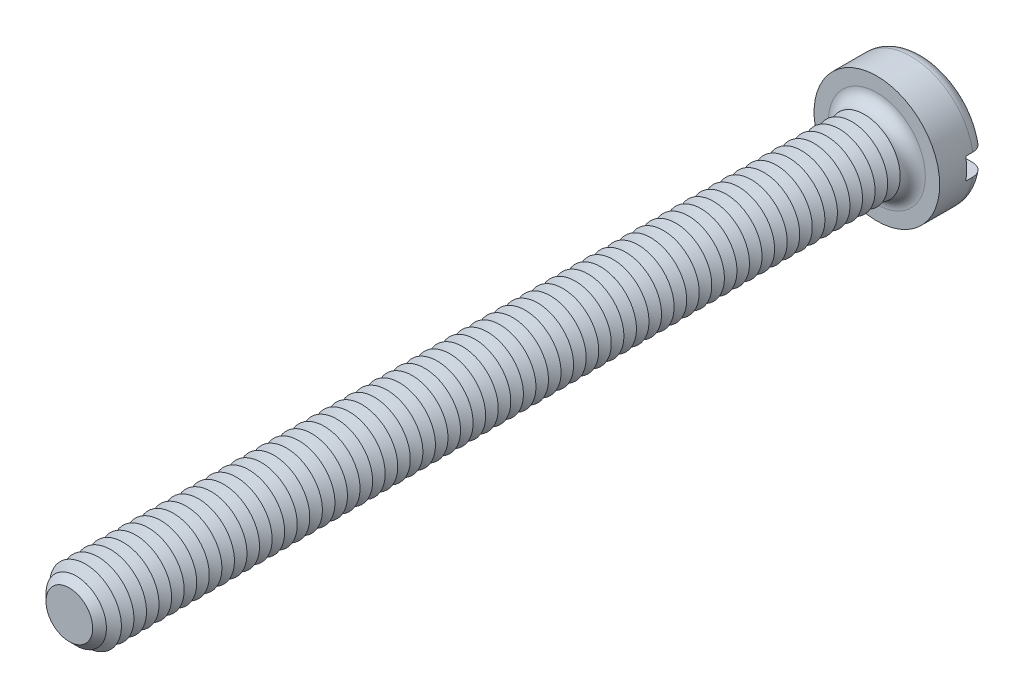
ISO-10303-21;
HEADER;
FILE_DESCRIPTION(('STEP AP214'),'2;1');
FILE_NAME('part.step','',(''),(''),'','','');
FILE_SCHEMA(('AUTOMOTIVE_DESIGN { 1 0 10303 214 1 1 1 1 }'));
ENDSEC;
DATA;
#1=APPLICATION_CONTEXT('core data for automotive mechanical design processes');
#2=APPLICATION_PROTOCOL_DEFINITION('international standard','automotive_design',2000,#1);
#3=PRODUCT_CONTEXT('',#1,'mechanical');
#4=PRODUCT('Part','Part','',(#3));
#5=PRODUCT_RELATED_PRODUCT_CATEGORY('part','',(#4));
#6=PRODUCT_DEFINITION_FORMATION('','',#4);
#7=PRODUCT_DEFINITION_CONTEXT('part definition',#1,'design');
#8=PRODUCT_DEFINITION('design','',#6,#7);
#9=PRODUCT_DEFINITION_SHAPE('','',#8);
#10=(LENGTH_UNIT() NAMED_UNIT(*) SI_UNIT(.MILLI.,.METRE.));
#11=(NAMED_UNIT(*) PLANE_ANGLE_UNIT() SI_UNIT($,.RADIAN.));
#12=(NAMED_UNIT(*) SI_UNIT($,.STERADIAN.) SOLID_ANGLE_UNIT());
#13=UNCERTAINTY_MEASURE_WITH_UNIT(LENGTH_MEASURE(1.E-05),#10,'distance_accuracy_value','');
#14=(GEOMETRIC_REPRESENTATION_CONTEXT(3) GLOBAL_UNCERTAINTY_ASSIGNED_CONTEXT((#13)) GLOBAL_UNIT_ASSIGNED_CONTEXT((#10,
#11,#12)) REPRESENTATION_CONTEXT('',''));
#15=CARTESIAN_POINT('',(0.,0.,0.));
#16=DIRECTION('',(0.,0.,1.));
#17=DIRECTION('',(1.,0.,0.));
#18=AXIS2_PLACEMENT_3D('',#15,#16,#17);
#19=CARTESIAN_POINT('',(0.,0.,-2.6));
#20=DIRECTION('',(0.,0.,1.));
#21=DIRECTION('',(1.,0.,0.));
#22=AXIS2_PLACEMENT_3D('',#19,#20,#21);
#23=PLANE('',#22);
#24=CARTESIAN_POINT('',(0.,0.,-2.6));
#25=DIRECTION('',(0.,0.,1.));
#26=DIRECTION('',(1.,0.,0.));
#27=AXIS2_PLACEMENT_3D('',#24,#25,#26);
#28=CIRCLE('',#27,2.8);
#29=CARTESIAN_POINT('',(-2.73495886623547,0.6,-2.6));
#30=VERTEX_POINT('',#29);
#31=CARTESIAN_POINT('',(2.73495886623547,0.6,-2.6));
#32=VERTEX_POINT('',#31);
#33=EDGE_CURVE('E116',#30,#32,#28,.F.);
#34=ORIENTED_EDGE('',*,*,#33,.T.);
#35=DIRECTION('',(1.,0.,0.));
#36=VECTOR('',#35,1.);
#37=CARTESIAN_POINT('',(-3.5,0.600000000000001,-2.6));
#38=LINE('',#37,#36);
#39=EDGE_CURVE('E111',#30,#32,#38,.T.);
#40=ORIENTED_EDGE('',*,*,#39,.F.);
#41=EDGE_LOOP('',(#34,#40));
#42=FACE_BOUND('',#41,.T.);
#43=ADVANCED_FACE('F39',(#42),#23,.F.);
#44=CARTESIAN_POINT('',(0.,0.,-1.9));
#45=DIRECTION('',(0.,0.,1.));
#46=DIRECTION('',(1.,0.,0.));
#47=AXIS2_PLACEMENT_3D('',#44,#45,#46);
#48=TOROIDAL_SURFACE('',#47,2.8,0.7);
#49=CARTESIAN_POINT('',(-3.24550494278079,0.600000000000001,-2.38938679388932));
#50=CARTESIAN_POINT('',(-3.21724139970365,0.600000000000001,-2.41780774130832));
#51=CARTESIAN_POINT('',(-3.18652103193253,0.600000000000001,-2.44383169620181));
#52=CARTESIAN_POINT('',(-3.12110229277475,0.600000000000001,-2.49034599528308));
#53=CARTESIAN_POINT('',(-3.08639834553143,0.6,-2.51082844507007));
#54=CARTESIAN_POINT('',(-3.01410013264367,0.6,-2.54568075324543));
#55=CARTESIAN_POINT('',(-2.97650963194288,0.6,-2.56005841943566));
#56=CARTESIAN_POINT('',(-2.89948250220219,0.6,-2.58239238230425));
#57=CARTESIAN_POINT('',(-2.86004633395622,0.6,-2.59035027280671));
#58=CARTESIAN_POINT('',(-2.77983715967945,0.6,-2.5997577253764));
#59=CARTESIAN_POINT('',(-2.73905311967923,0.6,-2.60111317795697));
#60=CARTESIAN_POINT('',(-2.65781876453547,0.6,-2.59706866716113));
#61=CARTESIAN_POINT('',(-2.61736849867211,0.6,-2.59166772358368));
#62=CARTESIAN_POINT('',(-2.53729983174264,0.6,-2.57414594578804));
#63=CARTESIAN_POINT('',(-2.49770360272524,0.6,-2.56192363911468));
#64=CARTESIAN_POINT('',(-2.421111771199,0.6,-2.5310238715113));
#65=CARTESIAN_POINT('',(-2.38411632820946,0.6,-2.51234601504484));
#66=CARTESIAN_POINT('',(-2.31371213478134,0.6,-2.46896762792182));
#67=CARTESIAN_POINT('',(-2.28031240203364,0.6,-2.44425244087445));
#68=CARTESIAN_POINT('',(-2.21823311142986,0.6,-2.38946667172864));
#69=CARTESIAN_POINT('',(-2.18955321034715,0.6,-2.35939647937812));
#70=CARTESIAN_POINT('',(-2.13836074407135,0.6,-2.29532787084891));
#71=CARTESIAN_POINT('',(-2.11574147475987,0.6,-2.26141482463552));
#72=CARTESIAN_POINT('',(-2.07677080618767,0.6,-2.19015935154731));
#73=CARTESIAN_POINT('',(-2.06041784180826,0.6,-2.15281778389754));
#74=CARTESIAN_POINT('',(-2.03508596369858,0.6,-2.07723332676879));
#75=CARTESIAN_POINT('',(-2.02585871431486,0.6,-2.03907365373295));
#76=CARTESIAN_POINT('',(-2.01416722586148,0.6,-1.96173417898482));
#77=CARTESIAN_POINT('',(-2.01170151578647,0.6,-1.92255460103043));
#78=CARTESIAN_POINT('',(-2.01359934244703,0.6,-1.84555709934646));
#79=CARTESIAN_POINT('',(-2.01775787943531,0.6,-1.80773393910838));
#80=CARTESIAN_POINT('',(-2.03236373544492,0.6,-1.73332511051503));
#81=CARTESIAN_POINT('',(-2.04281097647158,0.6,-1.69673942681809));
#82=CARTESIAN_POINT('',(-2.06962963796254,0.6,-1.62577336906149));
#83=CARTESIAN_POINT('',(-2.08600685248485,0.6,-1.59139519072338));
#84=CARTESIAN_POINT('',(-2.12413495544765,0.6,-1.52576356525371));
#85=CARTESIAN_POINT('',(-2.14588657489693,0.6,-1.49451054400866));
#86=CARTESIAN_POINT('',(-2.19483541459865,0.6,-1.43498643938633));
#87=CARTESIAN_POINT('',(-2.22217844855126,0.6,-1.40683532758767));
#88=CARTESIAN_POINT('',(-2.28105616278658,0.6,-1.35532544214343));
#89=CARTESIAN_POINT('',(-2.3125916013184,0.6,-1.33196753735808));
#90=CARTESIAN_POINT('',(-2.38018779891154,0.6,-1.28984356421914));
#91=CARTESIAN_POINT('',(-2.41637068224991,0.6,-1.27127330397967));
#92=CARTESIAN_POINT('',(-2.49129688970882,0.6,-1.24032971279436));
#93=CARTESIAN_POINT('',(-2.53004053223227,0.6,-1.22795715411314));
#94=CARTESIAN_POINT('',(-2.6098393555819,0.6,-1.2095515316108));
#95=CARTESIAN_POINT('',(-2.65092550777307,0.6,-1.20365237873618));
#96=CARTESIAN_POINT('',(-2.7335069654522,0.6,-1.1988380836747));
#97=CARTESIAN_POINT('',(-2.7750022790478,0.6,-1.19992308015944));
#98=CARTESIAN_POINT('',(-2.85718851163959,0.6,-1.20909046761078));
#99=CARTESIAN_POINT('',(-2.8978799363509,0.6,-1.21716830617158));
#100=CARTESIAN_POINT('',(-2.97729176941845,0.6,-1.24014327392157));
#101=CARTESIAN_POINT('',(-3.01601231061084,0.6,-1.25503994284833));
#102=CARTESIAN_POINT('',(-3.08976822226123,0.6,-1.29101066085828));
#103=CARTESIAN_POINT('',(-3.12484927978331,0.600000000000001,-1.31199098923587));
#104=CARTESIAN_POINT('',(-3.19090022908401,0.600000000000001,-1.35965144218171));
#105=CARTESIAN_POINT('',(-3.22187053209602,0.600000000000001,-1.38633099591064));
#106=CARTESIAN_POINT('',(-3.2781946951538,0.600000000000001,-1.44408564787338));
#107=CARTESIAN_POINT('',(-3.3036441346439,0.600000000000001,-1.47506754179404));
#108=CARTESIAN_POINT('',(-3.34887649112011,0.600000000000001,-1.54092398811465));
#109=CARTESIAN_POINT('',(-3.36865993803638,0.600000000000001,-1.57579817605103));
#110=CARTESIAN_POINT('',(-3.40166738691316,0.600000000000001,-1.64783067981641));
#111=CARTESIAN_POINT('',(-3.41499360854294,0.600000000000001,-1.68494217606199));
#112=CARTESIAN_POINT('',(-3.43515375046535,0.600000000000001,-1.76088675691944));
#113=CARTESIAN_POINT('',(-3.44198836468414,0.600000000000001,-1.79971965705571));
#114=CARTESIAN_POINT('',(-3.44891916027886,0.600000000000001,-1.87757893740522));
#115=CARTESIAN_POINT('',(-3.44908375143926,0.600000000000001,-1.91659924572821));
#116=CARTESIAN_POINT('',(-3.44284111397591,0.600000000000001,-1.99412088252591));
#117=CARTESIAN_POINT('',(-3.43643236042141,0.600000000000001,-2.03262208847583));
#118=CARTESIAN_POINT('',(-3.41725803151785,0.600000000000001,-2.10792315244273));
#119=CARTESIAN_POINT('',(-3.40450469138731,0.600000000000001,-2.14472613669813));
#120=CARTESIAN_POINT('',(-3.3730385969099,0.600000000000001,-2.21565060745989));
#121=CARTESIAN_POINT('',(-3.35433321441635,0.600000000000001,-2.24977534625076));
#122=CARTESIAN_POINT('',(-3.3201892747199,0.600000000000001,-2.30136364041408));
#123=CARTESIAN_POINT('',(-3.30647805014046,0.600000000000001,-2.31999402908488));
#124=CARTESIAN_POINT('',(-3.27728518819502,0.600000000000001,-2.35581090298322));
#125=CARTESIAN_POINT('',(-3.26180356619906,0.600000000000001,-2.37299740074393));
#126=CARTESIAN_POINT('',(-3.24550494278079,0.600000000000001,-2.38938679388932));
#127=B_SPLINE_CURVE_WITH_KNOTS('',3,(#49,#50,#51,#52,#53,#54,#55,#56,#57,#58,#59,#60,#61,#62,
#63,#64,#65,#66,#67,#68,#69,#70,#71,#72,#73,#74,#75,#76,#77,#78,#79,#80,#81,#82,#83,#84,#85,#86,
#87,#88,#89,#90,#91,#92,#93,#94,#95,#96,#97,#98,#99,#100,#101,#102,#103,#104,#105,#106,#107,
#108,#109,#110,#111,#112,#113,#114,#115,#116,#117,#118,#119,#120,#121,#122,#123,#124,#125,#126),
.UNSPECIFIED.,.T.,.F.,(4,2,2,2,2,2,2,2,2,2,2,2,2,2,2,2,2,2,2,2,2,2,2,2,2,2,2,2,2,2,2,2,2,2,2,2,
2,2,4),(0.,0.120160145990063,0.240490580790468,0.36066665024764,0.480812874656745,
0.602666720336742,0.724538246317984,0.848272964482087,0.972015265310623,1.09606100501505,
1.2200977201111,1.34178071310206,1.46343329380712,1.58062647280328,1.6977941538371,
1.81140573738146,1.92501591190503,2.03873739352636,2.15247435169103,2.26967910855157,
2.38690509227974,2.50835551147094,2.62982106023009,2.75375450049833,2.87769040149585,
3.00154567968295,3.12539259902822,3.24742469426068,3.36944457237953,3.48914477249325,
3.60883377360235,3.72656056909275,3.84427477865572,3.96078136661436,4.07731498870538,
4.19362474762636,4.3097910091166,4.37908387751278,4.44837614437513),.UNSPECIFIED.);
#128=CARTESIAN_POINT('',(-3.44818792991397,0.600000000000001,-1.8999999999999));
#129=VERTEX_POINT('',#128);
#130=EDGE_CURVE('E689',#129,#30,#127,.T.);
#131=ORIENTED_EDGE('',*,*,#130,.F.);
#132=CARTESIAN_POINT('',(0.,0.,-1.9));
#133=DIRECTION('',(0.,0.,1.));
#134=DIRECTION('',(1.,0.,0.));
#135=AXIS2_PLACEMENT_3D('',#132,#133,#134);
#136=CIRCLE('',#135,3.5);
#137=CARTESIAN_POINT('',(3.44818792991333,0.6,-1.9));
#138=VERTEX_POINT('',#137);
#139=EDGE_CURVE('E125',#138,#129,#136,.T.);
#140=ORIENTED_EDGE('',*,*,#139,.F.);
#141=CARTESIAN_POINT('',(2.1414268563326,0.6,-2.29762171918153));
#142=CARTESIAN_POINT('',(2.16505443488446,0.6,-2.33058245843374));
#143=CARTESIAN_POINT('',(2.19155609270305,0.6,-2.36152717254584));
#144=CARTESIAN_POINT('',(2.24942944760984,0.6,-2.41852964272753));
#145=CARTESIAN_POINT('',(2.28080921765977,0.6,-2.44457913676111));
#146=CARTESIAN_POINT('',(2.34741203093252,0.6,-2.49105381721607));
#147=CARTESIAN_POINT('',(2.38262862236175,0.6,-2.51148824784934));
#148=CARTESIAN_POINT('',(2.45593176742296,0.6,-2.54626881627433));
#149=CARTESIAN_POINT('',(2.49401741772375,0.6,-2.56061686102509));
#150=CARTESIAN_POINT('',(2.57272605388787,0.6,-2.58306429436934));
#151=CARTESIAN_POINT('',(2.6133821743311,0.6,-2.59104769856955));
#152=CARTESIAN_POINT('',(2.6954618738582,0.6,-2.60009608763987));
#153=CARTESIAN_POINT('',(2.73688552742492,0.6,-2.60116039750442));
#154=CARTESIAN_POINT('',(2.81941950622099,0.6,-2.5962925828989));
#155=CARTESIAN_POINT('',(2.86052888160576,0.6,-2.59034422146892));
#156=CARTESIAN_POINT('',(2.94113709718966,0.6,-2.57153687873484));
#157=CARTESIAN_POINT('',(2.98063603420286,0.6,-2.55867831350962));
#158=CARTESIAN_POINT('',(3.05633735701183,0.6,-2.52657771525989));
#159=CARTESIAN_POINT('',(3.09257627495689,0.6,-2.50742188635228));
#160=CARTESIAN_POINT('',(3.16123898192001,0.6,-2.46318606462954));
#161=CARTESIAN_POINT('',(3.19366316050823,0.6,-2.4381066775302));
#162=CARTESIAN_POINT('',(3.25312278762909,0.6,-2.38324481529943));
#163=CARTESIAN_POINT('',(3.28024842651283,0.6,-2.35356008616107));
#164=CARTESIAN_POINT('',(3.32902587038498,0.6,-2.28998971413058));
#165=CARTESIAN_POINT('',(3.35067820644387,0.6,-2.25610447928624));
#166=CARTESIAN_POINT('',(3.38751207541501,0.6,-2.18572286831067));
#167=CARTESIAN_POINT('',(3.40279804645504,0.6,-2.14928112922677));
#168=CARTESIAN_POINT('',(3.42695590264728,0.6,-2.07433042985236));
#169=CARTESIAN_POINT('',(3.43582824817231,0.6,-2.03582161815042));
#170=CARTESIAN_POINT('',(3.44682113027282,0.6,-1.95829536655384));
#171=CARTESIAN_POINT('',(3.44901648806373,0.6,-1.91928851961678));
#172=CARTESIAN_POINT('',(3.44680085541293,0.6,-1.84146366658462));
#173=CARTESIAN_POINT('',(3.44239008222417,0.6,-1.80264565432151));
#174=CARTESIAN_POINT('',(3.42712544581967,0.6,-1.72644634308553));
#175=CARTESIAN_POINT('',(3.41629508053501,0.6,-1.6890603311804));
#176=CARTESIAN_POINT('',(3.38853757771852,0.6,-1.61662604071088));
#177=CARTESIAN_POINT('',(3.37161039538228,0.6,-1.58157777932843));
#178=CARTESIAN_POINT('',(3.33207798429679,0.6,-1.51464178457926));
#179=CARTESIAN_POINT('',(3.30944854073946,0.6,-1.48276835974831));
#180=CARTESIAN_POINT('',(3.2592165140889,0.6,-1.42321861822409));
#181=CARTESIAN_POINT('',(3.23161370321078,0.6,-1.3955424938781));
#182=CARTESIAN_POINT('',(3.17188519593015,0.6,-1.34481834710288));
#183=CARTESIAN_POINT('',(3.13971065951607,0.6,-1.32182785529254));
#184=CARTESIAN_POINT('',(3.07201123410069,0.6,-1.28147003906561));
#185=CARTESIAN_POINT('',(3.03648608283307,0.6,-1.26410315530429));
#186=CARTESIAN_POINT('',(2.962449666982,0.6,-1.2351645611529));
#187=CARTESIAN_POINT('',(2.92389781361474,0.6,-1.22369671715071));
#188=CARTESIAN_POINT('',(2.84543273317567,0.6,-1.20726565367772));
#189=CARTESIAN_POINT('',(2.80551936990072,0.6,-1.20230308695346));
#190=CARTESIAN_POINT('',(2.72467191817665,0.6,-1.1989357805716));
#191=CARTESIAN_POINT('',(2.68373266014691,0.6,-1.20065484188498));
#192=CARTESIAN_POINT('',(2.60270222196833,0.6,-1.21084560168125));
#193=CARTESIAN_POINT('',(2.56261112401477,0.6,-1.21931795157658));
#194=CARTESIAN_POINT('',(2.48385954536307,0.6,-1.24292934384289));
#195=CARTESIAN_POINT('',(2.44522508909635,0.6,-1.25815531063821));
#196=CARTESIAN_POINT('',(2.37106165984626,0.6,-1.29488663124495));
#197=CARTESIAN_POINT('',(2.33553282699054,0.6,-1.31639226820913));
#198=CARTESIAN_POINT('',(2.2686996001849,0.6,-1.36507949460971));
#199=CARTESIAN_POINT('',(2.23738745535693,0.6,-1.39225042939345));
#200=CARTESIAN_POINT('',(2.17990424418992,0.6,-1.45157941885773));
#201=CARTESIAN_POINT('',(2.15373259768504,0.6,-1.48373691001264));
#202=CARTESIAN_POINT('',(2.10799355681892,0.6,-1.551327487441));
#203=CARTESIAN_POINT('',(2.08828258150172,0.6,-1.58666329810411));
#204=CARTESIAN_POINT('',(2.05534440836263,0.6,-1.66023600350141));
#205=CARTESIAN_POINT('',(2.042115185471,0.6,-1.6984719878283));
#206=CARTESIAN_POINT('',(2.02303126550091,0.6,-1.77519783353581));
#207=CARTESIAN_POINT('',(2.01691541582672,0.6,-1.8136228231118));
#208=CARTESIAN_POINT('',(2.01140375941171,0.6,-1.89096056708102));
#209=CARTESIAN_POINT('',(2.01200856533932,0.6,-1.92987336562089));
#210=CARTESIAN_POINT('',(2.01981617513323,0.6,-2.006065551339));
#211=CARTESIAN_POINT('',(2.02685835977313,0.6,-2.04336165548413));
#212=CARTESIAN_POINT('',(2.0470502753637,0.6,-2.1162250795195));
#213=CARTESIAN_POINT('',(2.06019252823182,0.6,-2.15179445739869));
#214=CARTESIAN_POINT('',(2.08525738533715,0.6,-2.20558874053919));
#215=CARTESIAN_POINT('',(2.09529161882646,0.6,-2.22471751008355));
#216=CARTESIAN_POINT('',(2.11708813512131,0.6,-2.26196179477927));
#217=CARTESIAN_POINT('',(2.12885034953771,0.6,-2.28007734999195));
#218=CARTESIAN_POINT('',(2.1414268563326,0.6,-2.29762171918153));
#219=B_SPLINE_CURVE_WITH_KNOTS('',3,(#141,#142,#143,#144,#145,#146,#147,#148,#149,#150,#151,
#152,#153,#154,#155,#156,#157,#158,#159,#160,#161,#162,#163,#164,#165,#166,#167,#168,#169,#170,
#171,#172,#173,#174,#175,#176,#177,#178,#179,#180,#181,#182,#183,#184,#185,#186,#187,#188,#189,
#190,#191,#192,#193,#194,#195,#196,#197,#198,#199,#200,#201,#202,#203,#204,#205,#206,#207,#208,
#209,#210,#211,#212,#213,#214,#215,#216,#217,#218),.UNSPECIFIED.,.T.,.F.,(4,2,2,2,2,2,2,2,2,2,2,
2,2,2,2,2,2,2,2,2,2,2,2,2,2,2,2,2,2,2,2,2,2,2,2,2,2,2,4),(0.,0.121582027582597,
0.243367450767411,0.364951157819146,0.486496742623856,0.610209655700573,0.733934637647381,
0.857946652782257,0.981951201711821,1.1043243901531,1.22668507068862,1.34673532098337,
1.46677391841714,1.58475736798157,1.70273234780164,1.81938035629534,1.93602452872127,
2.05224435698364,2.168465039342,2.28518782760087,2.40191596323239,2.52000081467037,
2.63809491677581,2.75820270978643,2.87832255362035,3.00067856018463,3.1230463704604,
3.24703703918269,3.37103329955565,3.49479843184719,3.6185495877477,3.73932715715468,
3.86006696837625,3.9762182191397,4.09238005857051,4.2057203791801,4.31892212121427,
4.38364046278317,4.44835624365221),.UNSPECIFIED.);
#220=EDGE_CURVE('E691',#32,#138,#219,.T.);
#221=ORIENTED_EDGE('',*,*,#220,.F.);
#222=ORIENTED_EDGE('',*,*,#33,.F.);
#223=EDGE_LOOP('',(#131,#140,#221,#222));
#224=FACE_BOUND('',#223,.T.);
#225=ADVANCED_FACE('F673',(#224),#48,.T.);
#226=CARTESIAN_POINT('',(0.,0.,-2.6));
#227=DIRECTION('',(0.,0.,1.));
#228=DIRECTION('',(1.,0.,0.));
#229=AXIS2_PLACEMENT_3D('',#226,#227,#228);
#230=CYLINDRICAL_SURFACE('',#229,3.5);
#231=DIRECTION('',(0.,0.,1.));
#232=VECTOR('',#231,1.);
#233=CARTESIAN_POINT('',(3.44818792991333,0.6,-2.6));
#234=LINE('',#233,#232);
#235=CARTESIAN_POINT('',(3.44818792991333,0.6,-1.5));
#236=VERTEX_POINT('',#235);
#237=EDGE_CURVE('E705',#138,#236,#234,.T.);
#238=ORIENTED_EDGE('',*,*,#237,.F.);
#239=ORIENTED_EDGE('',*,*,#139,.T.);
#240=DIRECTION('',(0.,0.,1.));
#241=VECTOR('',#240,1.);
#242=CARTESIAN_POINT('',(-3.44818792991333,0.600000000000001,-2.6));
#243=LINE('',#242,#241);
#244=CARTESIAN_POINT('',(-3.44818792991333,0.600000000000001,-1.5));
#245=VERTEX_POINT('',#244);
#246=EDGE_CURVE('E63',#245,#129,#243,.F.);
#247=ORIENTED_EDGE('',*,*,#246,.F.);
#248=CARTESIAN_POINT('',(0.,0.,-1.5));
#249=DIRECTION('',(0.,0.,-1.));
#250=DIRECTION('',(-1.,0.,0.));
#251=AXIS2_PLACEMENT_3D('',#248,#249,#250);
#252=CIRCLE('',#251,3.5);
#253=CARTESIAN_POINT('',(-3.44818792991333,-0.599999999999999,-1.5));
#254=VERTEX_POINT('',#253);
#255=EDGE_CURVE('E43',#245,#254,#252,.F.);
#256=ORIENTED_EDGE('',*,*,#255,.T.);
#257=DIRECTION('',(0.,0.,1.));
#258=VECTOR('',#257,1.);
#259=CARTESIAN_POINT('',(-3.44818792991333,-0.599999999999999,-2.6));
#260=LINE('',#259,#258);
#261=CARTESIAN_POINT('',(-3.44818792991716,-0.599999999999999,-1.90000000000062));
#262=VERTEX_POINT('',#261);
#263=EDGE_CURVE('E702',#262,#254,#260,.T.);
#264=ORIENTED_EDGE('',*,*,#263,.F.);
#265=CARTESIAN_POINT('',(3.44818792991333,-0.6,-1.9));
#266=VERTEX_POINT('',#265);
#267=EDGE_CURVE('E127',#262,#266,#136,.T.);
#268=ORIENTED_EDGE('',*,*,#267,.T.);
#269=DIRECTION('',(0.,0.,1.));
#270=VECTOR('',#269,1.);
#271=CARTESIAN_POINT('',(3.44818792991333,-0.6,-2.6));
#272=LINE('',#271,#270);
#273=CARTESIAN_POINT('',(3.44818792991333,-0.6,-1.5));
#274=VERTEX_POINT('',#273);
#275=EDGE_CURVE('E55',#274,#266,#272,.F.);
#276=ORIENTED_EDGE('',*,*,#275,.F.);
#277=EDGE_CURVE('E11',#274,#236,#252,.F.);
#278=ORIENTED_EDGE('',*,*,#277,.T.);
#279=EDGE_LOOP('',(#238,#239,#247,#256,#264,#268,#276,#278));
#280=FACE_BOUND('',#279,.T.);
#281=CARTESIAN_POINT('',(0.,0.,0.));
#282=DIRECTION('',(0.,0.,1.));
#283=DIRECTION('',(1.,0.,0.));
#284=AXIS2_PLACEMENT_3D('',#281,#282,#283);
#285=CIRCLE('',#284,3.5);
#286=CARTESIAN_POINT('',(3.5,0.,0.));
#287=VERTEX_POINT('',#286);
#288=EDGE_CURVE('E708',#287,#287,#285,.T.);
#289=ORIENTED_EDGE('',*,*,#288,.F.);
#290=EDGE_LOOP('',(#289));
#291=FACE_BOUND('',#290,.T.);
#292=ADVANCED_FACE('F669',(#280,#291),#230,.T.);
#293=CARTESIAN_POINT('',(2.73495886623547,-0.6,-2.6));
#294=VERTEX_POINT('',#293);
#295=CARTESIAN_POINT('',(-2.73495886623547,-0.6,-2.6));
#296=VERTEX_POINT('',#295);
#297=EDGE_CURVE('E109',#294,#296,#28,.F.);
#298=ORIENTED_EDGE('',*,*,#297,.T.);
#299=DIRECTION('',(-1.,0.,0.));
#300=VECTOR('',#299,1.);
#301=CARTESIAN_POINT('',(-3.5,-0.599999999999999,-2.6));
#302=LINE('',#301,#300);
#303=EDGE_CURVE('E96',#294,#296,#302,.T.);
#304=ORIENTED_EDGE('',*,*,#303,.F.);
#305=EDGE_LOOP('',(#298,#304));
#306=FACE_BOUND('',#305,.T.);
#307=ADVANCED_FACE('F108',(#306),#23,.F.);
#308=CARTESIAN_POINT('',(0.,0.,0.));
#309=DIRECTION('',(0.,0.,1.));
#310=DIRECTION('',(1.,0.,0.));
#311=AXIS2_PLACEMENT_3D('',#308,#309,#310);
#312=PLANE('',#311);
#313=CARTESIAN_POINT('',(0.,0.,0.));
#314=DIRECTION('',(0.,0.,1.));
#315=DIRECTION('',(1.,0.,0.));
#316=AXIS2_PLACEMENT_3D('',#313,#314,#315);
#317=CIRCLE('',#316,2.7);
#318=CARTESIAN_POINT('',(2.7,0.,0.));
#319=VERTEX_POINT('',#318);
#320=EDGE_CURVE('E115',#319,#319,#317,.F.);
#321=ORIENTED_EDGE('',*,*,#320,.T.);
#322=EDGE_LOOP('',(#321));
#323=FACE_BOUND('',#322,.T.);
#324=ORIENTED_EDGE('',*,*,#288,.T.);
#325=EDGE_LOOP('',(#324));
#326=FACE_BOUND('',#325,.T.);
#327=ADVANCED_FACE('F668',(#323,#326),#312,.T.);
#328=CARTESIAN_POINT('',(-3.24550494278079,-0.599999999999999,-2.38938679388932));
#329=CARTESIAN_POINT('',(-3.27309693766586,-0.599999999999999,-2.36163611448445));
#330=CARTESIAN_POINT('',(-3.29838741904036,-0.599999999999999,-2.3315608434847));
#331=CARTESIAN_POINT('',(-3.34359429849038,-0.599999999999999,-2.26757659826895));
#332=CARTESIAN_POINT('',(-3.36350518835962,-0.599999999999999,-2.23366374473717));
#333=CARTESIAN_POINT('',(-3.39733065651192,-0.599999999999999,-2.16296274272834));
#334=CARTESIAN_POINT('',(-3.4112451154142,-0.599999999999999,-2.12617453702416));
#335=CARTESIAN_POINT('',(-3.43264462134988,-0.599999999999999,-2.05078178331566));
#336=CARTESIAN_POINT('',(-3.44013114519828,-0.599999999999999,-2.01217765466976));
#337=CARTESIAN_POINT('',(-3.44841975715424,-0.599999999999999,-1.9345391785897));
#338=CARTESIAN_POINT('',(-3.44926944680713,-0.599999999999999,-1.89550990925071));
#339=CARTESIAN_POINT('',(-3.44438358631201,-0.599999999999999,-1.81786552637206));
#340=CARTESIAN_POINT('',(-3.43864801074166,-0.599999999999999,-1.77925041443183));
#341=CARTESIAN_POINT('',(-3.42079221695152,-0.599999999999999,-1.70364264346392));
#342=CARTESIAN_POINT('',(-3.40869011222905,-0.599999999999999,-1.66664570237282));
#343=CARTESIAN_POINT('',(-3.37847692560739,-0.599999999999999,-1.59519424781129));
#344=CARTESIAN_POINT('',(-3.3603657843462,-0.599999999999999,-1.56073975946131));
#345=CARTESIAN_POINT('',(-3.31856549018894,-0.599999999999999,-1.4951524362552));
#346=CARTESIAN_POINT('',(-3.29484830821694,-0.599999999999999,-1.46403747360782));
#347=CARTESIAN_POINT('',(-3.24258489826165,-0.599999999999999,-1.40617131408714));
#348=CARTESIAN_POINT('',(-3.21403843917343,-0.599999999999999,-1.37942032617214));
#349=CARTESIAN_POINT('',(-3.15256084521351,-0.599999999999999,-1.33067963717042));
#350=CARTESIAN_POINT('',(-3.11958015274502,-0.599999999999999,-1.30875246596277));
#351=CARTESIAN_POINT('',(-3.0504559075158,-0.599999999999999,-1.27063718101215));
#352=CARTESIAN_POINT('',(-3.01431209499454,-0.6,-1.25444953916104));
#353=CARTESIAN_POINT('',(-2.93921710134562,-0.6,-1.22796796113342));
#354=CARTESIAN_POINT('',(-2.90022796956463,-0.6,-1.217781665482));
#355=CARTESIAN_POINT('',(-2.82110512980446,-0.6,-1.20396915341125));
#356=CARTESIAN_POINT('',(-2.7809713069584,-0.6,-1.2003435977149));
#357=CARTESIAN_POINT('',(-2.69990924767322,-0.6,-1.19969717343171));
#358=CARTESIAN_POINT('',(-2.65898001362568,-0.6,-1.20279937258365));
#359=CARTESIAN_POINT('',(-2.57819986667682,-0.6,-1.21574287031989));
#360=CARTESIAN_POINT('',(-2.53834905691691,-0.6,-1.22558481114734));
#361=CARTESIAN_POINT('',(-2.46035232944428,-0.6,-1.25189361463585));
#362=CARTESIAN_POINT('',(-2.42223314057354,-0.6,-1.2684398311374));
#363=CARTESIAN_POINT('',(-2.34932316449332,-0.6,-1.30771928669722));
#364=CARTESIAN_POINT('',(-2.31453248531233,-0.6,-1.33045272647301));
#365=CARTESIAN_POINT('',(-2.24945577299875,-0.6,-1.38141543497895));
#366=CARTESIAN_POINT('',(-2.21915255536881,-0.6,-1.40962272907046));
#367=CARTESIAN_POINT('',(-2.16386461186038,-0.6,-1.47084552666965));
#368=CARTESIAN_POINT('',(-2.13887916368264,-0.6,-1.50386037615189));
#369=CARTESIAN_POINT('',(-2.09568071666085,-0.6,-1.57285917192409));
#370=CARTESIAN_POINT('',(-2.07730739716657,-0.6,-1.60874263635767));
#371=CARTESIAN_POINT('',(-2.04712019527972,-0.6,-1.68316975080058));
#372=CARTESIAN_POINT('',(-2.03530452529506,-0.6,-1.72171267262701));
#373=CARTESIAN_POINT('',(-2.01901751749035,-0.6,-1.79878952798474));
#374=CARTESIAN_POINT('',(-2.01428434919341,-0.6,-1.8372682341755));
#375=CARTESIAN_POINT('',(-2.01150652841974,-0.6,-1.91446369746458));
#376=CARTESIAN_POINT('',(-2.01346084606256,-0.6,-1.95318041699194));
#377=CARTESIAN_POINT('',(-2.02386268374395,-0.6,-2.0288619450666));
#378=CARTESIAN_POINT('',(-2.03216724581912,-0.6,-2.06584654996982));
#379=CARTESIAN_POINT('',(-2.05479337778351,-0.6,-2.13792373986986));
#380=CARTESIAN_POINT('',(-2.06911522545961,-0.6,-2.1730162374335));
#381=CARTESIAN_POINT('',(-2.10349906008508,-0.6,-2.24081034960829));
#382=CARTESIAN_POINT('',(-2.12363007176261,-0.6,-2.27347689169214));
#383=CARTESIAN_POINT('',(-2.16891308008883,-0.6,-2.33511902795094));
#384=CARTESIAN_POINT('',(-2.19406590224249,-0.6,-2.36409401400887));
#385=CARTESIAN_POINT('',(-2.24962389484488,-0.6,-2.41861972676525));
#386=CARTESIAN_POINT('',(-2.28018314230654,-0.6,-2.44401345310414));
#387=CARTESIAN_POINT('',(-2.34501720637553,-0.6,-2.48950558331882));
#388=CARTESIAN_POINT('',(-2.37929266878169,-0.6,-2.50960306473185));
#389=CARTESIAN_POINT('',(-2.45179417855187,-0.6,-2.54458276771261));
#390=CARTESIAN_POINT('',(-2.49011248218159,-0.6,-2.55927401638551));
#391=CARTESIAN_POINT('',(-2.56865227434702,-0.6,-2.58211133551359));
#392=CARTESIAN_POINT('',(-2.60887386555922,-0.6,-2.59025705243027));
#393=CARTESIAN_POINT('',(-2.69064746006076,-0.6,-2.59982905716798));
#394=CARTESIAN_POINT('',(-2.73220999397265,-0.6,-2.60116580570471));
#395=CARTESIAN_POINT('',(-2.81497658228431,-0.6,-2.59679700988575));
#396=CARTESIAN_POINT('',(-2.85618055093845,-0.6,-2.59108982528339));
#397=CARTESIAN_POINT('',(-2.93677683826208,-0.6,-2.57279487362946));
#398=CARTESIAN_POINT('',(-2.97617834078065,-0.6,-2.56024753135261));
#399=CARTESIAN_POINT('',(-3.05222242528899,-0.6,-2.52860709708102));
#400=CARTESIAN_POINT('',(-3.08886850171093,-0.599999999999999,-2.50952247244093));
#401=CARTESIAN_POINT('',(-3.14562501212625,-0.599999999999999,-2.47340693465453));
#402=CARTESIAN_POINT('',(-3.16689358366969,-0.599999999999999,-2.45816337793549));
#403=CARTESIAN_POINT('',(-3.20761866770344,-0.599999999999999,-2.42542115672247));
#404=CARTESIAN_POINT('',(-3.22707520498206,-0.599999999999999,-2.40792252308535));
#405=CARTESIAN_POINT('',(-3.24550494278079,-0.599999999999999,-2.38938679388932));
#406=B_SPLINE_CURVE_WITH_KNOTS('',3,(#328,#329,#330,#331,#332,#333,#334,#335,#336,#337,#338,
#339,#340,#341,#342,#343,#344,#345,#346,#347,#348,#349,#350,#351,#352,#353,#354,#355,#356,#357,
#358,#359,#360,#361,#362,#363,#364,#365,#366,#367,#368,#369,#370,#371,#372,#373,#374,#375,#376,
#377,#378,#379,#380,#381,#382,#383,#384,#385,#386,#387,#388,#389,#390,#391,#392,#393,#394,#395,
#396,#397,#398,#399,#400,#401,#402,#403,#404,#405),.UNSPECIFIED.,.T.,.F.,(4,2,2,2,2,2,2,2,2,2,2,
2,2,2,2,2,2,2,2,2,2,2,2,2,2,2,2,2,2,2,2,2,2,2,2,2,2,2,4),(0.,0.117306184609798,
0.234732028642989,0.352160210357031,0.469561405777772,0.586119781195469,0.702678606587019,
0.818907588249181,0.935137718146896,1.05196174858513,1.1687913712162,1.2870562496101,
1.40533084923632,1.52566688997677,1.64601504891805,1.76858322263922,1.89116307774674,
2.01523830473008,2.13931755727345,2.26290863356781,2.38648291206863,2.50681878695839,
2.62712184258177,2.74285697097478,2.85857427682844,2.97176054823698,3.08495204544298,
3.19954814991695,3.31416310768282,3.43282436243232,3.55150627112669,3.67404987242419,
3.79660009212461,3.92075778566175,4.04494439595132,4.16840490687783,4.29170610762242,
4.3700604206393,4.44841366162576),.UNSPECIFIED.);
#407=EDGE_CURVE('E103',#296,#262,#406,.T.);
#408=ORIENTED_EDGE('',*,*,#407,.F.);
#409=ORIENTED_EDGE('',*,*,#297,.F.);
#410=CARTESIAN_POINT('',(2.1414268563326,-0.6,-2.29762171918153));
#411=CARTESIAN_POINT('',(2.11900044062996,-0.6,-2.26633119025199));
#412=CARTESIAN_POINT('',(2.09913154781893,-0.6,-2.23318080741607));
#413=CARTESIAN_POINT('',(2.06517900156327,-0.6,-2.16401111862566));
#414=CARTESIAN_POINT('',(2.05109968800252,-0.6,-2.12798968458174));
#415=CARTESIAN_POINT('',(2.02923593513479,-0.6,-2.05404277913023));
#416=CARTESIAN_POINT('',(2.02145692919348,-0.6,-2.01611569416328));
#417=CARTESIAN_POINT('',(2.01251710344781,-0.6,-1.93949649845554));
#418=CARTESIAN_POINT('',(2.01135461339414,-0.6,-1.90080458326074));
#419=CARTESIAN_POINT('',(2.01564803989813,-0.6,-1.82450508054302));
#420=CARTESIAN_POINT('',(2.02098305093,-0.6,-1.78689061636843));
#421=CARTESIAN_POINT('',(2.03786826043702,-0.6,-1.71308589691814));
#422=CARTESIAN_POINT('',(2.04941870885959,-0.6,-1.67689569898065));
#423=CARTESIAN_POINT('',(2.07838664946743,-0.6,-1.60676639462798));
#424=CARTESIAN_POINT('',(2.09582944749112,-0.6,-1.57283776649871));
#425=CARTESIAN_POINT('',(2.1359925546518,-0.6,-1.50826612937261));
#426=CARTESIAN_POINT('',(2.15871360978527,-0.6,-1.47762358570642));
#427=CARTESIAN_POINT('',(2.20955413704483,-0.6,-1.41943384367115));
#428=CARTESIAN_POINT('',(2.23782364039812,-0.6,-1.39201777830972));
#429=CARTESIAN_POINT('',(2.29842612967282,-0.6,-1.34212199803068));
#430=CARTESIAN_POINT('',(2.33075984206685,-0.6,-1.31964316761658));
#431=CARTESIAN_POINT('',(2.399806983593,-0.6,-1.27945238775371));
#432=CARTESIAN_POINT('',(2.43663466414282,-0.6,-1.26193653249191));
#433=CARTESIAN_POINT('',(2.51267241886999,-0.6,-1.23320660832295));
#434=CARTESIAN_POINT('',(2.55188277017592,-0.6,-1.22199327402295));
#435=CARTESIAN_POINT('',(2.63235000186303,-0.6,-1.20602688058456));
#436=CARTESIAN_POINT('',(2.673631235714,-0.6,-1.20139617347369));
#437=CARTESIAN_POINT('',(2.7563863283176,-0.6,-1.19914622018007));
#438=CARTESIAN_POINT('',(2.79786018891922,-0.6,-1.20152704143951));
#439=CARTESIAN_POINT('',(2.87971192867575,-0.6,-1.21326884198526));
#440=CARTESIAN_POINT('',(2.92009214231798,-0.6,-1.22261349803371));
#441=CARTESIAN_POINT('',(2.99866777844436,-0.6,-1.24805614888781));
#442=CARTESIAN_POINT('',(3.03686335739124,-0.6,-1.26415365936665));
#443=CARTESIAN_POINT('',(3.10934738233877,-0.6,-1.3023912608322));
#444=CARTESIAN_POINT('',(3.14368704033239,-0.6,-1.32443423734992));
#445=CARTESIAN_POINT('',(3.20808395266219,-0.6,-1.37407725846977));
#446=CARTESIAN_POINT('',(3.23814164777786,-0.6,-1.40167673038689));
#447=CARTESIAN_POINT('',(3.29251534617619,-0.6,-1.46108303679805));
#448=CARTESIAN_POINT('',(3.3169296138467,-0.6,-1.49279994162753));
#449=CARTESIAN_POINT('',(3.35998418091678,-0.6,-1.55993706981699));
#450=CARTESIAN_POINT('',(3.37862502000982,-0.6,-1.59535694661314));
#451=CARTESIAN_POINT('',(3.40930212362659,-0.6,-1.668283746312));
#452=CARTESIAN_POINT('',(3.42143897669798,-0.6,-1.70574837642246));
#453=CARTESIAN_POINT('',(3.43918305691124,-0.6,-1.78219297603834));
#454=CARTESIAN_POINT('',(3.44479069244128,-0.6,-1.82117285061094));
#455=CARTESIAN_POINT('',(3.44928173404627,-0.6,-1.89914596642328));
#456=CARTESIAN_POINT('',(3.44822835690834,-0.6,-1.93813558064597));
#457=CARTESIAN_POINT('',(3.43957811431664,-0.6,-2.0153811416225));
#458=CARTESIAN_POINT('',(3.43198139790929,-0.6,-2.05363710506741));
#459=CARTESIAN_POINT('',(3.41049386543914,-0.6,-2.12826741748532));
#460=CARTESIAN_POINT('',(3.39661362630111,-0.6,-2.16464481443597));
#461=CARTESIAN_POINT('',(3.36297924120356,-0.6,-2.23457274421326));
#462=CARTESIAN_POINT('',(3.34322499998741,-0.6,-2.26812323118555));
#463=CARTESIAN_POINT('',(3.29828706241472,-0.6,-2.33167864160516));
#464=CARTESIAN_POINT('',(3.27307040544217,-0.6,-2.36166024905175));
#465=CARTESIAN_POINT('',(3.21802069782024,-0.6,-2.41703165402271));
#466=CARTESIAN_POINT('',(3.18818738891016,-0.6,-2.44242119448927));
#467=CARTESIAN_POINT('',(3.12433871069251,-0.6,-2.48825551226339));
#468=CARTESIAN_POINT('',(3.09027338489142,-0.6,-2.50863067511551));
#469=CARTESIAN_POINT('',(3.01925175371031,-0.6,-2.54348754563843));
#470=CARTESIAN_POINT('',(2.982295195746,-0.6,-2.55796873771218));
#471=CARTESIAN_POINT('',(2.90583499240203,-0.6,-2.58090526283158));
#472=CARTESIAN_POINT('',(2.86629758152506,-0.6,-2.58924801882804));
#473=CARTESIAN_POINT('',(2.78639041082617,-0.6,-2.59930573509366));
#474=CARTESIAN_POINT('',(2.7460205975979,-0.6,-2.60102026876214));
#475=CARTESIAN_POINT('',(2.66482039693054,-0.6,-2.59779078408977));
#476=CARTESIAN_POINT('',(2.62399477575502,-0.6,-2.59272651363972));
#477=CARTESIAN_POINT('',(2.54373809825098,-0.6,-2.57588976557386));
#478=CARTESIAN_POINT('',(2.50430750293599,-0.6,-2.56411509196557));
#479=CARTESIAN_POINT('',(2.42753167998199,-0.6,-2.53401488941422));
#480=CARTESIAN_POINT('',(2.39021407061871,-0.6,-2.51561892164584));
#481=CARTESIAN_POINT('',(2.31925431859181,-0.6,-2.4727929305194));
#482=CARTESIAN_POINT('',(2.28560806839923,-0.6,-2.44836975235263));
#483=CARTESIAN_POINT('',(2.23316677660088,-0.6,-2.40295212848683));
#484=CARTESIAN_POINT('',(2.21309339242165,-0.6,-2.38341311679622));
#485=CARTESIAN_POINT('',(2.17537212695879,-0.6,-2.34211733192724));
#486=CARTESIAN_POINT('',(2.1577241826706,-0.6,-2.32036061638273));
#487=CARTESIAN_POINT('',(2.1414268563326,-0.6,-2.29762171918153));
#488=B_SPLINE_CURVE_WITH_KNOTS('',3,(#410,#411,#412,#413,#414,#415,#416,#417,#418,#419,#420,
#421,#422,#423,#424,#425,#426,#427,#428,#429,#430,#431,#432,#433,#434,#435,#436,#437,#438,#439,
#440,#441,#442,#443,#444,#445,#446,#447,#448,#449,#450,#451,#452,#453,#454,#455,#456,#457,#458,
#459,#460,#461,#462,#463,#464,#465,#466,#467,#468,#469,#470,#471,#472,#473,#474,#475,#476,#477,
#478,#479,#480,#481,#482,#483,#484,#485,#486,#487),.UNSPECIFIED.,.T.,.F.,(4,2,2,2,2,2,2,2,2,2,2,
2,2,2,2,2,2,2,2,2,2,2,2,2,2,2,2,2,2,2,2,2,2,2,2,2,2,2,4),(0.,0.115394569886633,
0.230875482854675,0.346455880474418,0.462007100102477,0.575440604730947,0.688878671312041,
0.802810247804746,0.91675793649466,1.03436780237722,1.15199872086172,1.27377854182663,
1.39557255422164,1.51960202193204,1.64363268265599,1.76737352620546,1.89110549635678,
2.01292743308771,2.13473682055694,2.25423121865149,2.37371444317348,2.49129215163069,
2.60886250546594,2.72531873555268,2.8417723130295,2.95803059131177,3.07429075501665,
3.19127301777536,3.30826182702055,3.42679321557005,3.54533497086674,3.66599996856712,
3.78667273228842,3.90951478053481,4.03239705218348,4.15662720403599,4.28071691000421,
4.36457658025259,4.44843407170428),.UNSPECIFIED.);
#489=EDGE_CURVE('E92',#266,#294,#488,.T.);
#490=ORIENTED_EDGE('',*,*,#489,.F.);
#491=ORIENTED_EDGE('',*,*,#267,.F.);
#492=EDGE_LOOP('',(#408,#409,#490,#491));
#493=FACE_BOUND('',#492,.T.);
#494=ADVANCED_FACE('F113',(#493),#48,.T.);
#495=CARTESIAN_POINT('',(0.,0.,0.699999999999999));
#496=DIRECTION('',(0.,0.,1.));
#497=DIRECTION('',(1.,0.,0.));
#498=AXIS2_PLACEMENT_3D('',#495,#496,#497);
#499=TOROIDAL_SURFACE('',#498,2.7,0.7);
#500=ORIENTED_EDGE('',*,*,#320,.F.);
#501=EDGE_LOOP('',(#500));
#502=FACE_BOUND('',#501,.T.);
#503=CARTESIAN_POINT('',(0.,0.,0.699999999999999));
#504=DIRECTION('',(0.,0.,-1.));
#505=DIRECTION('',(-1.,0.,0.));
#506=AXIS2_PLACEMENT_3D('',#503,#504,#505);
#507=CIRCLE('',#506,2.);
#508=CARTESIAN_POINT('',(-2.,0.,0.699999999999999));
#509=VERTEX_POINT('',#508);
#510=EDGE_CURVE('E713',#509,#509,#507,.T.);
#511=ORIENTED_EDGE('',*,*,#510,.T.);
#512=EDGE_LOOP('',(#511));
#513=FACE_BOUND('',#512,.T.);
#514=ADVANCED_FACE('F661',(#502,#513),#499,.F.);
#515=CARTESIAN_POINT('',(0.,0.,1.05));
#516=DIRECTION('',(0.,0.,-1.));
#517=DIRECTION('',(-1.,0.,0.));
#518=AXIS2_PLACEMENT_3D('',#515,#516,#517);
#519=CONICAL_SURFACE('',#518,1.39378221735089,1.0471975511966);
#520=ORIENTED_EDGE('',*,*,#510,.F.);
#521=EDGE_LOOP('',(#520));
#522=FACE_BOUND('',#521,.T.);
#523=CARTESIAN_POINT('',(0.,0.,1.05));
#524=DIRECTION('',(0.,0.,-1.));
#525=DIRECTION('',(-1.,0.,0.));
#526=AXIS2_PLACEMENT_3D('',#523,#524,#525);
#527=CIRCLE('',#526,1.39378221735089);
#528=CARTESIAN_POINT('',(-1.39378221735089,0.,1.05));
#529=VERTEX_POINT('',#528);
#530=EDGE_CURVE('E719',#529,#529,#527,.T.);
#531=ORIENTED_EDGE('',*,*,#530,.T.);
#532=EDGE_LOOP('',(#531));
#533=FACE_BOUND('',#532,.T.);
#534=ADVANCED_FACE('F657',(#522,#533),#519,.T.);
#535=CARTESIAN_POINT('',(0.,0.,1.4));
#536=DIRECTION('',(0.,0.,1.));
#537=DIRECTION('',(1.,0.,0.));
#538=AXIS2_PLACEMENT_3D('',#535,#536,#537);
#539=CONICAL_SURFACE('',#538,2.,1.0471975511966);
#540=ORIENTED_EDGE('',*,*,#530,.F.);
#541=EDGE_LOOP('',(#540));
#542=FACE_BOUND('',#541,.T.);
#543=CARTESIAN_POINT('',(0.,0.,1.4));
#544=DIRECTION('',(0.,0.,-1.));
#545=DIRECTION('',(-1.,0.,0.));
#546=AXIS2_PLACEMENT_3D('',#543,#544,#545);
#547=CIRCLE('',#546,2.);
#548=CARTESIAN_POINT('',(-2.,0.,1.4));
#549=VERTEX_POINT('',#548);
#550=EDGE_CURVE('E724',#549,#549,#547,.T.);
#551=ORIENTED_EDGE('',*,*,#550,.T.);
#552=EDGE_LOOP('',(#551));
#553=FACE_BOUND('',#552,.T.);
#554=ADVANCED_FACE('F653',(#542,#553),#539,.T.);
#555=CARTESIAN_POINT('',(0.,0.,1.75));
#556=DIRECTION('',(0.,0.,-1.));
#557=DIRECTION('',(-1.,0.,0.));
#558=AXIS2_PLACEMENT_3D('',#555,#556,#557);
#559=CONICAL_SURFACE('',#558,1.39378221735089,1.0471975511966);
#560=ORIENTED_EDGE('',*,*,#550,.F.);
#561=EDGE_LOOP('',(#560));
#562=FACE_BOUND('',#561,.T.);
#563=CARTESIAN_POINT('',(0.,0.,1.75));
#564=DIRECTION('',(0.,0.,-1.));
#565=DIRECTION('',(-1.,0.,0.));
#566=AXIS2_PLACEMENT_3D('',#563,#564,#565);
#567=CIRCLE('',#566,1.39378221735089);
#568=CARTESIAN_POINT('',(-1.39378221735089,0.,1.75));
#569=VERTEX_POINT('',#568);
#570=EDGE_CURVE('E727',#569,#569,#567,.T.);
#571=ORIENTED_EDGE('',*,*,#570,.T.);
#572=EDGE_LOOP('',(#571));
#573=FACE_BOUND('',#572,.T.);
#574=ADVANCED_FACE('F649',(#562,#573),#559,.T.);
#575=CARTESIAN_POINT('',(0.,0.,2.1));
#576=DIRECTION('',(0.,0.,1.));
#577=DIRECTION('',(1.,0.,0.));
#578=AXIS2_PLACEMENT_3D('',#575,#576,#577);
#579=CONICAL_SURFACE('',#578,2.,1.0471975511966);
#580=ORIENTED_EDGE('',*,*,#570,.F.);
#581=EDGE_LOOP('',(#580));
#582=FACE_BOUND('',#581,.T.);
#583=CARTESIAN_POINT('',(0.,0.,2.1));
#584=DIRECTION('',(0.,0.,-1.));
#585=DIRECTION('',(-1.,0.,0.));
#586=AXIS2_PLACEMENT_3D('',#583,#584,#585);
#587=CIRCLE('',#586,2.);
#588=CARTESIAN_POINT('',(-2.,0.,2.1));
#589=VERTEX_POINT('',#588);
#590=EDGE_CURVE('E731',#589,#589,#587,.T.);
#591=ORIENTED_EDGE('',*,*,#590,.T.);
#592=EDGE_LOOP('',(#591));
#593=FACE_BOUND('',#592,.T.);
#594=ADVANCED_FACE('F645',(#582,#593),#579,.T.);
#595=CARTESIAN_POINT('',(0.,0.,2.45));
#596=DIRECTION('',(0.,0.,-1.));
#597=DIRECTION('',(-1.,0.,0.));
#598=AXIS2_PLACEMENT_3D('',#595,#596,#597);
#599=CONICAL_SURFACE('',#598,1.39378221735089,1.0471975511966);
#600=ORIENTED_EDGE('',*,*,#590,.F.);
#601=EDGE_LOOP('',(#600));
#602=FACE_BOUND('',#601,.T.);
#603=CARTESIAN_POINT('',(0.,0.,2.45));
#604=DIRECTION('',(0.,0.,-1.));
#605=DIRECTION('',(-1.,0.,0.));
#606=AXIS2_PLACEMENT_3D('',#603,#604,#605);
#607=CIRCLE('',#606,1.39378221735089);
#608=CARTESIAN_POINT('',(-1.39378221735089,0.,2.45));
#609=VERTEX_POINT('',#608);
#610=EDGE_CURVE('E735',#609,#609,#607,.T.);
#611=ORIENTED_EDGE('',*,*,#610,.T.);
#612=EDGE_LOOP('',(#611));
#613=FACE_BOUND('',#612,.T.);
#614=ADVANCED_FACE('F641',(#602,#613),#599,.T.);
#615=CARTESIAN_POINT('',(0.,0.,2.8));
#616=DIRECTION('',(0.,0.,1.));
#617=DIRECTION('',(1.,0.,0.));
#618=AXIS2_PLACEMENT_3D('',#615,#616,#617);
#619=CONICAL_SURFACE('',#618,2.,1.0471975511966);
#620=ORIENTED_EDGE('',*,*,#610,.F.);
#621=EDGE_LOOP('',(#620));
#622=FACE_BOUND('',#621,.T.);
#623=CARTESIAN_POINT('',(0.,0.,2.8));
#624=DIRECTION('',(0.,0.,-1.));
#625=DIRECTION('',(-1.,0.,0.));
#626=AXIS2_PLACEMENT_3D('',#623,#624,#625);
#627=CIRCLE('',#626,2.);
#628=CARTESIAN_POINT('',(-2.,0.,2.8));
#629=VERTEX_POINT('',#628);
#630=EDGE_CURVE('E739',#629,#629,#627,.T.);
#631=ORIENTED_EDGE('',*,*,#630,.T.);
#632=EDGE_LOOP('',(#631));
#633=FACE_BOUND('',#632,.T.);
#634=ADVANCED_FACE('F637',(#622,#633),#619,.T.);
#635=CARTESIAN_POINT('',(0.,0.,3.15));
#636=DIRECTION('',(0.,0.,-1.));
#637=DIRECTION('',(-1.,0.,0.));
#638=AXIS2_PLACEMENT_3D('',#635,#636,#637);
#639=CONICAL_SURFACE('',#638,1.39378221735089,1.0471975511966);
#640=ORIENTED_EDGE('',*,*,#630,.F.);
#641=EDGE_LOOP('',(#640));
#642=FACE_BOUND('',#641,.T.);
#643=CARTESIAN_POINT('',(0.,0.,3.15));
#644=DIRECTION('',(0.,0.,-1.));
#645=DIRECTION('',(-1.,0.,0.));
#646=AXIS2_PLACEMENT_3D('',#643,#644,#645);
#647=CIRCLE('',#646,1.39378221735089);
#648=CARTESIAN_POINT('',(-1.39378221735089,0.,3.15));
#649=VERTEX_POINT('',#648);
#650=EDGE_CURVE('E743',#649,#649,#647,.T.);
#651=ORIENTED_EDGE('',*,*,#650,.T.);
#652=EDGE_LOOP('',(#651));
#653=FACE_BOUND('',#652,.T.);
#654=ADVANCED_FACE('F633',(#642,#653),#639,.T.);
#655=CARTESIAN_POINT('',(0.,0.,3.5));
#656=DIRECTION('',(0.,0.,1.));
#657=DIRECTION('',(1.,0.,0.));
#658=AXIS2_PLACEMENT_3D('',#655,#656,#657);
#659=CONICAL_SURFACE('',#658,2.,1.0471975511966);
#660=ORIENTED_EDGE('',*,*,#650,.F.);
#661=EDGE_LOOP('',(#660));
#662=FACE_BOUND('',#661,.T.);
#663=CARTESIAN_POINT('',(0.,0.,3.5));
#664=DIRECTION('',(0.,0.,-1.));
#665=DIRECTION('',(-1.,0.,0.));
#666=AXIS2_PLACEMENT_3D('',#663,#664,#665);
#667=CIRCLE('',#666,2.);
#668=CARTESIAN_POINT('',(-2.,0.,3.5));
#669=VERTEX_POINT('',#668);
#670=EDGE_CURVE('E747',#669,#669,#667,.T.);
#671=ORIENTED_EDGE('',*,*,#670,.T.);
#672=EDGE_LOOP('',(#671));
#673=FACE_BOUND('',#672,.T.);
#674=ADVANCED_FACE('F629',(#662,#673),#659,.T.);
#675=CARTESIAN_POINT('',(0.,0.,3.85));
#676=DIRECTION('',(0.,0.,-1.));
#677=DIRECTION('',(-1.,0.,0.));
#678=AXIS2_PLACEMENT_3D('',#675,#676,#677);
#679=CONICAL_SURFACE('',#678,1.39378221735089,1.0471975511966);
#680=ORIENTED_EDGE('',*,*,#670,.F.);
#681=EDGE_LOOP('',(#680));
#682=FACE_BOUND('',#681,.T.);
#683=CARTESIAN_POINT('',(0.,0.,3.85));
#684=DIRECTION('',(0.,0.,-1.));
#685=DIRECTION('',(-1.,0.,0.));
#686=AXIS2_PLACEMENT_3D('',#683,#684,#685);
#687=CIRCLE('',#686,1.39378221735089);
#688=CARTESIAN_POINT('',(-1.39378221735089,0.,3.85));
#689=VERTEX_POINT('',#688);
#690=EDGE_CURVE('E751',#689,#689,#687,.T.);
#691=ORIENTED_EDGE('',*,*,#690,.T.);
#692=EDGE_LOOP('',(#691));
#693=FACE_BOUND('',#692,.T.);
#694=ADVANCED_FACE('F625',(#682,#693),#679,.T.);
#695=CARTESIAN_POINT('',(0.,0.,4.2));
#696=DIRECTION('',(0.,0.,1.));
#697=DIRECTION('',(1.,0.,0.));
#698=AXIS2_PLACEMENT_3D('',#695,#696,#697);
#699=CONICAL_SURFACE('',#698,2.,1.0471975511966);
#700=ORIENTED_EDGE('',*,*,#690,.F.);
#701=EDGE_LOOP('',(#700));
#702=FACE_BOUND('',#701,.T.);
#703=CARTESIAN_POINT('',(0.,0.,4.2));
#704=DIRECTION('',(0.,0.,-1.));
#705=DIRECTION('',(-1.,0.,0.));
#706=AXIS2_PLACEMENT_3D('',#703,#704,#705);
#707=CIRCLE('',#706,2.);
#708=CARTESIAN_POINT('',(-2.,0.,4.2));
#709=VERTEX_POINT('',#708);
#710=EDGE_CURVE('E755',#709,#709,#707,.T.);
#711=ORIENTED_EDGE('',*,*,#710,.T.);
#712=EDGE_LOOP('',(#711));
#713=FACE_BOUND('',#712,.T.);
#714=ADVANCED_FACE('F621',(#702,#713),#699,.T.);
#715=CARTESIAN_POINT('',(0.,0.,4.55));
#716=DIRECTION('',(0.,0.,-1.));
#717=DIRECTION('',(-1.,0.,0.));
#718=AXIS2_PLACEMENT_3D('',#715,#716,#717);
#719=CONICAL_SURFACE('',#718,1.39378221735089,1.0471975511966);
#720=ORIENTED_EDGE('',*,*,#710,.F.);
#721=EDGE_LOOP('',(#720));
#722=FACE_BOUND('',#721,.T.);
#723=CARTESIAN_POINT('',(0.,0.,4.55));
#724=DIRECTION('',(0.,0.,-1.));
#725=DIRECTION('',(-1.,0.,0.));
#726=AXIS2_PLACEMENT_3D('',#723,#724,#725);
#727=CIRCLE('',#726,1.39378221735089);
#728=CARTESIAN_POINT('',(-1.39378221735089,0.,4.55));
#729=VERTEX_POINT('',#728);
#730=EDGE_CURVE('E759',#729,#729,#727,.T.);
#731=ORIENTED_EDGE('',*,*,#730,.T.);
#732=EDGE_LOOP('',(#731));
#733=FACE_BOUND('',#732,.T.);
#734=ADVANCED_FACE('F617',(#722,#733),#719,.T.);
#735=CARTESIAN_POINT('',(0.,0.,4.9));
#736=DIRECTION('',(0.,0.,1.));
#737=DIRECTION('',(1.,0.,0.));
#738=AXIS2_PLACEMENT_3D('',#735,#736,#737);
#739=CONICAL_SURFACE('',#738,2.,1.0471975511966);
#740=ORIENTED_EDGE('',*,*,#730,.F.);
#741=EDGE_LOOP('',(#740));
#742=FACE_BOUND('',#741,.T.);
#743=CARTESIAN_POINT('',(0.,0.,4.9));
#744=DIRECTION('',(0.,0.,-1.));
#745=DIRECTION('',(-1.,0.,0.));
#746=AXIS2_PLACEMENT_3D('',#743,#744,#745);
#747=CIRCLE('',#746,2.);
#748=CARTESIAN_POINT('',(-2.,0.,4.9));
#749=VERTEX_POINT('',#748);
#750=EDGE_CURVE('E763',#749,#749,#747,.T.);
#751=ORIENTED_EDGE('',*,*,#750,.T.);
#752=EDGE_LOOP('',(#751));
#753=FACE_BOUND('',#752,.T.);
#754=ADVANCED_FACE('F613',(#742,#753),#739,.T.);
#755=CARTESIAN_POINT('',(0.,0.,5.25));
#756=DIRECTION('',(0.,0.,-1.));
#757=DIRECTION('',(-1.,0.,0.));
#758=AXIS2_PLACEMENT_3D('',#755,#756,#757);
#759=CONICAL_SURFACE('',#758,1.39378221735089,1.0471975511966);
#760=ORIENTED_EDGE('',*,*,#750,.F.);
#761=EDGE_LOOP('',(#760));
#762=FACE_BOUND('',#761,.T.);
#763=CARTESIAN_POINT('',(0.,0.,5.25));
#764=DIRECTION('',(0.,0.,-1.));
#765=DIRECTION('',(-1.,0.,0.));
#766=AXIS2_PLACEMENT_3D('',#763,#764,#765);
#767=CIRCLE('',#766,1.39378221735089);
#768=CARTESIAN_POINT('',(-1.39378221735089,0.,5.25));
#769=VERTEX_POINT('',#768);
#770=EDGE_CURVE('E767',#769,#769,#767,.T.);
#771=ORIENTED_EDGE('',*,*,#770,.T.);
#772=EDGE_LOOP('',(#771));
#773=FACE_BOUND('',#772,.T.);
#774=ADVANCED_FACE('F609',(#762,#773),#759,.T.);
#775=CARTESIAN_POINT('',(0.,0.,5.6));
#776=DIRECTION('',(0.,0.,1.));
#777=DIRECTION('',(1.,0.,0.));
#778=AXIS2_PLACEMENT_3D('',#775,#776,#777);
#779=CONICAL_SURFACE('',#778,2.,1.0471975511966);
#780=ORIENTED_EDGE('',*,*,#770,.F.);
#781=EDGE_LOOP('',(#780));
#782=FACE_BOUND('',#781,.T.);
#783=CARTESIAN_POINT('',(0.,0.,5.6));
#784=DIRECTION('',(0.,0.,-1.));
#785=DIRECTION('',(-1.,0.,0.));
#786=AXIS2_PLACEMENT_3D('',#783,#784,#785);
#787=CIRCLE('',#786,2.);
#788=CARTESIAN_POINT('',(-2.,0.,5.6));
#789=VERTEX_POINT('',#788);
#790=EDGE_CURVE('E771',#789,#789,#787,.T.);
#791=ORIENTED_EDGE('',*,*,#790,.T.);
#792=EDGE_LOOP('',(#791));
#793=FACE_BOUND('',#792,.T.);
#794=ADVANCED_FACE('F605',(#782,#793),#779,.T.);
#795=CARTESIAN_POINT('',(0.,0.,5.95));
#796=DIRECTION('',(0.,0.,-1.));
#797=DIRECTION('',(-1.,0.,0.));
#798=AXIS2_PLACEMENT_3D('',#795,#796,#797);
#799=CONICAL_SURFACE('',#798,1.39378221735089,1.0471975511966);
#800=ORIENTED_EDGE('',*,*,#790,.F.);
#801=EDGE_LOOP('',(#800));
#802=FACE_BOUND('',#801,.T.);
#803=CARTESIAN_POINT('',(0.,0.,5.95));
#804=DIRECTION('',(0.,0.,-1.));
#805=DIRECTION('',(-1.,0.,0.));
#806=AXIS2_PLACEMENT_3D('',#803,#804,#805);
#807=CIRCLE('',#806,1.39378221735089);
#808=CARTESIAN_POINT('',(-1.39378221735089,0.,5.95));
#809=VERTEX_POINT('',#808);
#810=EDGE_CURVE('E775',#809,#809,#807,.T.);
#811=ORIENTED_EDGE('',*,*,#810,.T.);
#812=EDGE_LOOP('',(#811));
#813=FACE_BOUND('',#812,.T.);
#814=ADVANCED_FACE('F601',(#802,#813),#799,.T.);
#815=CARTESIAN_POINT('',(0.,0.,6.3));
#816=DIRECTION('',(0.,0.,1.));
#817=DIRECTION('',(1.,0.,0.));
#818=AXIS2_PLACEMENT_3D('',#815,#816,#817);
#819=CONICAL_SURFACE('',#818,2.,1.0471975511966);
#820=ORIENTED_EDGE('',*,*,#810,.F.);
#821=EDGE_LOOP('',(#820));
#822=FACE_BOUND('',#821,.T.);
#823=CARTESIAN_POINT('',(0.,0.,6.3));
#824=DIRECTION('',(0.,0.,-1.));
#825=DIRECTION('',(-1.,0.,0.));
#826=AXIS2_PLACEMENT_3D('',#823,#824,#825);
#827=CIRCLE('',#826,2.);
#828=CARTESIAN_POINT('',(-2.,0.,6.3));
#829=VERTEX_POINT('',#828);
#830=EDGE_CURVE('E779',#829,#829,#827,.T.);
#831=ORIENTED_EDGE('',*,*,#830,.T.);
#832=EDGE_LOOP('',(#831));
#833=FACE_BOUND('',#832,.T.);
#834=ADVANCED_FACE('F597',(#822,#833),#819,.T.);
#835=CARTESIAN_POINT('',(0.,0.,6.65));
#836=DIRECTION('',(0.,0.,-1.));
#837=DIRECTION('',(-1.,0.,0.));
#838=AXIS2_PLACEMENT_3D('',#835,#836,#837);
#839=CONICAL_SURFACE('',#838,1.39378221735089,1.0471975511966);
#840=ORIENTED_EDGE('',*,*,#830,.F.);
#841=EDGE_LOOP('',(#840));
#842=FACE_BOUND('',#841,.T.);
#843=CARTESIAN_POINT('',(0.,0.,6.65));
#844=DIRECTION('',(0.,0.,-1.));
#845=DIRECTION('',(-1.,0.,0.));
#846=AXIS2_PLACEMENT_3D('',#843,#844,#845);
#847=CIRCLE('',#846,1.39378221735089);
#848=CARTESIAN_POINT('',(-1.39378221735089,0.,6.65));
#849=VERTEX_POINT('',#848);
#850=EDGE_CURVE('E783',#849,#849,#847,.T.);
#851=ORIENTED_EDGE('',*,*,#850,.T.);
#852=EDGE_LOOP('',(#851));
#853=FACE_BOUND('',#852,.T.);
#854=ADVANCED_FACE('F593',(#842,#853),#839,.T.);
#855=CARTESIAN_POINT('',(0.,0.,7.));
#856=DIRECTION('',(0.,0.,1.));
#857=DIRECTION('',(1.,0.,0.));
#858=AXIS2_PLACEMENT_3D('',#855,#856,#857);
#859=CONICAL_SURFACE('',#858,2.,1.0471975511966);
#860=ORIENTED_EDGE('',*,*,#850,.F.);
#861=EDGE_LOOP('',(#860));
#862=FACE_BOUND('',#861,.T.);
#863=CARTESIAN_POINT('',(0.,0.,7.));
#864=DIRECTION('',(0.,0.,-1.));
#865=DIRECTION('',(-1.,0.,0.));
#866=AXIS2_PLACEMENT_3D('',#863,#864,#865);
#867=CIRCLE('',#866,2.);
#868=CARTESIAN_POINT('',(-2.,0.,7.));
#869=VERTEX_POINT('',#868);
#870=EDGE_CURVE('E787',#869,#869,#867,.T.);
#871=ORIENTED_EDGE('',*,*,#870,.T.);
#872=EDGE_LOOP('',(#871));
#873=FACE_BOUND('',#872,.T.);
#874=ADVANCED_FACE('F589',(#862,#873),#859,.T.);
#875=CARTESIAN_POINT('',(0.,0.,7.35));
#876=DIRECTION('',(0.,0.,-1.));
#877=DIRECTION('',(-1.,0.,0.));
#878=AXIS2_PLACEMENT_3D('',#875,#876,#877);
#879=CONICAL_SURFACE('',#878,1.39378221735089,1.0471975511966);
#880=ORIENTED_EDGE('',*,*,#870,.F.);
#881=EDGE_LOOP('',(#880));
#882=FACE_BOUND('',#881,.T.);
#883=CARTESIAN_POINT('',(0.,0.,7.35));
#884=DIRECTION('',(0.,0.,-1.));
#885=DIRECTION('',(-1.,0.,0.));
#886=AXIS2_PLACEMENT_3D('',#883,#884,#885);
#887=CIRCLE('',#886,1.39378221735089);
#888=CARTESIAN_POINT('',(-1.39378221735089,0.,7.35));
#889=VERTEX_POINT('',#888);
#890=EDGE_CURVE('E791',#889,#889,#887,.T.);
#891=ORIENTED_EDGE('',*,*,#890,.T.);
#892=EDGE_LOOP('',(#891));
#893=FACE_BOUND('',#892,.T.);
#894=ADVANCED_FACE('F585',(#882,#893),#879,.T.);
#895=CARTESIAN_POINT('',(0.,0.,7.7));
#896=DIRECTION('',(0.,0.,1.));
#897=DIRECTION('',(1.,0.,0.));
#898=AXIS2_PLACEMENT_3D('',#895,#896,#897);
#899=CONICAL_SURFACE('',#898,2.,1.0471975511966);
#900=ORIENTED_EDGE('',*,*,#890,.F.);
#901=EDGE_LOOP('',(#900));
#902=FACE_BOUND('',#901,.T.);
#903=CARTESIAN_POINT('',(0.,0.,7.7));
#904=DIRECTION('',(0.,0.,-1.));
#905=DIRECTION('',(-1.,0.,0.));
#906=AXIS2_PLACEMENT_3D('',#903,#904,#905);
#907=CIRCLE('',#906,2.);
#908=CARTESIAN_POINT('',(-2.,0.,7.7));
#909=VERTEX_POINT('',#908);
#910=EDGE_CURVE('E794',#909,#909,#907,.T.);
#911=ORIENTED_EDGE('',*,*,#910,.T.);
#912=EDGE_LOOP('',(#911));
#913=FACE_BOUND('',#912,.T.);
#914=ADVANCED_FACE('F581',(#902,#913),#899,.T.);
#915=CARTESIAN_POINT('',(0.,0.,8.05));
#916=DIRECTION('',(0.,0.,-1.));
#917=DIRECTION('',(-1.,0.,0.));
#918=AXIS2_PLACEMENT_3D('',#915,#916,#917);
#919=CONICAL_SURFACE('',#918,1.39378221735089,1.0471975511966);
#920=ORIENTED_EDGE('',*,*,#910,.F.);
#921=EDGE_LOOP('',(#920));
#922=FACE_BOUND('',#921,.T.);
#923=CARTESIAN_POINT('',(0.,0.,8.05));
#924=DIRECTION('',(0.,0.,-1.));
#925=DIRECTION('',(-1.,0.,0.));
#926=AXIS2_PLACEMENT_3D('',#923,#924,#925);
#927=CIRCLE('',#926,1.39378221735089);
#928=CARTESIAN_POINT('',(-1.39378221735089,0.,8.05));
#929=VERTEX_POINT('',#928);
#930=EDGE_CURVE('E798',#929,#929,#927,.T.);
#931=ORIENTED_EDGE('',*,*,#930,.T.);
#932=EDGE_LOOP('',(#931));
#933=FACE_BOUND('',#932,.T.);
#934=ADVANCED_FACE('F577',(#922,#933),#919,.T.);
#935=CARTESIAN_POINT('',(0.,0.,8.4));
#936=DIRECTION('',(0.,0.,1.));
#937=DIRECTION('',(1.,0.,0.));
#938=AXIS2_PLACEMENT_3D('',#935,#936,#937);
#939=CONICAL_SURFACE('',#938,2.,1.0471975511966);
#940=ORIENTED_EDGE('',*,*,#930,.F.);
#941=EDGE_LOOP('',(#940));
#942=FACE_BOUND('',#941,.T.);
#943=CARTESIAN_POINT('',(0.,0.,8.4));
#944=DIRECTION('',(0.,0.,-1.));
#945=DIRECTION('',(-1.,0.,0.));
#946=AXIS2_PLACEMENT_3D('',#943,#944,#945);
#947=CIRCLE('',#946,2.);
#948=CARTESIAN_POINT('',(-2.,0.,8.4));
#949=VERTEX_POINT('',#948);
#950=EDGE_CURVE('E802',#949,#949,#947,.T.);
#951=ORIENTED_EDGE('',*,*,#950,.T.);
#952=EDGE_LOOP('',(#951));
#953=FACE_BOUND('',#952,.T.);
#954=ADVANCED_FACE('F573',(#942,#953),#939,.T.);
#955=CARTESIAN_POINT('',(0.,0.,8.75));
#956=DIRECTION('',(0.,0.,-1.));
#957=DIRECTION('',(-1.,0.,0.));
#958=AXIS2_PLACEMENT_3D('',#955,#956,#957);
#959=CONICAL_SURFACE('',#958,1.39378221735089,1.0471975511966);
#960=ORIENTED_EDGE('',*,*,#950,.F.);
#961=EDGE_LOOP('',(#960));
#962=FACE_BOUND('',#961,.T.);
#963=CARTESIAN_POINT('',(0.,0.,8.75));
#964=DIRECTION('',(0.,0.,-1.));
#965=DIRECTION('',(-1.,0.,0.));
#966=AXIS2_PLACEMENT_3D('',#963,#964,#965);
#967=CIRCLE('',#966,1.39378221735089);
#968=CARTESIAN_POINT('',(-1.39378221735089,0.,8.75));
#969=VERTEX_POINT('',#968);
#970=EDGE_CURVE('E806',#969,#969,#967,.T.);
#971=ORIENTED_EDGE('',*,*,#970,.T.);
#972=EDGE_LOOP('',(#971));
#973=FACE_BOUND('',#972,.T.);
#974=ADVANCED_FACE('F569',(#962,#973),#959,.T.);
#975=CARTESIAN_POINT('',(0.,0.,9.1));
#976=DIRECTION('',(0.,0.,1.));
#977=DIRECTION('',(1.,0.,0.));
#978=AXIS2_PLACEMENT_3D('',#975,#976,#977);
#979=CONICAL_SURFACE('',#978,2.,1.0471975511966);
#980=ORIENTED_EDGE('',*,*,#970,.F.);
#981=EDGE_LOOP('',(#980));
#982=FACE_BOUND('',#981,.T.);
#983=CARTESIAN_POINT('',(0.,0.,9.1));
#984=DIRECTION('',(0.,0.,-1.));
#985=DIRECTION('',(-1.,0.,0.));
#986=AXIS2_PLACEMENT_3D('',#983,#984,#985);
#987=CIRCLE('',#986,2.);
#988=CARTESIAN_POINT('',(-2.,0.,9.1));
#989=VERTEX_POINT('',#988);
#990=EDGE_CURVE('E810',#989,#989,#987,.T.);
#991=ORIENTED_EDGE('',*,*,#990,.T.);
#992=EDGE_LOOP('',(#991));
#993=FACE_BOUND('',#992,.T.);
#994=ADVANCED_FACE('F565',(#982,#993),#979,.T.);
#995=CARTESIAN_POINT('',(0.,0.,9.45));
#996=DIRECTION('',(0.,0.,-1.));
#997=DIRECTION('',(-1.,0.,0.));
#998=AXIS2_PLACEMENT_3D('',#995,#996,#997);
#999=CONICAL_SURFACE('',#998,1.39378221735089,1.0471975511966);
#1000=ORIENTED_EDGE('',*,*,#990,.F.);
#1001=EDGE_LOOP('',(#1000));
#1002=FACE_BOUND('',#1001,.T.);
#1003=CARTESIAN_POINT('',(0.,0.,9.45));
#1004=DIRECTION('',(0.,0.,-1.));
#1005=DIRECTION('',(-1.,0.,0.));
#1006=AXIS2_PLACEMENT_3D('',#1003,#1004,#1005);
#1007=CIRCLE('',#1006,1.39378221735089);
#1008=CARTESIAN_POINT('',(-1.39378221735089,0.,9.45));
#1009=VERTEX_POINT('',#1008);
#1010=EDGE_CURVE('E814',#1009,#1009,#1007,.T.);
#1011=ORIENTED_EDGE('',*,*,#1010,.T.);
#1012=EDGE_LOOP('',(#1011));
#1013=FACE_BOUND('',#1012,.T.);
#1014=ADVANCED_FACE('F561',(#1002,#1013),#999,.T.);
#1015=CARTESIAN_POINT('',(0.,0.,9.8));
#1016=DIRECTION('',(0.,0.,1.));
#1017=DIRECTION('',(1.,0.,0.));
#1018=AXIS2_PLACEMENT_3D('',#1015,#1016,#1017);
#1019=CONICAL_SURFACE('',#1018,2.,1.0471975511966);
#1020=ORIENTED_EDGE('',*,*,#1010,.F.);
#1021=EDGE_LOOP('',(#1020));
#1022=FACE_BOUND('',#1021,.T.);
#1023=CARTESIAN_POINT('',(0.,0.,9.8));
#1024=DIRECTION('',(0.,0.,-1.));
#1025=DIRECTION('',(-1.,0.,0.));
#1026=AXIS2_PLACEMENT_3D('',#1023,#1024,#1025);
#1027=CIRCLE('',#1026,2.);
#1028=CARTESIAN_POINT('',(-2.,0.,9.8));
#1029=VERTEX_POINT('',#1028);
#1030=EDGE_CURVE('E818',#1029,#1029,#1027,.T.);
#1031=ORIENTED_EDGE('',*,*,#1030,.T.);
#1032=EDGE_LOOP('',(#1031));
#1033=FACE_BOUND('',#1032,.T.);
#1034=ADVANCED_FACE('F557',(#1022,#1033),#1019,.T.);
#1035=CARTESIAN_POINT('',(0.,0.,10.15));
#1036=DIRECTION('',(0.,0.,-1.));
#1037=DIRECTION('',(-1.,0.,0.));
#1038=AXIS2_PLACEMENT_3D('',#1035,#1036,#1037);
#1039=CONICAL_SURFACE('',#1038,1.39378221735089,1.0471975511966);
#1040=ORIENTED_EDGE('',*,*,#1030,.F.);
#1041=EDGE_LOOP('',(#1040));
#1042=FACE_BOUND('',#1041,.T.);
#1043=CARTESIAN_POINT('',(0.,0.,10.15));
#1044=DIRECTION('',(0.,0.,-1.));
#1045=DIRECTION('',(-1.,0.,0.));
#1046=AXIS2_PLACEMENT_3D('',#1043,#1044,#1045);
#1047=CIRCLE('',#1046,1.39378221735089);
#1048=CARTESIAN_POINT('',(-1.39378221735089,0.,10.15));
#1049=VERTEX_POINT('',#1048);
#1050=EDGE_CURVE('E822',#1049,#1049,#1047,.T.);
#1051=ORIENTED_EDGE('',*,*,#1050,.T.);
#1052=EDGE_LOOP('',(#1051));
#1053=FACE_BOUND('',#1052,.T.);
#1054=ADVANCED_FACE('F553',(#1042,#1053),#1039,.T.);
#1055=CARTESIAN_POINT('',(0.,0.,10.5));
#1056=DIRECTION('',(0.,0.,1.));
#1057=DIRECTION('',(1.,0.,0.));
#1058=AXIS2_PLACEMENT_3D('',#1055,#1056,#1057);
#1059=CONICAL_SURFACE('',#1058,2.,1.0471975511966);
#1060=ORIENTED_EDGE('',*,*,#1050,.F.);
#1061=EDGE_LOOP('',(#1060));
#1062=FACE_BOUND('',#1061,.T.);
#1063=CARTESIAN_POINT('',(0.,0.,10.5));
#1064=DIRECTION('',(0.,0.,-1.));
#1065=DIRECTION('',(-1.,0.,0.));
#1066=AXIS2_PLACEMENT_3D('',#1063,#1064,#1065);
#1067=CIRCLE('',#1066,2.);
#1068=CARTESIAN_POINT('',(-2.,0.,10.5));
#1069=VERTEX_POINT('',#1068);
#1070=EDGE_CURVE('E826',#1069,#1069,#1067,.T.);
#1071=ORIENTED_EDGE('',*,*,#1070,.T.);
#1072=EDGE_LOOP('',(#1071));
#1073=FACE_BOUND('',#1072,.T.);
#1074=ADVANCED_FACE('F549',(#1062,#1073),#1059,.T.);
#1075=CARTESIAN_POINT('',(0.,0.,10.85));
#1076=DIRECTION('',(0.,0.,-1.));
#1077=DIRECTION('',(-1.,0.,0.));
#1078=AXIS2_PLACEMENT_3D('',#1075,#1076,#1077);
#1079=CONICAL_SURFACE('',#1078,1.39378221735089,1.0471975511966);
#1080=ORIENTED_EDGE('',*,*,#1070,.F.);
#1081=EDGE_LOOP('',(#1080));
#1082=FACE_BOUND('',#1081,.T.);
#1083=CARTESIAN_POINT('',(0.,0.,10.85));
#1084=DIRECTION('',(0.,0.,-1.));
#1085=DIRECTION('',(-1.,0.,0.));
#1086=AXIS2_PLACEMENT_3D('',#1083,#1084,#1085);
#1087=CIRCLE('',#1086,1.39378221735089);
#1088=CARTESIAN_POINT('',(-1.39378221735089,0.,10.85));
#1089=VERTEX_POINT('',#1088);
#1090=EDGE_CURVE('E830',#1089,#1089,#1087,.T.);
#1091=ORIENTED_EDGE('',*,*,#1090,.T.);
#1092=EDGE_LOOP('',(#1091));
#1093=FACE_BOUND('',#1092,.T.);
#1094=ADVANCED_FACE('F545',(#1082,#1093),#1079,.T.);
#1095=CARTESIAN_POINT('',(0.,0.,11.2));
#1096=DIRECTION('',(0.,0.,1.));
#1097=DIRECTION('',(1.,0.,0.));
#1098=AXIS2_PLACEMENT_3D('',#1095,#1096,#1097);
#1099=CONICAL_SURFACE('',#1098,2.,1.0471975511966);
#1100=ORIENTED_EDGE('',*,*,#1090,.F.);
#1101=EDGE_LOOP('',(#1100));
#1102=FACE_BOUND('',#1101,.T.);
#1103=CARTESIAN_POINT('',(0.,0.,11.2));
#1104=DIRECTION('',(0.,0.,-1.));
#1105=DIRECTION('',(-1.,0.,0.));
#1106=AXIS2_PLACEMENT_3D('',#1103,#1104,#1105);
#1107=CIRCLE('',#1106,2.);
#1108=CARTESIAN_POINT('',(-2.,0.,11.2));
#1109=VERTEX_POINT('',#1108);
#1110=EDGE_CURVE('E834',#1109,#1109,#1107,.T.);
#1111=ORIENTED_EDGE('',*,*,#1110,.T.);
#1112=EDGE_LOOP('',(#1111));
#1113=FACE_BOUND('',#1112,.T.);
#1114=ADVANCED_FACE('F541',(#1102,#1113),#1099,.T.);
#1115=CARTESIAN_POINT('',(0.,0.,11.55));
#1116=DIRECTION('',(0.,0.,-1.));
#1117=DIRECTION('',(-1.,0.,0.));
#1118=AXIS2_PLACEMENT_3D('',#1115,#1116,#1117);
#1119=CONICAL_SURFACE('',#1118,1.39378221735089,1.0471975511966);
#1120=ORIENTED_EDGE('',*,*,#1110,.F.);
#1121=EDGE_LOOP('',(#1120));
#1122=FACE_BOUND('',#1121,.T.);
#1123=CARTESIAN_POINT('',(0.,0.,11.55));
#1124=DIRECTION('',(0.,0.,-1.));
#1125=DIRECTION('',(-1.,0.,0.));
#1126=AXIS2_PLACEMENT_3D('',#1123,#1124,#1125);
#1127=CIRCLE('',#1126,1.39378221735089);
#1128=CARTESIAN_POINT('',(-1.39378221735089,0.,11.55));
#1129=VERTEX_POINT('',#1128);
#1130=EDGE_CURVE('E838',#1129,#1129,#1127,.T.);
#1131=ORIENTED_EDGE('',*,*,#1130,.T.);
#1132=EDGE_LOOP('',(#1131));
#1133=FACE_BOUND('',#1132,.T.);
#1134=ADVANCED_FACE('F537',(#1122,#1133),#1119,.T.);
#1135=CARTESIAN_POINT('',(0.,0.,11.9));
#1136=DIRECTION('',(0.,0.,1.));
#1137=DIRECTION('',(1.,0.,0.));
#1138=AXIS2_PLACEMENT_3D('',#1135,#1136,#1137);
#1139=CONICAL_SURFACE('',#1138,2.,1.0471975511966);
#1140=ORIENTED_EDGE('',*,*,#1130,.F.);
#1141=EDGE_LOOP('',(#1140));
#1142=FACE_BOUND('',#1141,.T.);
#1143=CARTESIAN_POINT('',(0.,0.,11.9));
#1144=DIRECTION('',(0.,0.,-1.));
#1145=DIRECTION('',(-1.,0.,0.));
#1146=AXIS2_PLACEMENT_3D('',#1143,#1144,#1145);
#1147=CIRCLE('',#1146,2.);
#1148=CARTESIAN_POINT('',(-2.,0.,11.9));
#1149=VERTEX_POINT('',#1148);
#1150=EDGE_CURVE('E842',#1149,#1149,#1147,.T.);
#1151=ORIENTED_EDGE('',*,*,#1150,.T.);
#1152=EDGE_LOOP('',(#1151));
#1153=FACE_BOUND('',#1152,.T.);
#1154=ADVANCED_FACE('F533',(#1142,#1153),#1139,.T.);
#1155=CARTESIAN_POINT('',(0.,0.,12.25));
#1156=DIRECTION('',(0.,0.,-1.));
#1157=DIRECTION('',(-1.,0.,0.));
#1158=AXIS2_PLACEMENT_3D('',#1155,#1156,#1157);
#1159=CONICAL_SURFACE('',#1158,1.39378221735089,1.0471975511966);
#1160=ORIENTED_EDGE('',*,*,#1150,.F.);
#1161=EDGE_LOOP('',(#1160));
#1162=FACE_BOUND('',#1161,.T.);
#1163=CARTESIAN_POINT('',(0.,0.,12.25));
#1164=DIRECTION('',(0.,0.,-1.));
#1165=DIRECTION('',(-1.,0.,0.));
#1166=AXIS2_PLACEMENT_3D('',#1163,#1164,#1165);
#1167=CIRCLE('',#1166,1.39378221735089);
#1168=CARTESIAN_POINT('',(-1.39378221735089,0.,12.25));
#1169=VERTEX_POINT('',#1168);
#1170=EDGE_CURVE('E846',#1169,#1169,#1167,.T.);
#1171=ORIENTED_EDGE('',*,*,#1170,.T.);
#1172=EDGE_LOOP('',(#1171));
#1173=FACE_BOUND('',#1172,.T.);
#1174=ADVANCED_FACE('F529',(#1162,#1173),#1159,.T.);
#1175=CARTESIAN_POINT('',(0.,0.,12.6));
#1176=DIRECTION('',(0.,0.,1.));
#1177=DIRECTION('',(1.,0.,0.));
#1178=AXIS2_PLACEMENT_3D('',#1175,#1176,#1177);
#1179=CONICAL_SURFACE('',#1178,2.,1.0471975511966);
#1180=ORIENTED_EDGE('',*,*,#1170,.F.);
#1181=EDGE_LOOP('',(#1180));
#1182=FACE_BOUND('',#1181,.T.);
#1183=CARTESIAN_POINT('',(0.,0.,12.6));
#1184=DIRECTION('',(0.,0.,-1.));
#1185=DIRECTION('',(-1.,0.,0.));
#1186=AXIS2_PLACEMENT_3D('',#1183,#1184,#1185);
#1187=CIRCLE('',#1186,2.);
#1188=CARTESIAN_POINT('',(-2.,0.,12.6));
#1189=VERTEX_POINT('',#1188);
#1190=EDGE_CURVE('E850',#1189,#1189,#1187,.T.);
#1191=ORIENTED_EDGE('',*,*,#1190,.T.);
#1192=EDGE_LOOP('',(#1191));
#1193=FACE_BOUND('',#1192,.T.);
#1194=ADVANCED_FACE('F525',(#1182,#1193),#1179,.T.);
#1195=CARTESIAN_POINT('',(0.,0.,12.95));
#1196=DIRECTION('',(0.,0.,-1.));
#1197=DIRECTION('',(-1.,0.,0.));
#1198=AXIS2_PLACEMENT_3D('',#1195,#1196,#1197);
#1199=CONICAL_SURFACE('',#1198,1.39378221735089,1.0471975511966);
#1200=ORIENTED_EDGE('',*,*,#1190,.F.);
#1201=EDGE_LOOP('',(#1200));
#1202=FACE_BOUND('',#1201,.T.);
#1203=CARTESIAN_POINT('',(0.,0.,12.95));
#1204=DIRECTION('',(0.,0.,-1.));
#1205=DIRECTION('',(-1.,0.,0.));
#1206=AXIS2_PLACEMENT_3D('',#1203,#1204,#1205);
#1207=CIRCLE('',#1206,1.39378221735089);
#1208=CARTESIAN_POINT('',(-1.39378221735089,0.,12.95));
#1209=VERTEX_POINT('',#1208);
#1210=EDGE_CURVE('E853',#1209,#1209,#1207,.T.);
#1211=ORIENTED_EDGE('',*,*,#1210,.T.);
#1212=EDGE_LOOP('',(#1211));
#1213=FACE_BOUND('',#1212,.T.);
#1214=ADVANCED_FACE('F521',(#1202,#1213),#1199,.T.);
#1215=CARTESIAN_POINT('',(0.,0.,13.3));
#1216=DIRECTION('',(0.,0.,1.));
#1217=DIRECTION('',(1.,0.,0.));
#1218=AXIS2_PLACEMENT_3D('',#1215,#1216,#1217);
#1219=CONICAL_SURFACE('',#1218,2.,1.0471975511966);
#1220=ORIENTED_EDGE('',*,*,#1210,.F.);
#1221=EDGE_LOOP('',(#1220));
#1222=FACE_BOUND('',#1221,.T.);
#1223=CARTESIAN_POINT('',(0.,0.,13.3));
#1224=DIRECTION('',(0.,0.,-1.));
#1225=DIRECTION('',(-1.,0.,0.));
#1226=AXIS2_PLACEMENT_3D('',#1223,#1224,#1225);
#1227=CIRCLE('',#1226,2.);
#1228=CARTESIAN_POINT('',(-2.,0.,13.3));
#1229=VERTEX_POINT('',#1228);
#1230=EDGE_CURVE('E857',#1229,#1229,#1227,.T.);
#1231=ORIENTED_EDGE('',*,*,#1230,.T.);
#1232=EDGE_LOOP('',(#1231));
#1233=FACE_BOUND('',#1232,.T.);
#1234=ADVANCED_FACE('F517',(#1222,#1233),#1219,.T.);
#1235=CARTESIAN_POINT('',(0.,0.,13.65));
#1236=DIRECTION('',(0.,0.,-1.));
#1237=DIRECTION('',(-1.,0.,0.));
#1238=AXIS2_PLACEMENT_3D('',#1235,#1236,#1237);
#1239=CONICAL_SURFACE('',#1238,1.39378221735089,1.0471975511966);
#1240=ORIENTED_EDGE('',*,*,#1230,.F.);
#1241=EDGE_LOOP('',(#1240));
#1242=FACE_BOUND('',#1241,.T.);
#1243=CARTESIAN_POINT('',(0.,0.,13.65));
#1244=DIRECTION('',(0.,0.,-1.));
#1245=DIRECTION('',(-1.,0.,0.));
#1246=AXIS2_PLACEMENT_3D('',#1243,#1244,#1245);
#1247=CIRCLE('',#1246,1.39378221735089);
#1248=CARTESIAN_POINT('',(-1.39378221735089,0.,13.65));
#1249=VERTEX_POINT('',#1248);
#1250=EDGE_CURVE('E861',#1249,#1249,#1247,.T.);
#1251=ORIENTED_EDGE('',*,*,#1250,.T.);
#1252=EDGE_LOOP('',(#1251));
#1253=FACE_BOUND('',#1252,.T.);
#1254=ADVANCED_FACE('F513',(#1242,#1253),#1239,.T.);
#1255=CARTESIAN_POINT('',(0.,0.,14.));
#1256=DIRECTION('',(0.,0.,1.));
#1257=DIRECTION('',(1.,0.,0.));
#1258=AXIS2_PLACEMENT_3D('',#1255,#1256,#1257);
#1259=CONICAL_SURFACE('',#1258,2.,1.0471975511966);
#1260=ORIENTED_EDGE('',*,*,#1250,.F.);
#1261=EDGE_LOOP('',(#1260));
#1262=FACE_BOUND('',#1261,.T.);
#1263=CARTESIAN_POINT('',(0.,0.,14.));
#1264=DIRECTION('',(0.,0.,-1.));
#1265=DIRECTION('',(-1.,0.,0.));
#1266=AXIS2_PLACEMENT_3D('',#1263,#1264,#1265);
#1267=CIRCLE('',#1266,2.);
#1268=CARTESIAN_POINT('',(-2.,0.,14.));
#1269=VERTEX_POINT('',#1268);
#1270=EDGE_CURVE('E865',#1269,#1269,#1267,.T.);
#1271=ORIENTED_EDGE('',*,*,#1270,.T.);
#1272=EDGE_LOOP('',(#1271));
#1273=FACE_BOUND('',#1272,.T.);
#1274=ADVANCED_FACE('F509',(#1262,#1273),#1259,.T.);
#1275=CARTESIAN_POINT('',(0.,0.,14.35));
#1276=DIRECTION('',(0.,0.,-1.));
#1277=DIRECTION('',(-1.,0.,0.));
#1278=AXIS2_PLACEMENT_3D('',#1275,#1276,#1277);
#1279=CONICAL_SURFACE('',#1278,1.39378221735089,1.0471975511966);
#1280=ORIENTED_EDGE('',*,*,#1270,.F.);
#1281=EDGE_LOOP('',(#1280));
#1282=FACE_BOUND('',#1281,.T.);
#1283=CARTESIAN_POINT('',(0.,0.,14.35));
#1284=DIRECTION('',(0.,0.,-1.));
#1285=DIRECTION('',(-1.,0.,0.));
#1286=AXIS2_PLACEMENT_3D('',#1283,#1284,#1285);
#1287=CIRCLE('',#1286,1.39378221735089);
#1288=CARTESIAN_POINT('',(-1.39378221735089,0.,14.35));
#1289=VERTEX_POINT('',#1288);
#1290=EDGE_CURVE('E869',#1289,#1289,#1287,.T.);
#1291=ORIENTED_EDGE('',*,*,#1290,.T.);
#1292=EDGE_LOOP('',(#1291));
#1293=FACE_BOUND('',#1292,.T.);
#1294=ADVANCED_FACE('F505',(#1282,#1293),#1279,.T.);
#1295=CARTESIAN_POINT('',(0.,0.,14.7));
#1296=DIRECTION('',(0.,0.,1.));
#1297=DIRECTION('',(1.,0.,0.));
#1298=AXIS2_PLACEMENT_3D('',#1295,#1296,#1297);
#1299=CONICAL_SURFACE('',#1298,2.,1.0471975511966);
#1300=ORIENTED_EDGE('',*,*,#1290,.F.);
#1301=EDGE_LOOP('',(#1300));
#1302=FACE_BOUND('',#1301,.T.);
#1303=CARTESIAN_POINT('',(0.,0.,14.7));
#1304=DIRECTION('',(0.,0.,-1.));
#1305=DIRECTION('',(-1.,0.,0.));
#1306=AXIS2_PLACEMENT_3D('',#1303,#1304,#1305);
#1307=CIRCLE('',#1306,2.);
#1308=CARTESIAN_POINT('',(-2.,0.,14.7));
#1309=VERTEX_POINT('',#1308);
#1310=EDGE_CURVE('E873',#1309,#1309,#1307,.T.);
#1311=ORIENTED_EDGE('',*,*,#1310,.T.);
#1312=EDGE_LOOP('',(#1311));
#1313=FACE_BOUND('',#1312,.T.);
#1314=ADVANCED_FACE('F501',(#1302,#1313),#1299,.T.);
#1315=CARTESIAN_POINT('',(0.,0.,15.05));
#1316=DIRECTION('',(0.,0.,-1.));
#1317=DIRECTION('',(-1.,0.,0.));
#1318=AXIS2_PLACEMENT_3D('',#1315,#1316,#1317);
#1319=CONICAL_SURFACE('',#1318,1.39378221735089,1.0471975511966);
#1320=ORIENTED_EDGE('',*,*,#1310,.F.);
#1321=EDGE_LOOP('',(#1320));
#1322=FACE_BOUND('',#1321,.T.);
#1323=CARTESIAN_POINT('',(0.,0.,15.05));
#1324=DIRECTION('',(0.,0.,-1.));
#1325=DIRECTION('',(-1.,0.,0.));
#1326=AXIS2_PLACEMENT_3D('',#1323,#1324,#1325);
#1327=CIRCLE('',#1326,1.39378221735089);
#1328=CARTESIAN_POINT('',(-1.39378221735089,0.,15.05));
#1329=VERTEX_POINT('',#1328);
#1330=EDGE_CURVE('E877',#1329,#1329,#1327,.T.);
#1331=ORIENTED_EDGE('',*,*,#1330,.T.);
#1332=EDGE_LOOP('',(#1331));
#1333=FACE_BOUND('',#1332,.T.);
#1334=ADVANCED_FACE('F497',(#1322,#1333),#1319,.T.);
#1335=CARTESIAN_POINT('',(0.,0.,15.4));
#1336=DIRECTION('',(0.,0.,1.));
#1337=DIRECTION('',(1.,0.,0.));
#1338=AXIS2_PLACEMENT_3D('',#1335,#1336,#1337);
#1339=CONICAL_SURFACE('',#1338,2.,1.0471975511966);
#1340=ORIENTED_EDGE('',*,*,#1330,.F.);
#1341=EDGE_LOOP('',(#1340));
#1342=FACE_BOUND('',#1341,.T.);
#1343=CARTESIAN_POINT('',(0.,0.,15.4));
#1344=DIRECTION('',(0.,0.,-1.));
#1345=DIRECTION('',(-1.,0.,0.));
#1346=AXIS2_PLACEMENT_3D('',#1343,#1344,#1345);
#1347=CIRCLE('',#1346,2.);
#1348=CARTESIAN_POINT('',(-2.,0.,15.4));
#1349=VERTEX_POINT('',#1348);
#1350=EDGE_CURVE('E881',#1349,#1349,#1347,.T.);
#1351=ORIENTED_EDGE('',*,*,#1350,.T.);
#1352=EDGE_LOOP('',(#1351));
#1353=FACE_BOUND('',#1352,.T.);
#1354=ADVANCED_FACE('F493',(#1342,#1353),#1339,.T.);
#1355=CARTESIAN_POINT('',(0.,0.,15.75));
#1356=DIRECTION('',(0.,0.,-1.));
#1357=DIRECTION('',(-1.,0.,0.));
#1358=AXIS2_PLACEMENT_3D('',#1355,#1356,#1357);
#1359=CONICAL_SURFACE('',#1358,1.39378221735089,1.0471975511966);
#1360=ORIENTED_EDGE('',*,*,#1350,.F.);
#1361=EDGE_LOOP('',(#1360));
#1362=FACE_BOUND('',#1361,.T.);
#1363=CARTESIAN_POINT('',(0.,0.,15.75));
#1364=DIRECTION('',(0.,0.,-1.));
#1365=DIRECTION('',(-1.,0.,0.));
#1366=AXIS2_PLACEMENT_3D('',#1363,#1364,#1365);
#1367=CIRCLE('',#1366,1.39378221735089);
#1368=CARTESIAN_POINT('',(-1.39378221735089,0.,15.75));
#1369=VERTEX_POINT('',#1368);
#1370=EDGE_CURVE('E885',#1369,#1369,#1367,.T.);
#1371=ORIENTED_EDGE('',*,*,#1370,.T.);
#1372=EDGE_LOOP('',(#1371));
#1373=FACE_BOUND('',#1372,.T.);
#1374=ADVANCED_FACE('F489',(#1362,#1373),#1359,.T.);
#1375=CARTESIAN_POINT('',(0.,0.,16.1));
#1376=DIRECTION('',(0.,0.,1.));
#1377=DIRECTION('',(1.,0.,0.));
#1378=AXIS2_PLACEMENT_3D('',#1375,#1376,#1377);
#1379=CONICAL_SURFACE('',#1378,2.,1.0471975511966);
#1380=ORIENTED_EDGE('',*,*,#1370,.F.);
#1381=EDGE_LOOP('',(#1380));
#1382=FACE_BOUND('',#1381,.T.);
#1383=CARTESIAN_POINT('',(0.,0.,16.1));
#1384=DIRECTION('',(0.,0.,-1.));
#1385=DIRECTION('',(-1.,0.,0.));
#1386=AXIS2_PLACEMENT_3D('',#1383,#1384,#1385);
#1387=CIRCLE('',#1386,2.);
#1388=CARTESIAN_POINT('',(-2.,0.,16.1));
#1389=VERTEX_POINT('',#1388);
#1390=EDGE_CURVE('E889',#1389,#1389,#1387,.T.);
#1391=ORIENTED_EDGE('',*,*,#1390,.T.);
#1392=EDGE_LOOP('',(#1391));
#1393=FACE_BOUND('',#1392,.T.);
#1394=ADVANCED_FACE('F485',(#1382,#1393),#1379,.T.);
#1395=CARTESIAN_POINT('',(0.,0.,16.45));
#1396=DIRECTION('',(0.,0.,-1.));
#1397=DIRECTION('',(-1.,0.,0.));
#1398=AXIS2_PLACEMENT_3D('',#1395,#1396,#1397);
#1399=CONICAL_SURFACE('',#1398,1.39378221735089,1.0471975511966);
#1400=ORIENTED_EDGE('',*,*,#1390,.F.);
#1401=EDGE_LOOP('',(#1400));
#1402=FACE_BOUND('',#1401,.T.);
#1403=CARTESIAN_POINT('',(0.,0.,16.45));
#1404=DIRECTION('',(0.,0.,-1.));
#1405=DIRECTION('',(-1.,0.,0.));
#1406=AXIS2_PLACEMENT_3D('',#1403,#1404,#1405);
#1407=CIRCLE('',#1406,1.39378221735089);
#1408=CARTESIAN_POINT('',(-1.39378221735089,0.,16.45));
#1409=VERTEX_POINT('',#1408);
#1410=EDGE_CURVE('E893',#1409,#1409,#1407,.T.);
#1411=ORIENTED_EDGE('',*,*,#1410,.T.);
#1412=EDGE_LOOP('',(#1411));
#1413=FACE_BOUND('',#1412,.T.);
#1414=ADVANCED_FACE('F481',(#1402,#1413),#1399,.T.);
#1415=CARTESIAN_POINT('',(0.,0.,16.8));
#1416=DIRECTION('',(0.,0.,1.));
#1417=DIRECTION('',(1.,0.,0.));
#1418=AXIS2_PLACEMENT_3D('',#1415,#1416,#1417);
#1419=CONICAL_SURFACE('',#1418,2.,1.0471975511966);
#1420=ORIENTED_EDGE('',*,*,#1410,.F.);
#1421=EDGE_LOOP('',(#1420));
#1422=FACE_BOUND('',#1421,.T.);
#1423=CARTESIAN_POINT('',(0.,0.,16.8));
#1424=DIRECTION('',(0.,0.,-1.));
#1425=DIRECTION('',(-1.,0.,0.));
#1426=AXIS2_PLACEMENT_3D('',#1423,#1424,#1425);
#1427=CIRCLE('',#1426,2.);
#1428=CARTESIAN_POINT('',(-2.,0.,16.8));
#1429=VERTEX_POINT('',#1428);
#1430=EDGE_CURVE('E897',#1429,#1429,#1427,.T.);
#1431=ORIENTED_EDGE('',*,*,#1430,.T.);
#1432=EDGE_LOOP('',(#1431));
#1433=FACE_BOUND('',#1432,.T.);
#1434=ADVANCED_FACE('F477',(#1422,#1433),#1419,.T.);
#1435=CARTESIAN_POINT('',(0.,0.,17.15));
#1436=DIRECTION('',(0.,0.,-1.));
#1437=DIRECTION('',(-1.,0.,0.));
#1438=AXIS2_PLACEMENT_3D('',#1435,#1436,#1437);
#1439=CONICAL_SURFACE('',#1438,1.39378221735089,1.0471975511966);
#1440=ORIENTED_EDGE('',*,*,#1430,.F.);
#1441=EDGE_LOOP('',(#1440));
#1442=FACE_BOUND('',#1441,.T.);
#1443=CARTESIAN_POINT('',(0.,0.,17.15));
#1444=DIRECTION('',(0.,0.,-1.));
#1445=DIRECTION('',(-1.,0.,0.));
#1446=AXIS2_PLACEMENT_3D('',#1443,#1444,#1445);
#1447=CIRCLE('',#1446,1.39378221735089);
#1448=CARTESIAN_POINT('',(-1.39378221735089,0.,17.15));
#1449=VERTEX_POINT('',#1448);
#1450=EDGE_CURVE('E901',#1449,#1449,#1447,.T.);
#1451=ORIENTED_EDGE('',*,*,#1450,.T.);
#1452=EDGE_LOOP('',(#1451));
#1453=FACE_BOUND('',#1452,.T.);
#1454=ADVANCED_FACE('F473',(#1442,#1453),#1439,.T.);
#1455=CARTESIAN_POINT('',(0.,0.,17.5));
#1456=DIRECTION('',(0.,0.,1.));
#1457=DIRECTION('',(1.,0.,0.));
#1458=AXIS2_PLACEMENT_3D('',#1455,#1456,#1457);
#1459=CONICAL_SURFACE('',#1458,2.,1.0471975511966);
#1460=ORIENTED_EDGE('',*,*,#1450,.F.);
#1461=EDGE_LOOP('',(#1460));
#1462=FACE_BOUND('',#1461,.T.);
#1463=CARTESIAN_POINT('',(0.,0.,17.5));
#1464=DIRECTION('',(0.,0.,-1.));
#1465=DIRECTION('',(-1.,0.,0.));
#1466=AXIS2_PLACEMENT_3D('',#1463,#1464,#1465);
#1467=CIRCLE('',#1466,2.);
#1468=CARTESIAN_POINT('',(-2.,0.,17.5));
#1469=VERTEX_POINT('',#1468);
#1470=EDGE_CURVE('E905',#1469,#1469,#1467,.T.);
#1471=ORIENTED_EDGE('',*,*,#1470,.T.);
#1472=EDGE_LOOP('',(#1471));
#1473=FACE_BOUND('',#1472,.T.);
#1474=ADVANCED_FACE('F469',(#1462,#1473),#1459,.T.);
#1475=CARTESIAN_POINT('',(0.,0.,17.85));
#1476=DIRECTION('',(0.,0.,-1.));
#1477=DIRECTION('',(-1.,0.,0.));
#1478=AXIS2_PLACEMENT_3D('',#1475,#1476,#1477);
#1479=CONICAL_SURFACE('',#1478,1.39378221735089,1.0471975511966);
#1480=ORIENTED_EDGE('',*,*,#1470,.F.);
#1481=EDGE_LOOP('',(#1480));
#1482=FACE_BOUND('',#1481,.T.);
#1483=CARTESIAN_POINT('',(0.,0.,17.85));
#1484=DIRECTION('',(0.,0.,-1.));
#1485=DIRECTION('',(-1.,0.,0.));
#1486=AXIS2_PLACEMENT_3D('',#1483,#1484,#1485);
#1487=CIRCLE('',#1486,1.39378221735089);
#1488=CARTESIAN_POINT('',(-1.39378221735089,0.,17.85));
#1489=VERTEX_POINT('',#1488);
#1490=EDGE_CURVE('E909',#1489,#1489,#1487,.T.);
#1491=ORIENTED_EDGE('',*,*,#1490,.T.);
#1492=EDGE_LOOP('',(#1491));
#1493=FACE_BOUND('',#1492,.T.);
#1494=ADVANCED_FACE('F465',(#1482,#1493),#1479,.T.);
#1495=CARTESIAN_POINT('',(0.,0.,18.2));
#1496=DIRECTION('',(0.,0.,1.));
#1497=DIRECTION('',(1.,0.,0.));
#1498=AXIS2_PLACEMENT_3D('',#1495,#1496,#1497);
#1499=CONICAL_SURFACE('',#1498,2.,1.0471975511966);
#1500=ORIENTED_EDGE('',*,*,#1490,.F.);
#1501=EDGE_LOOP('',(#1500));
#1502=FACE_BOUND('',#1501,.T.);
#1503=CARTESIAN_POINT('',(0.,0.,18.2));
#1504=DIRECTION('',(0.,0.,-1.));
#1505=DIRECTION('',(-1.,0.,0.));
#1506=AXIS2_PLACEMENT_3D('',#1503,#1504,#1505);
#1507=CIRCLE('',#1506,2.);
#1508=CARTESIAN_POINT('',(-2.,0.,18.2));
#1509=VERTEX_POINT('',#1508);
#1510=EDGE_CURVE('E913',#1509,#1509,#1507,.T.);
#1511=ORIENTED_EDGE('',*,*,#1510,.T.);
#1512=EDGE_LOOP('',(#1511));
#1513=FACE_BOUND('',#1512,.T.);
#1514=ADVANCED_FACE('F461',(#1502,#1513),#1499,.T.);
#1515=CARTESIAN_POINT('',(0.,0.,18.55));
#1516=DIRECTION('',(0.,0.,-1.));
#1517=DIRECTION('',(-1.,0.,0.));
#1518=AXIS2_PLACEMENT_3D('',#1515,#1516,#1517);
#1519=CONICAL_SURFACE('',#1518,1.39378221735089,1.0471975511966);
#1520=ORIENTED_EDGE('',*,*,#1510,.F.);
#1521=EDGE_LOOP('',(#1520));
#1522=FACE_BOUND('',#1521,.T.);
#1523=CARTESIAN_POINT('',(0.,0.,18.55));
#1524=DIRECTION('',(0.,0.,-1.));
#1525=DIRECTION('',(-1.,0.,0.));
#1526=AXIS2_PLACEMENT_3D('',#1523,#1524,#1525);
#1527=CIRCLE('',#1526,1.39378221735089);
#1528=CARTESIAN_POINT('',(-1.39378221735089,0.,18.55));
#1529=VERTEX_POINT('',#1528);
#1530=EDGE_CURVE('E917',#1529,#1529,#1527,.T.);
#1531=ORIENTED_EDGE('',*,*,#1530,.T.);
#1532=EDGE_LOOP('',(#1531));
#1533=FACE_BOUND('',#1532,.T.);
#1534=ADVANCED_FACE('F457',(#1522,#1533),#1519,.T.);
#1535=CARTESIAN_POINT('',(0.,0.,18.9));
#1536=DIRECTION('',(0.,0.,1.));
#1537=DIRECTION('',(1.,0.,0.));
#1538=AXIS2_PLACEMENT_3D('',#1535,#1536,#1537);
#1539=CONICAL_SURFACE('',#1538,2.,1.0471975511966);
#1540=ORIENTED_EDGE('',*,*,#1530,.F.);
#1541=EDGE_LOOP('',(#1540));
#1542=FACE_BOUND('',#1541,.T.);
#1543=CARTESIAN_POINT('',(0.,0.,18.9));
#1544=DIRECTION('',(0.,0.,-1.));
#1545=DIRECTION('',(-1.,0.,0.));
#1546=AXIS2_PLACEMENT_3D('',#1543,#1544,#1545);
#1547=CIRCLE('',#1546,2.);
#1548=CARTESIAN_POINT('',(-2.,0.,18.9));
#1549=VERTEX_POINT('',#1548);
#1550=EDGE_CURVE('E921',#1549,#1549,#1547,.T.);
#1551=ORIENTED_EDGE('',*,*,#1550,.T.);
#1552=EDGE_LOOP('',(#1551));
#1553=FACE_BOUND('',#1552,.T.);
#1554=ADVANCED_FACE('F453',(#1542,#1553),#1539,.T.);
#1555=CARTESIAN_POINT('',(0.,0.,19.25));
#1556=DIRECTION('',(0.,0.,-1.));
#1557=DIRECTION('',(-1.,0.,0.));
#1558=AXIS2_PLACEMENT_3D('',#1555,#1556,#1557);
#1559=CONICAL_SURFACE('',#1558,1.39378221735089,1.0471975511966);
#1560=ORIENTED_EDGE('',*,*,#1550,.F.);
#1561=EDGE_LOOP('',(#1560));
#1562=FACE_BOUND('',#1561,.T.);
#1563=CARTESIAN_POINT('',(0.,0.,19.25));
#1564=DIRECTION('',(0.,0.,-1.));
#1565=DIRECTION('',(-1.,0.,0.));
#1566=AXIS2_PLACEMENT_3D('',#1563,#1564,#1565);
#1567=CIRCLE('',#1566,1.39378221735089);
#1568=CARTESIAN_POINT('',(-1.39378221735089,0.,19.25));
#1569=VERTEX_POINT('',#1568);
#1570=EDGE_CURVE('E925',#1569,#1569,#1567,.T.);
#1571=ORIENTED_EDGE('',*,*,#1570,.T.);
#1572=EDGE_LOOP('',(#1571));
#1573=FACE_BOUND('',#1572,.T.);
#1574=ADVANCED_FACE('F449',(#1562,#1573),#1559,.T.);
#1575=CARTESIAN_POINT('',(0.,0.,19.6));
#1576=DIRECTION('',(0.,0.,1.));
#1577=DIRECTION('',(1.,0.,0.));
#1578=AXIS2_PLACEMENT_3D('',#1575,#1576,#1577);
#1579=CONICAL_SURFACE('',#1578,2.,1.0471975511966);
#1580=ORIENTED_EDGE('',*,*,#1570,.F.);
#1581=EDGE_LOOP('',(#1580));
#1582=FACE_BOUND('',#1581,.T.);
#1583=CARTESIAN_POINT('',(0.,0.,19.6));
#1584=DIRECTION('',(0.,0.,-1.));
#1585=DIRECTION('',(-1.,0.,0.));
#1586=AXIS2_PLACEMENT_3D('',#1583,#1584,#1585);
#1587=CIRCLE('',#1586,2.);
#1588=CARTESIAN_POINT('',(-2.,0.,19.6));
#1589=VERTEX_POINT('',#1588);
#1590=EDGE_CURVE('E929',#1589,#1589,#1587,.T.);
#1591=ORIENTED_EDGE('',*,*,#1590,.T.);
#1592=EDGE_LOOP('',(#1591));
#1593=FACE_BOUND('',#1592,.T.);
#1594=ADVANCED_FACE('F445',(#1582,#1593),#1579,.T.);
#1595=CARTESIAN_POINT('',(0.,0.,19.95));
#1596=DIRECTION('',(0.,0.,-1.));
#1597=DIRECTION('',(-1.,0.,0.));
#1598=AXIS2_PLACEMENT_3D('',#1595,#1596,#1597);
#1599=CONICAL_SURFACE('',#1598,1.39378221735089,1.0471975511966);
#1600=ORIENTED_EDGE('',*,*,#1590,.F.);
#1601=EDGE_LOOP('',(#1600));
#1602=FACE_BOUND('',#1601,.T.);
#1603=CARTESIAN_POINT('',(0.,0.,19.95));
#1604=DIRECTION('',(0.,0.,-1.));
#1605=DIRECTION('',(-1.,0.,0.));
#1606=AXIS2_PLACEMENT_3D('',#1603,#1604,#1605);
#1607=CIRCLE('',#1606,1.39378221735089);
#1608=CARTESIAN_POINT('',(-1.39378221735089,0.,19.95));
#1609=VERTEX_POINT('',#1608);
#1610=EDGE_CURVE('E933',#1609,#1609,#1607,.T.);
#1611=ORIENTED_EDGE('',*,*,#1610,.T.);
#1612=EDGE_LOOP('',(#1611));
#1613=FACE_BOUND('',#1612,.T.);
#1614=ADVANCED_FACE('F441',(#1602,#1613),#1599,.T.);
#1615=CARTESIAN_POINT('',(0.,0.,20.3));
#1616=DIRECTION('',(0.,0.,1.));
#1617=DIRECTION('',(1.,0.,0.));
#1618=AXIS2_PLACEMENT_3D('',#1615,#1616,#1617);
#1619=CONICAL_SURFACE('',#1618,2.,1.0471975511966);
#1620=ORIENTED_EDGE('',*,*,#1610,.F.);
#1621=EDGE_LOOP('',(#1620));
#1622=FACE_BOUND('',#1621,.T.);
#1623=CARTESIAN_POINT('',(0.,0.,20.3));
#1624=DIRECTION('',(0.,0.,-1.));
#1625=DIRECTION('',(-1.,0.,0.));
#1626=AXIS2_PLACEMENT_3D('',#1623,#1624,#1625);
#1627=CIRCLE('',#1626,2.);
#1628=CARTESIAN_POINT('',(-2.,0.,20.3));
#1629=VERTEX_POINT('',#1628);
#1630=EDGE_CURVE('E937',#1629,#1629,#1627,.T.);
#1631=ORIENTED_EDGE('',*,*,#1630,.T.);
#1632=EDGE_LOOP('',(#1631));
#1633=FACE_BOUND('',#1632,.T.);
#1634=ADVANCED_FACE('F437',(#1622,#1633),#1619,.T.);
#1635=CARTESIAN_POINT('',(0.,0.,20.65));
#1636=DIRECTION('',(0.,0.,-1.));
#1637=DIRECTION('',(-1.,0.,0.));
#1638=AXIS2_PLACEMENT_3D('',#1635,#1636,#1637);
#1639=CONICAL_SURFACE('',#1638,1.39378221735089,1.0471975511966);
#1640=ORIENTED_EDGE('',*,*,#1630,.F.);
#1641=EDGE_LOOP('',(#1640));
#1642=FACE_BOUND('',#1641,.T.);
#1643=CARTESIAN_POINT('',(0.,0.,20.65));
#1644=DIRECTION('',(0.,0.,-1.));
#1645=DIRECTION('',(-1.,0.,0.));
#1646=AXIS2_PLACEMENT_3D('',#1643,#1644,#1645);
#1647=CIRCLE('',#1646,1.39378221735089);
#1648=CARTESIAN_POINT('',(-1.39378221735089,0.,20.65));
#1649=VERTEX_POINT('',#1648);
#1650=EDGE_CURVE('E941',#1649,#1649,#1647,.T.);
#1651=ORIENTED_EDGE('',*,*,#1650,.T.);
#1652=EDGE_LOOP('',(#1651));
#1653=FACE_BOUND('',#1652,.T.);
#1654=ADVANCED_FACE('F433',(#1642,#1653),#1639,.T.);
#1655=CARTESIAN_POINT('',(0.,0.,21.));
#1656=DIRECTION('',(0.,0.,1.));
#1657=DIRECTION('',(1.,0.,0.));
#1658=AXIS2_PLACEMENT_3D('',#1655,#1656,#1657);
#1659=CONICAL_SURFACE('',#1658,2.,1.0471975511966);
#1660=ORIENTED_EDGE('',*,*,#1650,.F.);
#1661=EDGE_LOOP('',(#1660));
#1662=FACE_BOUND('',#1661,.T.);
#1663=CARTESIAN_POINT('',(0.,0.,21.));
#1664=DIRECTION('',(0.,0.,-1.));
#1665=DIRECTION('',(-1.,0.,0.));
#1666=AXIS2_PLACEMENT_3D('',#1663,#1664,#1665);
#1667=CIRCLE('',#1666,2.);
#1668=CARTESIAN_POINT('',(-2.,0.,21.));
#1669=VERTEX_POINT('',#1668);
#1670=EDGE_CURVE('E945',#1669,#1669,#1667,.T.);
#1671=ORIENTED_EDGE('',*,*,#1670,.T.);
#1672=EDGE_LOOP('',(#1671));
#1673=FACE_BOUND('',#1672,.T.);
#1674=ADVANCED_FACE('F429',(#1662,#1673),#1659,.T.);
#1675=CARTESIAN_POINT('',(0.,0.,21.35));
#1676=DIRECTION('',(0.,0.,-1.));
#1677=DIRECTION('',(-1.,0.,0.));
#1678=AXIS2_PLACEMENT_3D('',#1675,#1676,#1677);
#1679=CONICAL_SURFACE('',#1678,1.39378221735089,1.0471975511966);
#1680=ORIENTED_EDGE('',*,*,#1670,.F.);
#1681=EDGE_LOOP('',(#1680));
#1682=FACE_BOUND('',#1681,.T.);
#1683=CARTESIAN_POINT('',(0.,0.,21.35));
#1684=DIRECTION('',(0.,0.,-1.));
#1685=DIRECTION('',(-1.,0.,0.));
#1686=AXIS2_PLACEMENT_3D('',#1683,#1684,#1685);
#1687=CIRCLE('',#1686,1.39378221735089);
#1688=CARTESIAN_POINT('',(-1.39378221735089,0.,21.35));
#1689=VERTEX_POINT('',#1688);
#1690=EDGE_CURVE('E949',#1689,#1689,#1687,.T.);
#1691=ORIENTED_EDGE('',*,*,#1690,.T.);
#1692=EDGE_LOOP('',(#1691));
#1693=FACE_BOUND('',#1692,.T.);
#1694=ADVANCED_FACE('F425',(#1682,#1693),#1679,.T.);
#1695=CARTESIAN_POINT('',(0.,0.,21.7));
#1696=DIRECTION('',(0.,0.,1.));
#1697=DIRECTION('',(1.,0.,0.));
#1698=AXIS2_PLACEMENT_3D('',#1695,#1696,#1697);
#1699=CONICAL_SURFACE('',#1698,2.,1.0471975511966);
#1700=ORIENTED_EDGE('',*,*,#1690,.F.);
#1701=EDGE_LOOP('',(#1700));
#1702=FACE_BOUND('',#1701,.T.);
#1703=CARTESIAN_POINT('',(0.,0.,21.7));
#1704=DIRECTION('',(0.,0.,-1.));
#1705=DIRECTION('',(-1.,0.,0.));
#1706=AXIS2_PLACEMENT_3D('',#1703,#1704,#1705);
#1707=CIRCLE('',#1706,2.);
#1708=CARTESIAN_POINT('',(-2.,0.,21.7));
#1709=VERTEX_POINT('',#1708);
#1710=EDGE_CURVE('E953',#1709,#1709,#1707,.T.);
#1711=ORIENTED_EDGE('',*,*,#1710,.T.);
#1712=EDGE_LOOP('',(#1711));
#1713=FACE_BOUND('',#1712,.T.);
#1714=ADVANCED_FACE('F421',(#1702,#1713),#1699,.T.);
#1715=CARTESIAN_POINT('',(0.,0.,22.05));
#1716=DIRECTION('',(0.,0.,-1.));
#1717=DIRECTION('',(-1.,0.,0.));
#1718=AXIS2_PLACEMENT_3D('',#1715,#1716,#1717);
#1719=CONICAL_SURFACE('',#1718,1.39378221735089,1.0471975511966);
#1720=ORIENTED_EDGE('',*,*,#1710,.F.);
#1721=EDGE_LOOP('',(#1720));
#1722=FACE_BOUND('',#1721,.T.);
#1723=CARTESIAN_POINT('',(0.,0.,22.05));
#1724=DIRECTION('',(0.,0.,-1.));
#1725=DIRECTION('',(-1.,0.,0.));
#1726=AXIS2_PLACEMENT_3D('',#1723,#1724,#1725);
#1727=CIRCLE('',#1726,1.39378221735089);
#1728=CARTESIAN_POINT('',(-1.39378221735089,0.,22.05));
#1729=VERTEX_POINT('',#1728);
#1730=EDGE_CURVE('E957',#1729,#1729,#1727,.T.);
#1731=ORIENTED_EDGE('',*,*,#1730,.T.);
#1732=EDGE_LOOP('',(#1731));
#1733=FACE_BOUND('',#1732,.T.);
#1734=ADVANCED_FACE('F417',(#1722,#1733),#1719,.T.);
#1735=CARTESIAN_POINT('',(0.,0.,22.4));
#1736=DIRECTION('',(0.,0.,1.));
#1737=DIRECTION('',(1.,0.,0.));
#1738=AXIS2_PLACEMENT_3D('',#1735,#1736,#1737);
#1739=CONICAL_SURFACE('',#1738,2.,1.0471975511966);
#1740=ORIENTED_EDGE('',*,*,#1730,.F.);
#1741=EDGE_LOOP('',(#1740));
#1742=FACE_BOUND('',#1741,.T.);
#1743=CARTESIAN_POINT('',(0.,0.,22.4));
#1744=DIRECTION('',(0.,0.,-1.));
#1745=DIRECTION('',(-1.,0.,0.));
#1746=AXIS2_PLACEMENT_3D('',#1743,#1744,#1745);
#1747=CIRCLE('',#1746,2.);
#1748=CARTESIAN_POINT('',(-2.,0.,22.4));
#1749=VERTEX_POINT('',#1748);
#1750=EDGE_CURVE('E961',#1749,#1749,#1747,.T.);
#1751=ORIENTED_EDGE('',*,*,#1750,.T.);
#1752=EDGE_LOOP('',(#1751));
#1753=FACE_BOUND('',#1752,.T.);
#1754=ADVANCED_FACE('F413',(#1742,#1753),#1739,.T.);
#1755=CARTESIAN_POINT('',(0.,0.,22.75));
#1756=DIRECTION('',(0.,0.,-1.));
#1757=DIRECTION('',(-1.,0.,0.));
#1758=AXIS2_PLACEMENT_3D('',#1755,#1756,#1757);
#1759=CONICAL_SURFACE('',#1758,1.39378221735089,1.0471975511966);
#1760=ORIENTED_EDGE('',*,*,#1750,.F.);
#1761=EDGE_LOOP('',(#1760));
#1762=FACE_BOUND('',#1761,.T.);
#1763=CARTESIAN_POINT('',(0.,0.,22.75));
#1764=DIRECTION('',(0.,0.,-1.));
#1765=DIRECTION('',(-1.,0.,0.));
#1766=AXIS2_PLACEMENT_3D('',#1763,#1764,#1765);
#1767=CIRCLE('',#1766,1.39378221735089);
#1768=CARTESIAN_POINT('',(-1.39378221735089,0.,22.75));
#1769=VERTEX_POINT('',#1768);
#1770=EDGE_CURVE('E965',#1769,#1769,#1767,.T.);
#1771=ORIENTED_EDGE('',*,*,#1770,.T.);
#1772=EDGE_LOOP('',(#1771));
#1773=FACE_BOUND('',#1772,.T.);
#1774=ADVANCED_FACE('F409',(#1762,#1773),#1759,.T.);
#1775=CARTESIAN_POINT('',(0.,0.,23.1));
#1776=DIRECTION('',(0.,0.,1.));
#1777=DIRECTION('',(1.,0.,0.));
#1778=AXIS2_PLACEMENT_3D('',#1775,#1776,#1777);
#1779=CONICAL_SURFACE('',#1778,2.,1.0471975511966);
#1780=ORIENTED_EDGE('',*,*,#1770,.F.);
#1781=EDGE_LOOP('',(#1780));
#1782=FACE_BOUND('',#1781,.T.);
#1783=CARTESIAN_POINT('',(0.,0.,23.1));
#1784=DIRECTION('',(0.,0.,-1.));
#1785=DIRECTION('',(-1.,0.,0.));
#1786=AXIS2_PLACEMENT_3D('',#1783,#1784,#1785);
#1787=CIRCLE('',#1786,2.);
#1788=CARTESIAN_POINT('',(-2.,0.,23.1));
#1789=VERTEX_POINT('',#1788);
#1790=EDGE_CURVE('E969',#1789,#1789,#1787,.T.);
#1791=ORIENTED_EDGE('',*,*,#1790,.T.);
#1792=EDGE_LOOP('',(#1791));
#1793=FACE_BOUND('',#1792,.T.);
#1794=ADVANCED_FACE('F405',(#1782,#1793),#1779,.T.);
#1795=CARTESIAN_POINT('',(0.,0.,23.45));
#1796=DIRECTION('',(0.,0.,-1.));
#1797=DIRECTION('',(-1.,0.,0.));
#1798=AXIS2_PLACEMENT_3D('',#1795,#1796,#1797);
#1799=CONICAL_SURFACE('',#1798,1.39378221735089,1.0471975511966);
#1800=ORIENTED_EDGE('',*,*,#1790,.F.);
#1801=EDGE_LOOP('',(#1800));
#1802=FACE_BOUND('',#1801,.T.);
#1803=CARTESIAN_POINT('',(0.,0.,23.45));
#1804=DIRECTION('',(0.,0.,-1.));
#1805=DIRECTION('',(-1.,0.,0.));
#1806=AXIS2_PLACEMENT_3D('',#1803,#1804,#1805);
#1807=CIRCLE('',#1806,1.39378221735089);
#1808=CARTESIAN_POINT('',(-1.39378221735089,0.,23.45));
#1809=VERTEX_POINT('',#1808);
#1810=EDGE_CURVE('E973',#1809,#1809,#1807,.T.);
#1811=ORIENTED_EDGE('',*,*,#1810,.T.);
#1812=EDGE_LOOP('',(#1811));
#1813=FACE_BOUND('',#1812,.T.);
#1814=ADVANCED_FACE('F401',(#1802,#1813),#1799,.T.);
#1815=CARTESIAN_POINT('',(0.,0.,23.8));
#1816=DIRECTION('',(0.,0.,1.));
#1817=DIRECTION('',(1.,0.,0.));
#1818=AXIS2_PLACEMENT_3D('',#1815,#1816,#1817);
#1819=CONICAL_SURFACE('',#1818,2.,1.0471975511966);
#1820=ORIENTED_EDGE('',*,*,#1810,.F.);
#1821=EDGE_LOOP('',(#1820));
#1822=FACE_BOUND('',#1821,.T.);
#1823=CARTESIAN_POINT('',(0.,0.,23.8));
#1824=DIRECTION('',(0.,0.,-1.));
#1825=DIRECTION('',(-1.,0.,0.));
#1826=AXIS2_PLACEMENT_3D('',#1823,#1824,#1825);
#1827=CIRCLE('',#1826,2.);
#1828=CARTESIAN_POINT('',(-2.,0.,23.8));
#1829=VERTEX_POINT('',#1828);
#1830=EDGE_CURVE('E977',#1829,#1829,#1827,.T.);
#1831=ORIENTED_EDGE('',*,*,#1830,.T.);
#1832=EDGE_LOOP('',(#1831));
#1833=FACE_BOUND('',#1832,.T.);
#1834=ADVANCED_FACE('F397',(#1822,#1833),#1819,.T.);
#1835=CARTESIAN_POINT('',(0.,0.,24.15));
#1836=DIRECTION('',(0.,0.,-1.));
#1837=DIRECTION('',(-1.,0.,0.));
#1838=AXIS2_PLACEMENT_3D('',#1835,#1836,#1837);
#1839=CONICAL_SURFACE('',#1838,1.39378221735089,1.0471975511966);
#1840=ORIENTED_EDGE('',*,*,#1830,.F.);
#1841=EDGE_LOOP('',(#1840));
#1842=FACE_BOUND('',#1841,.T.);
#1843=CARTESIAN_POINT('',(0.,0.,24.15));
#1844=DIRECTION('',(0.,0.,-1.));
#1845=DIRECTION('',(-1.,0.,0.));
#1846=AXIS2_PLACEMENT_3D('',#1843,#1844,#1845);
#1847=CIRCLE('',#1846,1.39378221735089);
#1848=CARTESIAN_POINT('',(-1.39378221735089,0.,24.15));
#1849=VERTEX_POINT('',#1848);
#1850=EDGE_CURVE('E981',#1849,#1849,#1847,.T.);
#1851=ORIENTED_EDGE('',*,*,#1850,.T.);
#1852=EDGE_LOOP('',(#1851));
#1853=FACE_BOUND('',#1852,.T.);
#1854=ADVANCED_FACE('F393',(#1842,#1853),#1839,.T.);
#1855=CARTESIAN_POINT('',(0.,0.,24.5));
#1856=DIRECTION('',(0.,0.,1.));
#1857=DIRECTION('',(1.,0.,0.));
#1858=AXIS2_PLACEMENT_3D('',#1855,#1856,#1857);
#1859=CONICAL_SURFACE('',#1858,2.,1.0471975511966);
#1860=ORIENTED_EDGE('',*,*,#1850,.F.);
#1861=EDGE_LOOP('',(#1860));
#1862=FACE_BOUND('',#1861,.T.);
#1863=CARTESIAN_POINT('',(0.,0.,24.5));
#1864=DIRECTION('',(0.,0.,-1.));
#1865=DIRECTION('',(-1.,0.,0.));
#1866=AXIS2_PLACEMENT_3D('',#1863,#1864,#1865);
#1867=CIRCLE('',#1866,2.);
#1868=CARTESIAN_POINT('',(-2.,0.,24.5));
#1869=VERTEX_POINT('',#1868);
#1870=EDGE_CURVE('E985',#1869,#1869,#1867,.T.);
#1871=ORIENTED_EDGE('',*,*,#1870,.T.);
#1872=EDGE_LOOP('',(#1871));
#1873=FACE_BOUND('',#1872,.T.);
#1874=ADVANCED_FACE('F389',(#1862,#1873),#1859,.T.);
#1875=CARTESIAN_POINT('',(0.,0.,24.85));
#1876=DIRECTION('',(0.,0.,-1.));
#1877=DIRECTION('',(-1.,0.,0.));
#1878=AXIS2_PLACEMENT_3D('',#1875,#1876,#1877);
#1879=CONICAL_SURFACE('',#1878,1.39378221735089,1.0471975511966);
#1880=ORIENTED_EDGE('',*,*,#1870,.F.);
#1881=EDGE_LOOP('',(#1880));
#1882=FACE_BOUND('',#1881,.T.);
#1883=CARTESIAN_POINT('',(0.,0.,24.85));
#1884=DIRECTION('',(0.,0.,-1.));
#1885=DIRECTION('',(-1.,0.,0.));
#1886=AXIS2_PLACEMENT_3D('',#1883,#1884,#1885);
#1887=CIRCLE('',#1886,1.39378221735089);
#1888=CARTESIAN_POINT('',(-1.39378221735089,0.,24.85));
#1889=VERTEX_POINT('',#1888);
#1890=EDGE_CURVE('E989',#1889,#1889,#1887,.T.);
#1891=ORIENTED_EDGE('',*,*,#1890,.T.);
#1892=EDGE_LOOP('',(#1891));
#1893=FACE_BOUND('',#1892,.T.);
#1894=ADVANCED_FACE('F385',(#1882,#1893),#1879,.T.);
#1895=CARTESIAN_POINT('',(0.,0.,25.2));
#1896=DIRECTION('',(0.,0.,1.));
#1897=DIRECTION('',(1.,0.,0.));
#1898=AXIS2_PLACEMENT_3D('',#1895,#1896,#1897);
#1899=CONICAL_SURFACE('',#1898,2.,1.0471975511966);
#1900=ORIENTED_EDGE('',*,*,#1890,.F.);
#1901=EDGE_LOOP('',(#1900));
#1902=FACE_BOUND('',#1901,.T.);
#1903=CARTESIAN_POINT('',(0.,0.,25.2));
#1904=DIRECTION('',(0.,0.,-1.));
#1905=DIRECTION('',(-1.,0.,0.));
#1906=AXIS2_PLACEMENT_3D('',#1903,#1904,#1905);
#1907=CIRCLE('',#1906,2.);
#1908=CARTESIAN_POINT('',(-2.,0.,25.2));
#1909=VERTEX_POINT('',#1908);
#1910=EDGE_CURVE('E993',#1909,#1909,#1907,.T.);
#1911=ORIENTED_EDGE('',*,*,#1910,.T.);
#1912=EDGE_LOOP('',(#1911));
#1913=FACE_BOUND('',#1912,.T.);
#1914=ADVANCED_FACE('F381',(#1902,#1913),#1899,.T.);
#1915=CARTESIAN_POINT('',(0.,0.,25.55));
#1916=DIRECTION('',(0.,0.,-1.));
#1917=DIRECTION('',(-1.,0.,0.));
#1918=AXIS2_PLACEMENT_3D('',#1915,#1916,#1917);
#1919=CONICAL_SURFACE('',#1918,1.39378221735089,1.0471975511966);
#1920=ORIENTED_EDGE('',*,*,#1910,.F.);
#1921=EDGE_LOOP('',(#1920));
#1922=FACE_BOUND('',#1921,.T.);
#1923=CARTESIAN_POINT('',(0.,0.,25.55));
#1924=DIRECTION('',(0.,0.,-1.));
#1925=DIRECTION('',(-1.,0.,0.));
#1926=AXIS2_PLACEMENT_3D('',#1923,#1924,#1925);
#1927=CIRCLE('',#1926,1.39378221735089);
#1928=CARTESIAN_POINT('',(-1.39378221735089,0.,25.55));
#1929=VERTEX_POINT('',#1928);
#1930=EDGE_CURVE('E997',#1929,#1929,#1927,.T.);
#1931=ORIENTED_EDGE('',*,*,#1930,.T.);
#1932=EDGE_LOOP('',(#1931));
#1933=FACE_BOUND('',#1932,.T.);
#1934=ADVANCED_FACE('F377',(#1922,#1933),#1919,.T.);
#1935=CARTESIAN_POINT('',(0.,0.,25.9));
#1936=DIRECTION('',(0.,0.,1.));
#1937=DIRECTION('',(1.,0.,0.));
#1938=AXIS2_PLACEMENT_3D('',#1935,#1936,#1937);
#1939=CONICAL_SURFACE('',#1938,2.,1.0471975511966);
#1940=ORIENTED_EDGE('',*,*,#1930,.F.);
#1941=EDGE_LOOP('',(#1940));
#1942=FACE_BOUND('',#1941,.T.);
#1943=CARTESIAN_POINT('',(0.,0.,25.9));
#1944=DIRECTION('',(0.,0.,-1.));
#1945=DIRECTION('',(-1.,0.,0.));
#1946=AXIS2_PLACEMENT_3D('',#1943,#1944,#1945);
#1947=CIRCLE('',#1946,2.);
#1948=CARTESIAN_POINT('',(-2.,0.,25.9));
#1949=VERTEX_POINT('',#1948);
#1950=EDGE_CURVE('E1001',#1949,#1949,#1947,.T.);
#1951=ORIENTED_EDGE('',*,*,#1950,.T.);
#1952=EDGE_LOOP('',(#1951));
#1953=FACE_BOUND('',#1952,.T.);
#1954=ADVANCED_FACE('F373',(#1942,#1953),#1939,.T.);
#1955=CARTESIAN_POINT('',(0.,0.,26.25));
#1956=DIRECTION('',(0.,0.,-1.));
#1957=DIRECTION('',(-1.,0.,0.));
#1958=AXIS2_PLACEMENT_3D('',#1955,#1956,#1957);
#1959=CONICAL_SURFACE('',#1958,1.39378221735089,1.0471975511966);
#1960=ORIENTED_EDGE('',*,*,#1950,.F.);
#1961=EDGE_LOOP('',(#1960));
#1962=FACE_BOUND('',#1961,.T.);
#1963=CARTESIAN_POINT('',(0.,0.,26.25));
#1964=DIRECTION('',(0.,0.,-1.));
#1965=DIRECTION('',(-1.,0.,0.));
#1966=AXIS2_PLACEMENT_3D('',#1963,#1964,#1965);
#1967=CIRCLE('',#1966,1.39378221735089);
#1968=CARTESIAN_POINT('',(-1.39378221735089,0.,26.25));
#1969=VERTEX_POINT('',#1968);
#1970=EDGE_CURVE('E1005',#1969,#1969,#1967,.T.);
#1971=ORIENTED_EDGE('',*,*,#1970,.T.);
#1972=EDGE_LOOP('',(#1971));
#1973=FACE_BOUND('',#1972,.T.);
#1974=ADVANCED_FACE('F369',(#1962,#1973),#1959,.T.);
#1975=CARTESIAN_POINT('',(0.,0.,26.6));
#1976=DIRECTION('',(0.,0.,1.));
#1977=DIRECTION('',(1.,0.,0.));
#1978=AXIS2_PLACEMENT_3D('',#1975,#1976,#1977);
#1979=CONICAL_SURFACE('',#1978,2.,1.0471975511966);
#1980=ORIENTED_EDGE('',*,*,#1970,.F.);
#1981=EDGE_LOOP('',(#1980));
#1982=FACE_BOUND('',#1981,.T.);
#1983=CARTESIAN_POINT('',(0.,0.,26.6));
#1984=DIRECTION('',(0.,0.,-1.));
#1985=DIRECTION('',(-1.,0.,0.));
#1986=AXIS2_PLACEMENT_3D('',#1983,#1984,#1985);
#1987=CIRCLE('',#1986,2.);
#1988=CARTESIAN_POINT('',(-2.,0.,26.6));
#1989=VERTEX_POINT('',#1988);
#1990=EDGE_CURVE('E1009',#1989,#1989,#1987,.T.);
#1991=ORIENTED_EDGE('',*,*,#1990,.T.);
#1992=EDGE_LOOP('',(#1991));
#1993=FACE_BOUND('',#1992,.T.);
#1994=ADVANCED_FACE('F365',(#1982,#1993),#1979,.T.);
#1995=CARTESIAN_POINT('',(0.,0.,26.95));
#1996=DIRECTION('',(0.,0.,-1.));
#1997=DIRECTION('',(-1.,0.,0.));
#1998=AXIS2_PLACEMENT_3D('',#1995,#1996,#1997);
#1999=CONICAL_SURFACE('',#1998,1.39378221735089,1.0471975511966);
#2000=ORIENTED_EDGE('',*,*,#1990,.F.);
#2001=EDGE_LOOP('',(#2000));
#2002=FACE_BOUND('',#2001,.T.);
#2003=CARTESIAN_POINT('',(0.,0.,26.95));
#2004=DIRECTION('',(0.,0.,-1.));
#2005=DIRECTION('',(-1.,0.,0.));
#2006=AXIS2_PLACEMENT_3D('',#2003,#2004,#2005);
#2007=CIRCLE('',#2006,1.39378221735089);
#2008=CARTESIAN_POINT('',(-1.39378221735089,0.,26.95));
#2009=VERTEX_POINT('',#2008);
#2010=EDGE_CURVE('E1013',#2009,#2009,#2007,.T.);
#2011=ORIENTED_EDGE('',*,*,#2010,.T.);
#2012=EDGE_LOOP('',(#2011));
#2013=FACE_BOUND('',#2012,.T.);
#2014=ADVANCED_FACE('F361',(#2002,#2013),#1999,.T.);
#2015=CARTESIAN_POINT('',(0.,0.,27.3));
#2016=DIRECTION('',(0.,0.,1.));
#2017=DIRECTION('',(1.,0.,0.));
#2018=AXIS2_PLACEMENT_3D('',#2015,#2016,#2017);
#2019=CONICAL_SURFACE('',#2018,2.,1.0471975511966);
#2020=ORIENTED_EDGE('',*,*,#2010,.F.);
#2021=EDGE_LOOP('',(#2020));
#2022=FACE_BOUND('',#2021,.T.);
#2023=CARTESIAN_POINT('',(0.,0.,27.3));
#2024=DIRECTION('',(0.,0.,-1.));
#2025=DIRECTION('',(-1.,0.,0.));
#2026=AXIS2_PLACEMENT_3D('',#2023,#2024,#2025);
#2027=CIRCLE('',#2026,2.);
#2028=CARTESIAN_POINT('',(-2.,0.,27.3));
#2029=VERTEX_POINT('',#2028);
#2030=EDGE_CURVE('E1017',#2029,#2029,#2027,.T.);
#2031=ORIENTED_EDGE('',*,*,#2030,.T.);
#2032=EDGE_LOOP('',(#2031));
#2033=FACE_BOUND('',#2032,.T.);
#2034=ADVANCED_FACE('F357',(#2022,#2033),#2019,.T.);
#2035=CARTESIAN_POINT('',(0.,0.,27.65));
#2036=DIRECTION('',(0.,0.,-1.));
#2037=DIRECTION('',(-1.,0.,0.));
#2038=AXIS2_PLACEMENT_3D('',#2035,#2036,#2037);
#2039=CONICAL_SURFACE('',#2038,1.39378221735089,1.0471975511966);
#2040=ORIENTED_EDGE('',*,*,#2030,.F.);
#2041=EDGE_LOOP('',(#2040));
#2042=FACE_BOUND('',#2041,.T.);
#2043=CARTESIAN_POINT('',(0.,0.,27.65));
#2044=DIRECTION('',(0.,0.,-1.));
#2045=DIRECTION('',(-1.,0.,0.));
#2046=AXIS2_PLACEMENT_3D('',#2043,#2044,#2045);
#2047=CIRCLE('',#2046,1.39378221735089);
#2048=CARTESIAN_POINT('',(-1.39378221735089,0.,27.65));
#2049=VERTEX_POINT('',#2048);
#2050=EDGE_CURVE('E1021',#2049,#2049,#2047,.T.);
#2051=ORIENTED_EDGE('',*,*,#2050,.T.);
#2052=EDGE_LOOP('',(#2051));
#2053=FACE_BOUND('',#2052,.T.);
#2054=ADVANCED_FACE('F353',(#2042,#2053),#2039,.T.);
#2055=CARTESIAN_POINT('',(0.,0.,28.));
#2056=DIRECTION('',(0.,0.,1.));
#2057=DIRECTION('',(1.,0.,0.));
#2058=AXIS2_PLACEMENT_3D('',#2055,#2056,#2057);
#2059=CONICAL_SURFACE('',#2058,2.,1.0471975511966);
#2060=ORIENTED_EDGE('',*,*,#2050,.F.);
#2061=EDGE_LOOP('',(#2060));
#2062=FACE_BOUND('',#2061,.T.);
#2063=CARTESIAN_POINT('',(0.,0.,28.));
#2064=DIRECTION('',(0.,0.,-1.));
#2065=DIRECTION('',(-1.,0.,0.));
#2066=AXIS2_PLACEMENT_3D('',#2063,#2064,#2065);
#2067=CIRCLE('',#2066,2.);
#2068=CARTESIAN_POINT('',(-2.,0.,28.));
#2069=VERTEX_POINT('',#2068);
#2070=EDGE_CURVE('E1025',#2069,#2069,#2067,.T.);
#2071=ORIENTED_EDGE('',*,*,#2070,.T.);
#2072=EDGE_LOOP('',(#2071));
#2073=FACE_BOUND('',#2072,.T.);
#2074=ADVANCED_FACE('F349',(#2062,#2073),#2059,.T.);
#2075=CARTESIAN_POINT('',(0.,0.,28.35));
#2076=DIRECTION('',(0.,0.,-1.));
#2077=DIRECTION('',(-1.,0.,0.));
#2078=AXIS2_PLACEMENT_3D('',#2075,#2076,#2077);
#2079=CONICAL_SURFACE('',#2078,1.39378221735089,1.0471975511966);
#2080=ORIENTED_EDGE('',*,*,#2070,.F.);
#2081=EDGE_LOOP('',(#2080));
#2082=FACE_BOUND('',#2081,.T.);
#2083=CARTESIAN_POINT('',(0.,0.,28.35));
#2084=DIRECTION('',(0.,0.,-1.));
#2085=DIRECTION('',(-1.,0.,0.));
#2086=AXIS2_PLACEMENT_3D('',#2083,#2084,#2085);
#2087=CIRCLE('',#2086,1.39378221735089);
#2088=CARTESIAN_POINT('',(-1.39378221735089,0.,28.35));
#2089=VERTEX_POINT('',#2088);
#2090=EDGE_CURVE('E1029',#2089,#2089,#2087,.T.);
#2091=ORIENTED_EDGE('',*,*,#2090,.T.);
#2092=EDGE_LOOP('',(#2091));
#2093=FACE_BOUND('',#2092,.T.);
#2094=ADVANCED_FACE('F345',(#2082,#2093),#2079,.T.);
#2095=CARTESIAN_POINT('',(0.,0.,28.7));
#2096=DIRECTION('',(0.,0.,1.));
#2097=DIRECTION('',(1.,0.,0.));
#2098=AXIS2_PLACEMENT_3D('',#2095,#2096,#2097);
#2099=CONICAL_SURFACE('',#2098,2.,1.0471975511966);
#2100=ORIENTED_EDGE('',*,*,#2090,.F.);
#2101=EDGE_LOOP('',(#2100));
#2102=FACE_BOUND('',#2101,.T.);
#2103=CARTESIAN_POINT('',(0.,0.,28.7));
#2104=DIRECTION('',(0.,0.,-1.));
#2105=DIRECTION('',(-1.,0.,0.));
#2106=AXIS2_PLACEMENT_3D('',#2103,#2104,#2105);
#2107=CIRCLE('',#2106,2.);
#2108=CARTESIAN_POINT('',(-2.,0.,28.7));
#2109=VERTEX_POINT('',#2108);
#2110=EDGE_CURVE('E1033',#2109,#2109,#2107,.T.);
#2111=ORIENTED_EDGE('',*,*,#2110,.T.);
#2112=EDGE_LOOP('',(#2111));
#2113=FACE_BOUND('',#2112,.T.);
#2114=ADVANCED_FACE('F341',(#2102,#2113),#2099,.T.);
#2115=CARTESIAN_POINT('',(0.,0.,29.05));
#2116=DIRECTION('',(0.,0.,-1.));
#2117=DIRECTION('',(-1.,0.,0.));
#2118=AXIS2_PLACEMENT_3D('',#2115,#2116,#2117);
#2119=CONICAL_SURFACE('',#2118,1.39378221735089,1.0471975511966);
#2120=ORIENTED_EDGE('',*,*,#2110,.F.);
#2121=EDGE_LOOP('',(#2120));
#2122=FACE_BOUND('',#2121,.T.);
#2123=CARTESIAN_POINT('',(0.,0.,29.05));
#2124=DIRECTION('',(0.,0.,-1.));
#2125=DIRECTION('',(-1.,0.,0.));
#2126=AXIS2_PLACEMENT_3D('',#2123,#2124,#2125);
#2127=CIRCLE('',#2126,1.39378221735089);
#2128=CARTESIAN_POINT('',(-1.39378221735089,0.,29.05));
#2129=VERTEX_POINT('',#2128);
#2130=EDGE_CURVE('E1037',#2129,#2129,#2127,.T.);
#2131=ORIENTED_EDGE('',*,*,#2130,.T.);
#2132=EDGE_LOOP('',(#2131));
#2133=FACE_BOUND('',#2132,.T.);
#2134=ADVANCED_FACE('F337',(#2122,#2133),#2119,.T.);
#2135=CARTESIAN_POINT('',(0.,0.,29.4));
#2136=DIRECTION('',(0.,0.,1.));
#2137=DIRECTION('',(1.,0.,0.));
#2138=AXIS2_PLACEMENT_3D('',#2135,#2136,#2137);
#2139=CONICAL_SURFACE('',#2138,2.,1.0471975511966);
#2140=ORIENTED_EDGE('',*,*,#2130,.F.);
#2141=EDGE_LOOP('',(#2140));
#2142=FACE_BOUND('',#2141,.T.);
#2143=CARTESIAN_POINT('',(0.,0.,29.4));
#2144=DIRECTION('',(0.,0.,-1.));
#2145=DIRECTION('',(-1.,0.,0.));
#2146=AXIS2_PLACEMENT_3D('',#2143,#2144,#2145);
#2147=CIRCLE('',#2146,2.);
#2148=CARTESIAN_POINT('',(-2.,0.,29.4));
#2149=VERTEX_POINT('',#2148);
#2150=EDGE_CURVE('E1041',#2149,#2149,#2147,.T.);
#2151=ORIENTED_EDGE('',*,*,#2150,.T.);
#2152=EDGE_LOOP('',(#2151));
#2153=FACE_BOUND('',#2152,.T.);
#2154=ADVANCED_FACE('F333',(#2142,#2153),#2139,.T.);
#2155=CARTESIAN_POINT('',(0.,0.,29.75));
#2156=DIRECTION('',(0.,0.,-1.));
#2157=DIRECTION('',(-1.,0.,0.));
#2158=AXIS2_PLACEMENT_3D('',#2155,#2156,#2157);
#2159=CONICAL_SURFACE('',#2158,1.39378221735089,1.0471975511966);
#2160=ORIENTED_EDGE('',*,*,#2150,.F.);
#2161=EDGE_LOOP('',(#2160));
#2162=FACE_BOUND('',#2161,.T.);
#2163=CARTESIAN_POINT('',(0.,0.,29.75));
#2164=DIRECTION('',(0.,0.,-1.));
#2165=DIRECTION('',(-1.,0.,0.));
#2166=AXIS2_PLACEMENT_3D('',#2163,#2164,#2165);
#2167=CIRCLE('',#2166,1.39378221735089);
#2168=CARTESIAN_POINT('',(-1.39378221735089,0.,29.75));
#2169=VERTEX_POINT('',#2168);
#2170=EDGE_CURVE('E1045',#2169,#2169,#2167,.T.);
#2171=ORIENTED_EDGE('',*,*,#2170,.T.);
#2172=EDGE_LOOP('',(#2171));
#2173=FACE_BOUND('',#2172,.T.);
#2174=ADVANCED_FACE('F329',(#2162,#2173),#2159,.T.);
#2175=CARTESIAN_POINT('',(0.,0.,30.1));
#2176=DIRECTION('',(0.,0.,1.));
#2177=DIRECTION('',(1.,0.,0.));
#2178=AXIS2_PLACEMENT_3D('',#2175,#2176,#2177);
#2179=CONICAL_SURFACE('',#2178,2.,1.0471975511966);
#2180=ORIENTED_EDGE('',*,*,#2170,.F.);
#2181=EDGE_LOOP('',(#2180));
#2182=FACE_BOUND('',#2181,.T.);
#2183=CARTESIAN_POINT('',(0.,0.,30.1));
#2184=DIRECTION('',(0.,0.,-1.));
#2185=DIRECTION('',(-1.,0.,0.));
#2186=AXIS2_PLACEMENT_3D('',#2183,#2184,#2185);
#2187=CIRCLE('',#2186,2.);
#2188=CARTESIAN_POINT('',(-2.,0.,30.1));
#2189=VERTEX_POINT('',#2188);
#2190=EDGE_CURVE('E1049',#2189,#2189,#2187,.T.);
#2191=ORIENTED_EDGE('',*,*,#2190,.T.);
#2192=EDGE_LOOP('',(#2191));
#2193=FACE_BOUND('',#2192,.T.);
#2194=ADVANCED_FACE('F325',(#2182,#2193),#2179,.T.);
#2195=CARTESIAN_POINT('',(0.,0.,30.45));
#2196=DIRECTION('',(0.,0.,-1.));
#2197=DIRECTION('',(-1.,0.,0.));
#2198=AXIS2_PLACEMENT_3D('',#2195,#2196,#2197);
#2199=CONICAL_SURFACE('',#2198,1.39378221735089,1.0471975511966);
#2200=ORIENTED_EDGE('',*,*,#2190,.F.);
#2201=EDGE_LOOP('',(#2200));
#2202=FACE_BOUND('',#2201,.T.);
#2203=CARTESIAN_POINT('',(0.,0.,30.45));
#2204=DIRECTION('',(0.,0.,-1.));
#2205=DIRECTION('',(-1.,0.,0.));
#2206=AXIS2_PLACEMENT_3D('',#2203,#2204,#2205);
#2207=CIRCLE('',#2206,1.39378221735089);
#2208=CARTESIAN_POINT('',(-1.39378221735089,0.,30.45));
#2209=VERTEX_POINT('',#2208);
#2210=EDGE_CURVE('E1053',#2209,#2209,#2207,.T.);
#2211=ORIENTED_EDGE('',*,*,#2210,.T.);
#2212=EDGE_LOOP('',(#2211));
#2213=FACE_BOUND('',#2212,.T.);
#2214=ADVANCED_FACE('F321',(#2202,#2213),#2199,.T.);
#2215=CARTESIAN_POINT('',(0.,0.,30.8));
#2216=DIRECTION('',(0.,0.,1.));
#2217=DIRECTION('',(1.,0.,0.));
#2218=AXIS2_PLACEMENT_3D('',#2215,#2216,#2217);
#2219=CONICAL_SURFACE('',#2218,2.,1.0471975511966);
#2220=ORIENTED_EDGE('',*,*,#2210,.F.);
#2221=EDGE_LOOP('',(#2220));
#2222=FACE_BOUND('',#2221,.T.);
#2223=CARTESIAN_POINT('',(0.,0.,30.8));
#2224=DIRECTION('',(0.,0.,-1.));
#2225=DIRECTION('',(-1.,0.,0.));
#2226=AXIS2_PLACEMENT_3D('',#2223,#2224,#2225);
#2227=CIRCLE('',#2226,2.);
#2228=CARTESIAN_POINT('',(-2.,0.,30.8));
#2229=VERTEX_POINT('',#2228);
#2230=EDGE_CURVE('E1057',#2229,#2229,#2227,.T.);
#2231=ORIENTED_EDGE('',*,*,#2230,.T.);
#2232=EDGE_LOOP('',(#2231));
#2233=FACE_BOUND('',#2232,.T.);
#2234=ADVANCED_FACE('F317',(#2222,#2233),#2219,.T.);
#2235=CARTESIAN_POINT('',(0.,0.,31.15));
#2236=DIRECTION('',(0.,0.,-1.));
#2237=DIRECTION('',(-1.,0.,0.));
#2238=AXIS2_PLACEMENT_3D('',#2235,#2236,#2237);
#2239=CONICAL_SURFACE('',#2238,1.39378221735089,1.0471975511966);
#2240=ORIENTED_EDGE('',*,*,#2230,.F.);
#2241=EDGE_LOOP('',(#2240));
#2242=FACE_BOUND('',#2241,.T.);
#2243=CARTESIAN_POINT('',(0.,0.,31.15));
#2244=DIRECTION('',(0.,0.,-1.));
#2245=DIRECTION('',(-1.,0.,0.));
#2246=AXIS2_PLACEMENT_3D('',#2243,#2244,#2245);
#2247=CIRCLE('',#2246,1.39378221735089);
#2248=CARTESIAN_POINT('',(-1.39378221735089,0.,31.15));
#2249=VERTEX_POINT('',#2248);
#2250=EDGE_CURVE('E1061',#2249,#2249,#2247,.T.);
#2251=ORIENTED_EDGE('',*,*,#2250,.T.);
#2252=EDGE_LOOP('',(#2251));
#2253=FACE_BOUND('',#2252,.T.);
#2254=ADVANCED_FACE('F313',(#2242,#2253),#2239,.T.);
#2255=CARTESIAN_POINT('',(0.,0.,31.5));
#2256=DIRECTION('',(0.,0.,1.));
#2257=DIRECTION('',(1.,0.,0.));
#2258=AXIS2_PLACEMENT_3D('',#2255,#2256,#2257);
#2259=CONICAL_SURFACE('',#2258,2.,1.0471975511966);
#2260=ORIENTED_EDGE('',*,*,#2250,.F.);
#2261=EDGE_LOOP('',(#2260));
#2262=FACE_BOUND('',#2261,.T.);
#2263=CARTESIAN_POINT('',(0.,0.,31.5));
#2264=DIRECTION('',(0.,0.,-1.));
#2265=DIRECTION('',(-1.,0.,0.));
#2266=AXIS2_PLACEMENT_3D('',#2263,#2264,#2265);
#2267=CIRCLE('',#2266,2.);
#2268=CARTESIAN_POINT('',(-2.,0.,31.5));
#2269=VERTEX_POINT('',#2268);
#2270=EDGE_CURVE('E1065',#2269,#2269,#2267,.T.);
#2271=ORIENTED_EDGE('',*,*,#2270,.T.);
#2272=EDGE_LOOP('',(#2271));
#2273=FACE_BOUND('',#2272,.T.);
#2274=ADVANCED_FACE('F309',(#2262,#2273),#2259,.T.);
#2275=CARTESIAN_POINT('',(0.,0.,31.85));
#2276=DIRECTION('',(0.,0.,-1.));
#2277=DIRECTION('',(-1.,0.,0.));
#2278=AXIS2_PLACEMENT_3D('',#2275,#2276,#2277);
#2279=CONICAL_SURFACE('',#2278,1.39378221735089,1.0471975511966);
#2280=ORIENTED_EDGE('',*,*,#2270,.F.);
#2281=EDGE_LOOP('',(#2280));
#2282=FACE_BOUND('',#2281,.T.);
#2283=CARTESIAN_POINT('',(0.,0.,31.85));
#2284=DIRECTION('',(0.,0.,-1.));
#2285=DIRECTION('',(-1.,0.,0.));
#2286=AXIS2_PLACEMENT_3D('',#2283,#2284,#2285);
#2287=CIRCLE('',#2286,1.39378221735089);
#2288=CARTESIAN_POINT('',(-1.39378221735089,0.,31.85));
#2289=VERTEX_POINT('',#2288);
#2290=EDGE_CURVE('E1069',#2289,#2289,#2287,.T.);
#2291=ORIENTED_EDGE('',*,*,#2290,.T.);
#2292=EDGE_LOOP('',(#2291));
#2293=FACE_BOUND('',#2292,.T.);
#2294=ADVANCED_FACE('F305',(#2282,#2293),#2279,.T.);
#2295=CARTESIAN_POINT('',(0.,0.,32.2));
#2296=DIRECTION('',(0.,0.,1.));
#2297=DIRECTION('',(1.,0.,0.));
#2298=AXIS2_PLACEMENT_3D('',#2295,#2296,#2297);
#2299=CONICAL_SURFACE('',#2298,2.,1.0471975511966);
#2300=ORIENTED_EDGE('',*,*,#2290,.F.);
#2301=EDGE_LOOP('',(#2300));
#2302=FACE_BOUND('',#2301,.T.);
#2303=CARTESIAN_POINT('',(0.,0.,32.2));
#2304=DIRECTION('',(0.,0.,-1.));
#2305=DIRECTION('',(-1.,0.,0.));
#2306=AXIS2_PLACEMENT_3D('',#2303,#2304,#2305);
#2307=CIRCLE('',#2306,2.);
#2308=CARTESIAN_POINT('',(-2.,0.,32.2));
#2309=VERTEX_POINT('',#2308);
#2310=EDGE_CURVE('E1073',#2309,#2309,#2307,.T.);
#2311=ORIENTED_EDGE('',*,*,#2310,.T.);
#2312=EDGE_LOOP('',(#2311));
#2313=FACE_BOUND('',#2312,.T.);
#2314=ADVANCED_FACE('F301',(#2302,#2313),#2299,.T.);
#2315=CARTESIAN_POINT('',(0.,0.,32.55));
#2316=DIRECTION('',(0.,0.,-1.));
#2317=DIRECTION('',(-1.,0.,0.));
#2318=AXIS2_PLACEMENT_3D('',#2315,#2316,#2317);
#2319=CONICAL_SURFACE('',#2318,1.39378221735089,1.0471975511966);
#2320=ORIENTED_EDGE('',*,*,#2310,.F.);
#2321=EDGE_LOOP('',(#2320));
#2322=FACE_BOUND('',#2321,.T.);
#2323=CARTESIAN_POINT('',(0.,0.,32.55));
#2324=DIRECTION('',(0.,0.,-1.));
#2325=DIRECTION('',(-1.,0.,0.));
#2326=AXIS2_PLACEMENT_3D('',#2323,#2324,#2325);
#2327=CIRCLE('',#2326,1.39378221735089);
#2328=CARTESIAN_POINT('',(-1.39378221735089,0.,32.55));
#2329=VERTEX_POINT('',#2328);
#2330=EDGE_CURVE('E1077',#2329,#2329,#2327,.T.);
#2331=ORIENTED_EDGE('',*,*,#2330,.T.);
#2332=EDGE_LOOP('',(#2331));
#2333=FACE_BOUND('',#2332,.T.);
#2334=ADVANCED_FACE('F297',(#2322,#2333),#2319,.T.);
#2335=CARTESIAN_POINT('',(0.,0.,32.9));
#2336=DIRECTION('',(0.,0.,1.));
#2337=DIRECTION('',(1.,0.,0.));
#2338=AXIS2_PLACEMENT_3D('',#2335,#2336,#2337);
#2339=CONICAL_SURFACE('',#2338,2.,1.0471975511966);
#2340=ORIENTED_EDGE('',*,*,#2330,.F.);
#2341=EDGE_LOOP('',(#2340));
#2342=FACE_BOUND('',#2341,.T.);
#2343=CARTESIAN_POINT('',(0.,0.,32.9));
#2344=DIRECTION('',(0.,0.,-1.));
#2345=DIRECTION('',(-1.,0.,0.));
#2346=AXIS2_PLACEMENT_3D('',#2343,#2344,#2345);
#2347=CIRCLE('',#2346,2.);
#2348=CARTESIAN_POINT('',(-2.,0.,32.9));
#2349=VERTEX_POINT('',#2348);
#2350=EDGE_CURVE('E1081',#2349,#2349,#2347,.T.);
#2351=ORIENTED_EDGE('',*,*,#2350,.T.);
#2352=EDGE_LOOP('',(#2351));
#2353=FACE_BOUND('',#2352,.T.);
#2354=ADVANCED_FACE('F293',(#2342,#2353),#2339,.T.);
#2355=CARTESIAN_POINT('',(0.,0.,33.25));
#2356=DIRECTION('',(0.,0.,-1.));
#2357=DIRECTION('',(-1.,0.,0.));
#2358=AXIS2_PLACEMENT_3D('',#2355,#2356,#2357);
#2359=CONICAL_SURFACE('',#2358,1.39378221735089,1.0471975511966);
#2360=ORIENTED_EDGE('',*,*,#2350,.F.);
#2361=EDGE_LOOP('',(#2360));
#2362=FACE_BOUND('',#2361,.T.);
#2363=CARTESIAN_POINT('',(0.,0.,33.25));
#2364=DIRECTION('',(0.,0.,-1.));
#2365=DIRECTION('',(-1.,0.,0.));
#2366=AXIS2_PLACEMENT_3D('',#2363,#2364,#2365);
#2367=CIRCLE('',#2366,1.39378221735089);
#2368=CARTESIAN_POINT('',(-1.39378221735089,0.,33.25));
#2369=VERTEX_POINT('',#2368);
#2370=EDGE_CURVE('E1085',#2369,#2369,#2367,.T.);
#2371=ORIENTED_EDGE('',*,*,#2370,.T.);
#2372=EDGE_LOOP('',(#2371));
#2373=FACE_BOUND('',#2372,.T.);
#2374=ADVANCED_FACE('F289',(#2362,#2373),#2359,.T.);
#2375=CARTESIAN_POINT('',(0.,0.,33.6));
#2376=DIRECTION('',(0.,0.,1.));
#2377=DIRECTION('',(1.,0.,0.));
#2378=AXIS2_PLACEMENT_3D('',#2375,#2376,#2377);
#2379=CONICAL_SURFACE('',#2378,2.,1.0471975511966);
#2380=ORIENTED_EDGE('',*,*,#2370,.F.);
#2381=EDGE_LOOP('',(#2380));
#2382=FACE_BOUND('',#2381,.T.);
#2383=CARTESIAN_POINT('',(0.,0.,33.6));
#2384=DIRECTION('',(0.,0.,-1.));
#2385=DIRECTION('',(-1.,0.,0.));
#2386=AXIS2_PLACEMENT_3D('',#2383,#2384,#2385);
#2387=CIRCLE('',#2386,2.);
#2388=CARTESIAN_POINT('',(-2.,0.,33.6));
#2389=VERTEX_POINT('',#2388);
#2390=EDGE_CURVE('E1089',#2389,#2389,#2387,.T.);
#2391=ORIENTED_EDGE('',*,*,#2390,.T.);
#2392=EDGE_LOOP('',(#2391));
#2393=FACE_BOUND('',#2392,.T.);
#2394=ADVANCED_FACE('F285',(#2382,#2393),#2379,.T.);
#2395=CARTESIAN_POINT('',(0.,0.,33.95));
#2396=DIRECTION('',(0.,0.,-1.));
#2397=DIRECTION('',(-1.,0.,0.));
#2398=AXIS2_PLACEMENT_3D('',#2395,#2396,#2397);
#2399=CONICAL_SURFACE('',#2398,1.39378221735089,1.0471975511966);
#2400=ORIENTED_EDGE('',*,*,#2390,.F.);
#2401=EDGE_LOOP('',(#2400));
#2402=FACE_BOUND('',#2401,.T.);
#2403=CARTESIAN_POINT('',(0.,0.,33.95));
#2404=DIRECTION('',(0.,0.,-1.));
#2405=DIRECTION('',(-1.,0.,0.));
#2406=AXIS2_PLACEMENT_3D('',#2403,#2404,#2405);
#2407=CIRCLE('',#2406,1.39378221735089);
#2408=CARTESIAN_POINT('',(-1.39378221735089,0.,33.95));
#2409=VERTEX_POINT('',#2408);
#2410=EDGE_CURVE('E1093',#2409,#2409,#2407,.T.);
#2411=ORIENTED_EDGE('',*,*,#2410,.T.);
#2412=EDGE_LOOP('',(#2411));
#2413=FACE_BOUND('',#2412,.T.);
#2414=ADVANCED_FACE('F281',(#2402,#2413),#2399,.T.);
#2415=CARTESIAN_POINT('',(0.,0.,34.3));
#2416=DIRECTION('',(0.,0.,1.));
#2417=DIRECTION('',(1.,0.,0.));
#2418=AXIS2_PLACEMENT_3D('',#2415,#2416,#2417);
#2419=CONICAL_SURFACE('',#2418,2.,1.0471975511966);
#2420=ORIENTED_EDGE('',*,*,#2410,.F.);
#2421=EDGE_LOOP('',(#2420));
#2422=FACE_BOUND('',#2421,.T.);
#2423=CARTESIAN_POINT('',(0.,0.,34.3));
#2424=DIRECTION('',(0.,0.,-1.));
#2425=DIRECTION('',(-1.,0.,0.));
#2426=AXIS2_PLACEMENT_3D('',#2423,#2424,#2425);
#2427=CIRCLE('',#2426,2.);
#2428=CARTESIAN_POINT('',(-2.,0.,34.3));
#2429=VERTEX_POINT('',#2428);
#2430=EDGE_CURVE('E1097',#2429,#2429,#2427,.T.);
#2431=ORIENTED_EDGE('',*,*,#2430,.T.);
#2432=EDGE_LOOP('',(#2431));
#2433=FACE_BOUND('',#2432,.T.);
#2434=ADVANCED_FACE('F277',(#2422,#2433),#2419,.T.);
#2435=CARTESIAN_POINT('',(0.,0.,34.65));
#2436=DIRECTION('',(0.,0.,-1.));
#2437=DIRECTION('',(-1.,0.,0.));
#2438=AXIS2_PLACEMENT_3D('',#2435,#2436,#2437);
#2439=CONICAL_SURFACE('',#2438,1.39378221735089,1.0471975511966);
#2440=ORIENTED_EDGE('',*,*,#2430,.F.);
#2441=EDGE_LOOP('',(#2440));
#2442=FACE_BOUND('',#2441,.T.);
#2443=CARTESIAN_POINT('',(0.,0.,34.65));
#2444=DIRECTION('',(0.,0.,-1.));
#2445=DIRECTION('',(-1.,0.,0.));
#2446=AXIS2_PLACEMENT_3D('',#2443,#2444,#2445);
#2447=CIRCLE('',#2446,1.39378221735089);
#2448=CARTESIAN_POINT('',(-1.39378221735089,0.,34.65));
#2449=VERTEX_POINT('',#2448);
#2450=EDGE_CURVE('E1101',#2449,#2449,#2447,.T.);
#2451=ORIENTED_EDGE('',*,*,#2450,.T.);
#2452=EDGE_LOOP('',(#2451));
#2453=FACE_BOUND('',#2452,.T.);
#2454=ADVANCED_FACE('F273',(#2442,#2453),#2439,.T.);
#2455=CARTESIAN_POINT('',(0.,0.,35.));
#2456=DIRECTION('',(0.,0.,1.));
#2457=DIRECTION('',(1.,0.,0.));
#2458=AXIS2_PLACEMENT_3D('',#2455,#2456,#2457);
#2459=CONICAL_SURFACE('',#2458,2.,1.0471975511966);
#2460=ORIENTED_EDGE('',*,*,#2450,.F.);
#2461=EDGE_LOOP('',(#2460));
#2462=FACE_BOUND('',#2461,.T.);
#2463=CARTESIAN_POINT('',(0.,0.,35.));
#2464=DIRECTION('',(0.,0.,-1.));
#2465=DIRECTION('',(-1.,0.,0.));
#2466=AXIS2_PLACEMENT_3D('',#2463,#2464,#2465);
#2467=CIRCLE('',#2466,2.);
#2468=CARTESIAN_POINT('',(-2.,0.,35.));
#2469=VERTEX_POINT('',#2468);
#2470=EDGE_CURVE('E1105',#2469,#2469,#2467,.T.);
#2471=ORIENTED_EDGE('',*,*,#2470,.T.);
#2472=EDGE_LOOP('',(#2471));
#2473=FACE_BOUND('',#2472,.T.);
#2474=ADVANCED_FACE('F269',(#2462,#2473),#2459,.T.);
#2475=CARTESIAN_POINT('',(0.,0.,35.35));
#2476=DIRECTION('',(0.,0.,-1.));
#2477=DIRECTION('',(-1.,0.,0.));
#2478=AXIS2_PLACEMENT_3D('',#2475,#2476,#2477);
#2479=CONICAL_SURFACE('',#2478,1.39378221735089,1.0471975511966);
#2480=ORIENTED_EDGE('',*,*,#2470,.F.);
#2481=EDGE_LOOP('',(#2480));
#2482=FACE_BOUND('',#2481,.T.);
#2483=CARTESIAN_POINT('',(0.,0.,35.35));
#2484=DIRECTION('',(0.,0.,-1.));
#2485=DIRECTION('',(-1.,0.,0.));
#2486=AXIS2_PLACEMENT_3D('',#2483,#2484,#2485);
#2487=CIRCLE('',#2486,1.39378221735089);
#2488=CARTESIAN_POINT('',(-1.39378221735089,0.,35.35));
#2489=VERTEX_POINT('',#2488);
#2490=EDGE_CURVE('E1109',#2489,#2489,#2487,.T.);
#2491=ORIENTED_EDGE('',*,*,#2490,.T.);
#2492=EDGE_LOOP('',(#2491));
#2493=FACE_BOUND('',#2492,.T.);
#2494=ADVANCED_FACE('F265',(#2482,#2493),#2479,.T.);
#2495=CARTESIAN_POINT('',(0.,0.,35.7));
#2496=DIRECTION('',(0.,0.,1.));
#2497=DIRECTION('',(1.,0.,0.));
#2498=AXIS2_PLACEMENT_3D('',#2495,#2496,#2497);
#2499=CONICAL_SURFACE('',#2498,2.,1.0471975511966);
#2500=ORIENTED_EDGE('',*,*,#2490,.F.);
#2501=EDGE_LOOP('',(#2500));
#2502=FACE_BOUND('',#2501,.T.);
#2503=CARTESIAN_POINT('',(0.,0.,35.7));
#2504=DIRECTION('',(0.,0.,-1.));
#2505=DIRECTION('',(-1.,0.,0.));
#2506=AXIS2_PLACEMENT_3D('',#2503,#2504,#2505);
#2507=CIRCLE('',#2506,2.);
#2508=CARTESIAN_POINT('',(-2.,0.,35.7));
#2509=VERTEX_POINT('',#2508);
#2510=EDGE_CURVE('E1113',#2509,#2509,#2507,.T.);
#2511=ORIENTED_EDGE('',*,*,#2510,.T.);
#2512=EDGE_LOOP('',(#2511));
#2513=FACE_BOUND('',#2512,.T.);
#2514=ADVANCED_FACE('F261',(#2502,#2513),#2499,.T.);
#2515=CARTESIAN_POINT('',(0.,0.,36.05));
#2516=DIRECTION('',(0.,0.,-1.));
#2517=DIRECTION('',(-1.,0.,0.));
#2518=AXIS2_PLACEMENT_3D('',#2515,#2516,#2517);
#2519=CONICAL_SURFACE('',#2518,1.39378221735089,1.0471975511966);
#2520=ORIENTED_EDGE('',*,*,#2510,.F.);
#2521=EDGE_LOOP('',(#2520));
#2522=FACE_BOUND('',#2521,.T.);
#2523=CARTESIAN_POINT('',(0.,0.,36.05));
#2524=DIRECTION('',(0.,0.,-1.));
#2525=DIRECTION('',(-1.,0.,0.));
#2526=AXIS2_PLACEMENT_3D('',#2523,#2524,#2525);
#2527=CIRCLE('',#2526,1.39378221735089);
#2528=CARTESIAN_POINT('',(-1.39378221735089,0.,36.05));
#2529=VERTEX_POINT('',#2528);
#2530=EDGE_CURVE('E1117',#2529,#2529,#2527,.T.);
#2531=ORIENTED_EDGE('',*,*,#2530,.T.);
#2532=EDGE_LOOP('',(#2531));
#2533=FACE_BOUND('',#2532,.T.);
#2534=ADVANCED_FACE('F257',(#2522,#2533),#2519,.T.);
#2535=CARTESIAN_POINT('',(0.,0.,36.4));
#2536=DIRECTION('',(0.,0.,1.));
#2537=DIRECTION('',(1.,0.,0.));
#2538=AXIS2_PLACEMENT_3D('',#2535,#2536,#2537);
#2539=CONICAL_SURFACE('',#2538,2.,1.0471975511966);
#2540=ORIENTED_EDGE('',*,*,#2530,.F.);
#2541=EDGE_LOOP('',(#2540));
#2542=FACE_BOUND('',#2541,.T.);
#2543=CARTESIAN_POINT('',(0.,0.,36.4));
#2544=DIRECTION('',(0.,0.,-1.));
#2545=DIRECTION('',(-1.,0.,0.));
#2546=AXIS2_PLACEMENT_3D('',#2543,#2544,#2545);
#2547=CIRCLE('',#2546,2.);
#2548=CARTESIAN_POINT('',(-2.,0.,36.4));
#2549=VERTEX_POINT('',#2548);
#2550=EDGE_CURVE('E1121',#2549,#2549,#2547,.T.);
#2551=ORIENTED_EDGE('',*,*,#2550,.T.);
#2552=EDGE_LOOP('',(#2551));
#2553=FACE_BOUND('',#2552,.T.);
#2554=ADVANCED_FACE('F253',(#2542,#2553),#2539,.T.);
#2555=CARTESIAN_POINT('',(0.,0.,36.75));
#2556=DIRECTION('',(0.,0.,-1.));
#2557=DIRECTION('',(-1.,0.,0.));
#2558=AXIS2_PLACEMENT_3D('',#2555,#2556,#2557);
#2559=CONICAL_SURFACE('',#2558,1.39378221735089,1.0471975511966);
#2560=ORIENTED_EDGE('',*,*,#2550,.F.);
#2561=EDGE_LOOP('',(#2560));
#2562=FACE_BOUND('',#2561,.T.);
#2563=CARTESIAN_POINT('',(0.,0.,36.75));
#2564=DIRECTION('',(0.,0.,-1.));
#2565=DIRECTION('',(-1.,0.,0.));
#2566=AXIS2_PLACEMENT_3D('',#2563,#2564,#2565);
#2567=CIRCLE('',#2566,1.39378221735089);
#2568=CARTESIAN_POINT('',(-1.39378221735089,0.,36.75));
#2569=VERTEX_POINT('',#2568);
#2570=EDGE_CURVE('E1125',#2569,#2569,#2567,.T.);
#2571=ORIENTED_EDGE('',*,*,#2570,.T.);
#2572=EDGE_LOOP('',(#2571));
#2573=FACE_BOUND('',#2572,.T.);
#2574=ADVANCED_FACE('F249',(#2562,#2573),#2559,.T.);
#2575=CARTESIAN_POINT('',(0.,0.,37.1));
#2576=DIRECTION('',(0.,0.,1.));
#2577=DIRECTION('',(1.,0.,0.));
#2578=AXIS2_PLACEMENT_3D('',#2575,#2576,#2577);
#2579=CONICAL_SURFACE('',#2578,2.,1.0471975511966);
#2580=ORIENTED_EDGE('',*,*,#2570,.F.);
#2581=EDGE_LOOP('',(#2580));
#2582=FACE_BOUND('',#2581,.T.);
#2583=CARTESIAN_POINT('',(0.,0.,37.1));
#2584=DIRECTION('',(0.,0.,-1.));
#2585=DIRECTION('',(-1.,0.,0.));
#2586=AXIS2_PLACEMENT_3D('',#2583,#2584,#2585);
#2587=CIRCLE('',#2586,2.);
#2588=CARTESIAN_POINT('',(-2.,0.,37.1));
#2589=VERTEX_POINT('',#2588);
#2590=EDGE_CURVE('E1129',#2589,#2589,#2587,.T.);
#2591=ORIENTED_EDGE('',*,*,#2590,.T.);
#2592=EDGE_LOOP('',(#2591));
#2593=FACE_BOUND('',#2592,.T.);
#2594=ADVANCED_FACE('F245',(#2582,#2593),#2579,.T.);
#2595=CARTESIAN_POINT('',(0.,0.,37.45));
#2596=DIRECTION('',(0.,0.,-1.));
#2597=DIRECTION('',(-1.,0.,0.));
#2598=AXIS2_PLACEMENT_3D('',#2595,#2596,#2597);
#2599=CONICAL_SURFACE('',#2598,1.39378221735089,1.0471975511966);
#2600=ORIENTED_EDGE('',*,*,#2590,.F.);
#2601=EDGE_LOOP('',(#2600));
#2602=FACE_BOUND('',#2601,.T.);
#2603=CARTESIAN_POINT('',(0.,0.,37.45));
#2604=DIRECTION('',(0.,0.,-1.));
#2605=DIRECTION('',(-1.,0.,0.));
#2606=AXIS2_PLACEMENT_3D('',#2603,#2604,#2605);
#2607=CIRCLE('',#2606,1.39378221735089);
#2608=CARTESIAN_POINT('',(-1.39378221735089,0.,37.45));
#2609=VERTEX_POINT('',#2608);
#2610=EDGE_CURVE('E1133',#2609,#2609,#2607,.T.);
#2611=ORIENTED_EDGE('',*,*,#2610,.T.);
#2612=EDGE_LOOP('',(#2611));
#2613=FACE_BOUND('',#2612,.T.);
#2614=ADVANCED_FACE('F241',(#2602,#2613),#2599,.T.);
#2615=CARTESIAN_POINT('',(0.,0.,37.8));
#2616=DIRECTION('',(0.,0.,1.));
#2617=DIRECTION('',(1.,0.,0.));
#2618=AXIS2_PLACEMENT_3D('',#2615,#2616,#2617);
#2619=CONICAL_SURFACE('',#2618,2.,1.0471975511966);
#2620=ORIENTED_EDGE('',*,*,#2610,.F.);
#2621=EDGE_LOOP('',(#2620));
#2622=FACE_BOUND('',#2621,.T.);
#2623=CARTESIAN_POINT('',(0.,0.,37.8));
#2624=DIRECTION('',(0.,0.,-1.));
#2625=DIRECTION('',(-1.,0.,0.));
#2626=AXIS2_PLACEMENT_3D('',#2623,#2624,#2625);
#2627=CIRCLE('',#2626,2.);
#2628=CARTESIAN_POINT('',(-2.,0.,37.8));
#2629=VERTEX_POINT('',#2628);
#2630=EDGE_CURVE('E1137',#2629,#2629,#2627,.T.);
#2631=ORIENTED_EDGE('',*,*,#2630,.T.);
#2632=EDGE_LOOP('',(#2631));
#2633=FACE_BOUND('',#2632,.T.);
#2634=ADVANCED_FACE('F237',(#2622,#2633),#2619,.T.);
#2635=CARTESIAN_POINT('',(0.,0.,38.15));
#2636=DIRECTION('',(0.,0.,-1.));
#2637=DIRECTION('',(-1.,0.,0.));
#2638=AXIS2_PLACEMENT_3D('',#2635,#2636,#2637);
#2639=CONICAL_SURFACE('',#2638,1.39378221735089,1.0471975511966);
#2640=ORIENTED_EDGE('',*,*,#2630,.F.);
#2641=EDGE_LOOP('',(#2640));
#2642=FACE_BOUND('',#2641,.T.);
#2643=CARTESIAN_POINT('',(0.,0.,38.15));
#2644=DIRECTION('',(0.,0.,-1.));
#2645=DIRECTION('',(-1.,0.,0.));
#2646=AXIS2_PLACEMENT_3D('',#2643,#2644,#2645);
#2647=CIRCLE('',#2646,1.39378221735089);
#2648=CARTESIAN_POINT('',(-1.39378221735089,0.,38.15));
#2649=VERTEX_POINT('',#2648);
#2650=EDGE_CURVE('E1141',#2649,#2649,#2647,.T.);
#2651=ORIENTED_EDGE('',*,*,#2650,.T.);
#2652=EDGE_LOOP('',(#2651));
#2653=FACE_BOUND('',#2652,.T.);
#2654=ADVANCED_FACE('F233',(#2642,#2653),#2639,.T.);
#2655=CARTESIAN_POINT('',(0.,0.,38.5));
#2656=DIRECTION('',(0.,0.,1.));
#2657=DIRECTION('',(1.,0.,0.));
#2658=AXIS2_PLACEMENT_3D('',#2655,#2656,#2657);
#2659=CONICAL_SURFACE('',#2658,2.,1.0471975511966);
#2660=ORIENTED_EDGE('',*,*,#2650,.F.);
#2661=EDGE_LOOP('',(#2660));
#2662=FACE_BOUND('',#2661,.T.);
#2663=CARTESIAN_POINT('',(0.,0.,38.5));
#2664=DIRECTION('',(0.,0.,-1.));
#2665=DIRECTION('',(-1.,0.,0.));
#2666=AXIS2_PLACEMENT_3D('',#2663,#2664,#2665);
#2667=CIRCLE('',#2666,2.);
#2668=CARTESIAN_POINT('',(-2.,0.,38.5));
#2669=VERTEX_POINT('',#2668);
#2670=EDGE_CURVE('E1145',#2669,#2669,#2667,.T.);
#2671=ORIENTED_EDGE('',*,*,#2670,.T.);
#2672=EDGE_LOOP('',(#2671));
#2673=FACE_BOUND('',#2672,.T.);
#2674=ADVANCED_FACE('F229',(#2662,#2673),#2659,.T.);
#2675=CARTESIAN_POINT('',(0.,0.,38.85));
#2676=DIRECTION('',(0.,0.,-1.));
#2677=DIRECTION('',(-1.,0.,0.));
#2678=AXIS2_PLACEMENT_3D('',#2675,#2676,#2677);
#2679=CONICAL_SURFACE('',#2678,1.39378221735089,1.0471975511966);
#2680=ORIENTED_EDGE('',*,*,#2670,.F.);
#2681=EDGE_LOOP('',(#2680));
#2682=FACE_BOUND('',#2681,.T.);
#2683=CARTESIAN_POINT('',(0.,0.,38.85));
#2684=DIRECTION('',(0.,0.,-1.));
#2685=DIRECTION('',(-1.,0.,0.));
#2686=AXIS2_PLACEMENT_3D('',#2683,#2684,#2685);
#2687=CIRCLE('',#2686,1.39378221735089);
#2688=CARTESIAN_POINT('',(-1.39378221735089,0.,38.85));
#2689=VERTEX_POINT('',#2688);
#2690=EDGE_CURVE('E1149',#2689,#2689,#2687,.T.);
#2691=ORIENTED_EDGE('',*,*,#2690,.T.);
#2692=EDGE_LOOP('',(#2691));
#2693=FACE_BOUND('',#2692,.T.);
#2694=ADVANCED_FACE('F225',(#2682,#2693),#2679,.T.);
#2695=CARTESIAN_POINT('',(0.,0.,39.2));
#2696=DIRECTION('',(0.,0.,1.));
#2697=DIRECTION('',(1.,0.,0.));
#2698=AXIS2_PLACEMENT_3D('',#2695,#2696,#2697);
#2699=CONICAL_SURFACE('',#2698,2.,1.0471975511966);
#2700=ORIENTED_EDGE('',*,*,#2690,.F.);
#2701=EDGE_LOOP('',(#2700));
#2702=FACE_BOUND('',#2701,.T.);
#2703=CARTESIAN_POINT('',(0.,0.,39.2));
#2704=DIRECTION('',(0.,0.,-1.));
#2705=DIRECTION('',(-1.,0.,0.));
#2706=AXIS2_PLACEMENT_3D('',#2703,#2704,#2705);
#2707=CIRCLE('',#2706,2.);
#2708=CARTESIAN_POINT('',(-2.,0.,39.2));
#2709=VERTEX_POINT('',#2708);
#2710=EDGE_CURVE('E1153',#2709,#2709,#2707,.T.);
#2711=ORIENTED_EDGE('',*,*,#2710,.T.);
#2712=EDGE_LOOP('',(#2711));
#2713=FACE_BOUND('',#2712,.T.);
#2714=ADVANCED_FACE('F221',(#2702,#2713),#2699,.T.);
#2715=CARTESIAN_POINT('',(0.,0.,39.55));
#2716=DIRECTION('',(0.,0.,-1.));
#2717=DIRECTION('',(-1.,0.,0.));
#2718=AXIS2_PLACEMENT_3D('',#2715,#2716,#2717);
#2719=CONICAL_SURFACE('',#2718,1.39378221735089,1.0471975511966);
#2720=ORIENTED_EDGE('',*,*,#2710,.F.);
#2721=EDGE_LOOP('',(#2720));
#2722=FACE_BOUND('',#2721,.T.);
#2723=CARTESIAN_POINT('',(0.,0.,39.55));
#2724=DIRECTION('',(0.,0.,-1.));
#2725=DIRECTION('',(-1.,0.,0.));
#2726=AXIS2_PLACEMENT_3D('',#2723,#2724,#2725);
#2727=CIRCLE('',#2726,1.39378221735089);
#2728=CARTESIAN_POINT('',(-1.39378221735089,0.,39.55));
#2729=VERTEX_POINT('',#2728);
#2730=EDGE_CURVE('E1157',#2729,#2729,#2727,.T.);
#2731=ORIENTED_EDGE('',*,*,#2730,.T.);
#2732=EDGE_LOOP('',(#2731));
#2733=FACE_BOUND('',#2732,.T.);
#2734=ADVANCED_FACE('F217',(#2722,#2733),#2719,.T.);
#2735=CARTESIAN_POINT('',(0.,0.,39.9));
#2736=DIRECTION('',(0.,0.,1.));
#2737=DIRECTION('',(1.,0.,0.));
#2738=AXIS2_PLACEMENT_3D('',#2735,#2736,#2737);
#2739=CONICAL_SURFACE('',#2738,2.,1.0471975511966);
#2740=ORIENTED_EDGE('',*,*,#2730,.F.);
#2741=EDGE_LOOP('',(#2740));
#2742=FACE_BOUND('',#2741,.T.);
#2743=CARTESIAN_POINT('',(0.,0.,39.9));
#2744=DIRECTION('',(0.,0.,-1.));
#2745=DIRECTION('',(-1.,0.,0.));
#2746=AXIS2_PLACEMENT_3D('',#2743,#2744,#2745);
#2747=CIRCLE('',#2746,2.);
#2748=CARTESIAN_POINT('',(-2.,0.,39.9));
#2749=VERTEX_POINT('',#2748);
#2750=EDGE_CURVE('E1160',#2749,#2749,#2747,.T.);
#2751=ORIENTED_EDGE('',*,*,#2750,.T.);
#2752=EDGE_LOOP('',(#2751));
#2753=FACE_BOUND('',#2752,.T.);
#2754=ADVANCED_FACE('F213',(#2742,#2753),#2739,.T.);
#2755=CARTESIAN_POINT('',(0.,0.,40.25));
#2756=DIRECTION('',(0.,0.,-1.));
#2757=DIRECTION('',(-1.,0.,0.));
#2758=AXIS2_PLACEMENT_3D('',#2755,#2756,#2757);
#2759=CONICAL_SURFACE('',#2758,1.39378221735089,1.0471975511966);
#2760=ORIENTED_EDGE('',*,*,#2750,.F.);
#2761=EDGE_LOOP('',(#2760));
#2762=FACE_BOUND('',#2761,.T.);
#2763=CARTESIAN_POINT('',(0.,0.,40.25));
#2764=DIRECTION('',(0.,0.,-1.));
#2765=DIRECTION('',(-1.,0.,0.));
#2766=AXIS2_PLACEMENT_3D('',#2763,#2764,#2765);
#2767=CIRCLE('',#2766,1.39378221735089);
#2768=CARTESIAN_POINT('',(-1.39378221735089,0.,40.25));
#2769=VERTEX_POINT('',#2768);
#2770=EDGE_CURVE('E1164',#2769,#2769,#2767,.T.);
#2771=ORIENTED_EDGE('',*,*,#2770,.T.);
#2772=EDGE_LOOP('',(#2771));
#2773=FACE_BOUND('',#2772,.T.);
#2774=ADVANCED_FACE('F209',(#2762,#2773),#2759,.T.);
#2775=CARTESIAN_POINT('',(0.,0.,40.6));
#2776=DIRECTION('',(0.,0.,1.));
#2777=DIRECTION('',(1.,0.,0.));
#2778=AXIS2_PLACEMENT_3D('',#2775,#2776,#2777);
#2779=CONICAL_SURFACE('',#2778,2.,1.0471975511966);
#2780=ORIENTED_EDGE('',*,*,#2770,.F.);
#2781=EDGE_LOOP('',(#2780));
#2782=FACE_BOUND('',#2781,.T.);
#2783=CARTESIAN_POINT('',(0.,0.,40.6));
#2784=DIRECTION('',(0.,0.,-1.));
#2785=DIRECTION('',(-1.,0.,0.));
#2786=AXIS2_PLACEMENT_3D('',#2783,#2784,#2785);
#2787=CIRCLE('',#2786,2.);
#2788=CARTESIAN_POINT('',(-2.,0.,40.6));
#2789=VERTEX_POINT('',#2788);
#2790=EDGE_CURVE('E1168',#2789,#2789,#2787,.T.);
#2791=ORIENTED_EDGE('',*,*,#2790,.T.);
#2792=EDGE_LOOP('',(#2791));
#2793=FACE_BOUND('',#2792,.T.);
#2794=ADVANCED_FACE('F205',(#2782,#2793),#2779,.T.);
#2795=CARTESIAN_POINT('',(0.,0.,40.95));
#2796=DIRECTION('',(0.,0.,-1.));
#2797=DIRECTION('',(-1.,0.,0.));
#2798=AXIS2_PLACEMENT_3D('',#2795,#2796,#2797);
#2799=CONICAL_SURFACE('',#2798,1.39378221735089,1.0471975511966);
#2800=ORIENTED_EDGE('',*,*,#2790,.F.);
#2801=EDGE_LOOP('',(#2800));
#2802=FACE_BOUND('',#2801,.T.);
#2803=CARTESIAN_POINT('',(0.,0.,40.95));
#2804=DIRECTION('',(0.,0.,-1.));
#2805=DIRECTION('',(-1.,0.,0.));
#2806=AXIS2_PLACEMENT_3D('',#2803,#2804,#2805);
#2807=CIRCLE('',#2806,1.39378221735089);
#2808=CARTESIAN_POINT('',(-1.39378221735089,0.,40.95));
#2809=VERTEX_POINT('',#2808);
#2810=EDGE_CURVE('E1172',#2809,#2809,#2807,.T.);
#2811=ORIENTED_EDGE('',*,*,#2810,.T.);
#2812=EDGE_LOOP('',(#2811));
#2813=FACE_BOUND('',#2812,.T.);
#2814=ADVANCED_FACE('F201',(#2802,#2813),#2799,.T.);
#2815=CARTESIAN_POINT('',(0.,0.,41.3));
#2816=DIRECTION('',(0.,0.,1.));
#2817=DIRECTION('',(1.,0.,0.));
#2818=AXIS2_PLACEMENT_3D('',#2815,#2816,#2817);
#2819=CONICAL_SURFACE('',#2818,2.,1.0471975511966);
#2820=ORIENTED_EDGE('',*,*,#2810,.F.);
#2821=EDGE_LOOP('',(#2820));
#2822=FACE_BOUND('',#2821,.T.);
#2823=CARTESIAN_POINT('',(0.,0.,41.3));
#2824=DIRECTION('',(0.,0.,-1.));
#2825=DIRECTION('',(-1.,0.,0.));
#2826=AXIS2_PLACEMENT_3D('',#2823,#2824,#2825);
#2827=CIRCLE('',#2826,2.);
#2828=CARTESIAN_POINT('',(-2.,0.,41.3));
#2829=VERTEX_POINT('',#2828);
#2830=EDGE_CURVE('E1176',#2829,#2829,#2827,.T.);
#2831=ORIENTED_EDGE('',*,*,#2830,.T.);
#2832=EDGE_LOOP('',(#2831));
#2833=FACE_BOUND('',#2832,.T.);
#2834=ADVANCED_FACE('F197',(#2822,#2833),#2819,.T.);
#2835=CARTESIAN_POINT('',(0.,0.,41.65));
#2836=DIRECTION('',(0.,0.,-1.));
#2837=DIRECTION('',(-1.,0.,0.));
#2838=AXIS2_PLACEMENT_3D('',#2835,#2836,#2837);
#2839=CONICAL_SURFACE('',#2838,1.39378221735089,1.0471975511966);
#2840=ORIENTED_EDGE('',*,*,#2830,.F.);
#2841=EDGE_LOOP('',(#2840));
#2842=FACE_BOUND('',#2841,.T.);
#2843=CARTESIAN_POINT('',(0.,0.,41.65));
#2844=DIRECTION('',(0.,0.,-1.));
#2845=DIRECTION('',(-1.,0.,0.));
#2846=AXIS2_PLACEMENT_3D('',#2843,#2844,#2845);
#2847=CIRCLE('',#2846,1.39378221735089);
#2848=CARTESIAN_POINT('',(-1.39378221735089,0.,41.65));
#2849=VERTEX_POINT('',#2848);
#2850=EDGE_CURVE('E1180',#2849,#2849,#2847,.T.);
#2851=ORIENTED_EDGE('',*,*,#2850,.T.);
#2852=EDGE_LOOP('',(#2851));
#2853=FACE_BOUND('',#2852,.T.);
#2854=ADVANCED_FACE('F193',(#2842,#2853),#2839,.T.);
#2855=CARTESIAN_POINT('',(0.,0.,42.));
#2856=DIRECTION('',(0.,0.,1.));
#2857=DIRECTION('',(1.,0.,0.));
#2858=AXIS2_PLACEMENT_3D('',#2855,#2856,#2857);
#2859=CONICAL_SURFACE('',#2858,2.,1.0471975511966);
#2860=ORIENTED_EDGE('',*,*,#2850,.F.);
#2861=EDGE_LOOP('',(#2860));
#2862=FACE_BOUND('',#2861,.T.);
#2863=CARTESIAN_POINT('',(0.,0.,42.));
#2864=DIRECTION('',(0.,0.,-1.));
#2865=DIRECTION('',(-1.,0.,0.));
#2866=AXIS2_PLACEMENT_3D('',#2863,#2864,#2865);
#2867=CIRCLE('',#2866,2.);
#2868=CARTESIAN_POINT('',(-2.,0.,42.));
#2869=VERTEX_POINT('',#2868);
#2870=EDGE_CURVE('E1184',#2869,#2869,#2867,.T.);
#2871=ORIENTED_EDGE('',*,*,#2870,.T.);
#2872=EDGE_LOOP('',(#2871));
#2873=FACE_BOUND('',#2872,.T.);
#2874=ADVANCED_FACE('F189',(#2862,#2873),#2859,.T.);
#2875=CARTESIAN_POINT('',(0.,0.,42.35));
#2876=DIRECTION('',(0.,0.,-1.));
#2877=DIRECTION('',(-1.,0.,0.));
#2878=AXIS2_PLACEMENT_3D('',#2875,#2876,#2877);
#2879=CONICAL_SURFACE('',#2878,1.39378221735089,1.0471975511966);
#2880=ORIENTED_EDGE('',*,*,#2870,.F.);
#2881=EDGE_LOOP('',(#2880));
#2882=FACE_BOUND('',#2881,.T.);
#2883=CARTESIAN_POINT('',(0.,0.,42.35));
#2884=DIRECTION('',(0.,0.,-1.));
#2885=DIRECTION('',(-1.,0.,0.));
#2886=AXIS2_PLACEMENT_3D('',#2883,#2884,#2885);
#2887=CIRCLE('',#2886,1.39378221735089);
#2888=CARTESIAN_POINT('',(-1.39378221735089,0.,42.35));
#2889=VERTEX_POINT('',#2888);
#2890=EDGE_CURVE('E1188',#2889,#2889,#2887,.T.);
#2891=ORIENTED_EDGE('',*,*,#2890,.T.);
#2892=EDGE_LOOP('',(#2891));
#2893=FACE_BOUND('',#2892,.T.);
#2894=ADVANCED_FACE('F185',(#2882,#2893),#2879,.T.);
#2895=CARTESIAN_POINT('',(0.,0.,42.7));
#2896=DIRECTION('',(0.,0.,1.));
#2897=DIRECTION('',(1.,0.,0.));
#2898=AXIS2_PLACEMENT_3D('',#2895,#2896,#2897);
#2899=CONICAL_SURFACE('',#2898,2.,1.0471975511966);
#2900=ORIENTED_EDGE('',*,*,#2890,.F.);
#2901=EDGE_LOOP('',(#2900));
#2902=FACE_BOUND('',#2901,.T.);
#2903=CARTESIAN_POINT('',(0.,0.,42.7));
#2904=DIRECTION('',(0.,0.,-1.));
#2905=DIRECTION('',(-1.,0.,0.));
#2906=AXIS2_PLACEMENT_3D('',#2903,#2904,#2905);
#2907=CIRCLE('',#2906,2.);
#2908=CARTESIAN_POINT('',(-2.,0.,42.7));
#2909=VERTEX_POINT('',#2908);
#2910=EDGE_CURVE('E1192',#2909,#2909,#2907,.T.);
#2911=ORIENTED_EDGE('',*,*,#2910,.T.);
#2912=EDGE_LOOP('',(#2911));
#2913=FACE_BOUND('',#2912,.T.);
#2914=ADVANCED_FACE('F181',(#2902,#2913),#2899,.T.);
#2915=CARTESIAN_POINT('',(0.,0.,43.05));
#2916=DIRECTION('',(0.,0.,-1.));
#2917=DIRECTION('',(-1.,0.,0.));
#2918=AXIS2_PLACEMENT_3D('',#2915,#2916,#2917);
#2919=CONICAL_SURFACE('',#2918,1.39378221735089,1.0471975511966);
#2920=ORIENTED_EDGE('',*,*,#2910,.F.);
#2921=EDGE_LOOP('',(#2920));
#2922=FACE_BOUND('',#2921,.T.);
#2923=CARTESIAN_POINT('',(0.,0.,43.05));
#2924=DIRECTION('',(0.,0.,-1.));
#2925=DIRECTION('',(-1.,0.,0.));
#2926=AXIS2_PLACEMENT_3D('',#2923,#2924,#2925);
#2927=CIRCLE('',#2926,1.39378221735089);
#2928=CARTESIAN_POINT('',(-1.39378221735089,0.,43.05));
#2929=VERTEX_POINT('',#2928);
#2930=EDGE_CURVE('E1196',#2929,#2929,#2927,.T.);
#2931=ORIENTED_EDGE('',*,*,#2930,.T.);
#2932=EDGE_LOOP('',(#2931));
#2933=FACE_BOUND('',#2932,.T.);
#2934=ADVANCED_FACE('F177',(#2922,#2933),#2919,.T.);
#2935=CARTESIAN_POINT('',(0.,0.,43.4));
#2936=DIRECTION('',(0.,0.,1.));
#2937=DIRECTION('',(1.,0.,0.));
#2938=AXIS2_PLACEMENT_3D('',#2935,#2936,#2937);
#2939=CONICAL_SURFACE('',#2938,2.,1.0471975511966);
#2940=ORIENTED_EDGE('',*,*,#2930,.F.);
#2941=EDGE_LOOP('',(#2940));
#2942=FACE_BOUND('',#2941,.T.);
#2943=CARTESIAN_POINT('',(0.,0.,43.4));
#2944=DIRECTION('',(0.,0.,-1.));
#2945=DIRECTION('',(-1.,0.,0.));
#2946=AXIS2_PLACEMENT_3D('',#2943,#2944,#2945);
#2947=CIRCLE('',#2946,2.);
#2948=CARTESIAN_POINT('',(-2.,0.,43.4));
#2949=VERTEX_POINT('',#2948);
#2950=EDGE_CURVE('E1200',#2949,#2949,#2947,.T.);
#2951=ORIENTED_EDGE('',*,*,#2950,.T.);
#2952=EDGE_LOOP('',(#2951));
#2953=FACE_BOUND('',#2952,.T.);
#2954=ADVANCED_FACE('F173',(#2942,#2953),#2939,.T.);
#2955=CARTESIAN_POINT('',(0.,0.,43.75));
#2956=DIRECTION('',(0.,0.,-1.));
#2957=DIRECTION('',(-1.,0.,0.));
#2958=AXIS2_PLACEMENT_3D('',#2955,#2956,#2957);
#2959=CONICAL_SURFACE('',#2958,1.39378221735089,1.0471975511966);
#2960=ORIENTED_EDGE('',*,*,#2950,.F.);
#2961=EDGE_LOOP('',(#2960));
#2962=FACE_BOUND('',#2961,.T.);
#2963=CARTESIAN_POINT('',(0.,0.,43.75));
#2964=DIRECTION('',(0.,0.,-1.));
#2965=DIRECTION('',(-1.,0.,0.));
#2966=AXIS2_PLACEMENT_3D('',#2963,#2964,#2965);
#2967=CIRCLE('',#2966,1.39378221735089);
#2968=CARTESIAN_POINT('',(-1.39378221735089,0.,43.75));
#2969=VERTEX_POINT('',#2968);
#2970=EDGE_CURVE('E136',#2969,#2969,#2967,.T.);
#2971=ORIENTED_EDGE('',*,*,#2970,.T.);
#2972=EDGE_LOOP('',(#2971));
#2973=FACE_BOUND('',#2972,.T.);
#2974=ADVANCED_FACE('F169',(#2962,#2973),#2959,.T.);
#2975=CARTESIAN_POINT('',(0.,0.,44.1));
#2976=DIRECTION('',(0.,0.,1.));
#2977=DIRECTION('',(1.,0.,0.));
#2978=AXIS2_PLACEMENT_3D('',#2975,#2976,#2977);
#2979=CONICAL_SURFACE('',#2978,2.,1.0471975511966);
#2980=ORIENTED_EDGE('',*,*,#2970,.F.);
#2981=EDGE_LOOP('',(#2980));
#2982=FACE_BOUND('',#2981,.T.);
#2983=CARTESIAN_POINT('',(0.,0.,44.1));
#2984=DIRECTION('',(0.,0.,-1.));
#2985=DIRECTION('',(-1.,0.,0.));
#2986=AXIS2_PLACEMENT_3D('',#2983,#2984,#2985);
#2987=CIRCLE('',#2986,2.);
#2988=CARTESIAN_POINT('',(-2.,0.,44.1));
#2989=VERTEX_POINT('',#2988);
#2990=EDGE_CURVE('E137',#2989,#2989,#2987,.T.);
#2991=ORIENTED_EDGE('',*,*,#2990,.T.);
#2992=EDGE_LOOP('',(#2991));
#2993=FACE_BOUND('',#2992,.T.);
#2994=ADVANCED_FACE('F165',(#2982,#2993),#2979,.T.);
#2995=CARTESIAN_POINT('',(0.,0.,44.45));
#2996=DIRECTION('',(0.,0.,-1.));
#2997=DIRECTION('',(-1.,0.,0.));
#2998=AXIS2_PLACEMENT_3D('',#2995,#2996,#2997);
#2999=CONICAL_SURFACE('',#2998,1.39378221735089,1.0471975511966);
#3000=ORIENTED_EDGE('',*,*,#2990,.F.);
#3001=EDGE_LOOP('',(#3000));
#3002=FACE_BOUND('',#3001,.T.);
#3003=CARTESIAN_POINT('',(0.,0.,44.45));
#3004=DIRECTION('',(0.,0.,-1.));
#3005=DIRECTION('',(-1.,0.,0.));
#3006=AXIS2_PLACEMENT_3D('',#3003,#3004,#3005);
#3007=CIRCLE('',#3006,1.39378221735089);
#3008=CARTESIAN_POINT('',(-1.39378221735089,0.,44.45));
#3009=VERTEX_POINT('',#3008);
#3010=EDGE_CURVE('E1210',#3009,#3009,#3007,.T.);
#3011=ORIENTED_EDGE('',*,*,#3010,.T.);
#3012=EDGE_LOOP('',(#3011));
#3013=FACE_BOUND('',#3012,.T.);
#3014=ADVANCED_FACE('F161',(#3002,#3013),#2999,.T.);
#3015=CARTESIAN_POINT('',(0.,0.,44.8));
#3016=DIRECTION('',(0.,0.,1.));
#3017=DIRECTION('',(1.,0.,0.));
#3018=AXIS2_PLACEMENT_3D('',#3015,#3016,#3017);
#3019=CONICAL_SURFACE('',#3018,2.,1.0471975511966);
#3020=CARTESIAN_POINT('',(0.,0.,44.6169872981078));
#3021=DIRECTION('',(0.,0.,1.));
#3022=DIRECTION('',(1.,0.,0.));
#3023=AXIS2_PLACEMENT_3D('',#3020,#3021,#3022);
#3024=CIRCLE('',#3023,1.68301270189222);
#3025=CARTESIAN_POINT('',(1.68301270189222,0.,44.6169872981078));
#3026=VERTEX_POINT('',#3025);
#3027=EDGE_CURVE('E133',#3026,#3026,#3024,.F.);
#3028=ORIENTED_EDGE('',*,*,#3027,.T.);
#3029=EDGE_LOOP('',(#3028));
#3030=FACE_BOUND('',#3029,.T.);
#3031=ORIENTED_EDGE('',*,*,#3010,.F.);
#3032=EDGE_LOOP('',(#3031));
#3033=FACE_BOUND('',#3032,.T.);
#3034=ADVANCED_FACE('F156',(#3030,#3033),#3019,.T.);
#3035=CARTESIAN_POINT('',(0.,0.,45.));
#3036=DIRECTION('',(0.,0.,1.));
#3037=DIRECTION('',(1.,0.,0.));
#3038=AXIS2_PLACEMENT_3D('',#3035,#3036,#3037);
#3039=PLANE('',#3038);
#3040=CARTESIAN_POINT('',(0.,0.,45.));
#3041=DIRECTION('',(0.,0.,1.));
#3042=DIRECTION('',(1.,0.,0.));
#3043=AXIS2_PLACEMENT_3D('',#3040,#3041,#3042);
#3044=CIRCLE('',#3043,1.30000000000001);
#3045=CARTESIAN_POINT('',(1.30000000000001,0.,45.));
#3046=VERTEX_POINT('',#3045);
#3047=EDGE_CURVE('E104',#3046,#3046,#3044,.T.);
#3048=ORIENTED_EDGE('',*,*,#3047,.T.);
#3049=EDGE_LOOP('',(#3048));
#3050=FACE_BOUND('',#3049,.T.);
#3051=ADVANCED_FACE('F160',(#3050),#3039,.T.);
#3052=CARTESIAN_POINT('',(0.,0.,45.));
#3053=DIRECTION('',(0.,0.,-1.));
#3054=DIRECTION('',(-1.,0.,0.));
#3055=AXIS2_PLACEMENT_3D('',#3052,#3053,#3054);
#3056=CONICAL_SURFACE('',#3055,1.30000000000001,0.785398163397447);
#3057=ORIENTED_EDGE('',*,*,#3027,.F.);
#3058=EDGE_LOOP('',(#3057));
#3059=FACE_BOUND('',#3058,.T.);
#3060=ORIENTED_EDGE('',*,*,#3047,.F.);
#3061=EDGE_LOOP('',(#3060));
#3062=FACE_BOUND('',#3061,.T.);
#3063=ADVANCED_FACE('F41',(#3059,#3062),#3056,.T.);
#3064=CARTESIAN_POINT('',(-3.5,0.600000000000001,-1.5));
#3065=DIRECTION('',(0.,1.,0.));
#3066=DIRECTION('',(-1.,0.,0.));
#3067=AXIS2_PLACEMENT_3D('',#3064,#3065,#3066);
#3068=PLANE('',#3067);
#3069=ORIENTED_EDGE('',*,*,#246,.T.);
#3070=ORIENTED_EDGE('',*,*,#130,.T.);
#3071=ORIENTED_EDGE('',*,*,#39,.T.);
#3072=ORIENTED_EDGE('',*,*,#220,.T.);
#3073=ORIENTED_EDGE('',*,*,#237,.T.);
#3074=DIRECTION('',(1.,0.,0.));
#3075=VECTOR('',#3074,1.);
#3076=CARTESIAN_POINT('',(-3.5,0.600000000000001,-1.5));
#3077=LINE('',#3076,#3075);
#3078=EDGE_CURVE('E1220',#245,#236,#3077,.T.);
#3079=ORIENTED_EDGE('',*,*,#3078,.F.);
#3080=EDGE_LOOP('',(#3069,#3070,#3071,#3072,#3073,#3079));
#3081=FACE_BOUND('',#3080,.T.);
#3082=ADVANCED_FACE('F153',(#3081),#3068,.F.);
#3083=CARTESIAN_POINT('',(-3.5,-0.599999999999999,-1.5));
#3084=DIRECTION('',(0.,-1.,0.));
#3085=DIRECTION('',(1.,0.,0.));
#3086=AXIS2_PLACEMENT_3D('',#3083,#3084,#3085);
#3087=PLANE('',#3086);
#3088=ORIENTED_EDGE('',*,*,#263,.T.);
#3089=DIRECTION('',(-1.,0.,0.));
#3090=VECTOR('',#3089,1.);
#3091=CARTESIAN_POINT('',(-3.5,-0.599999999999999,-1.5));
#3092=LINE('',#3091,#3090);
#3093=EDGE_CURVE('E1221',#274,#254,#3092,.T.);
#3094=ORIENTED_EDGE('',*,*,#3093,.F.);
#3095=ORIENTED_EDGE('',*,*,#275,.T.);
#3096=ORIENTED_EDGE('',*,*,#489,.T.);
#3097=ORIENTED_EDGE('',*,*,#303,.T.);
#3098=ORIENTED_EDGE('',*,*,#407,.T.);
#3099=EDGE_LOOP('',(#3088,#3094,#3095,#3096,#3097,#3098));
#3100=FACE_BOUND('',#3099,.T.);
#3101=ADVANCED_FACE('F95',(#3100),#3087,.F.);
#3102=CARTESIAN_POINT('',(0.,0.,-1.5));
#3103=DIRECTION('',(0.,0.,-1.));
#3104=DIRECTION('',(-1.,0.,0.));
#3105=AXIS2_PLACEMENT_3D('',#3102,#3103,#3104);
#3106=PLANE('',#3105);
#3107=ORIENTED_EDGE('',*,*,#3093,.T.);
#3108=ORIENTED_EDGE('',*,*,#255,.F.);
#3109=ORIENTED_EDGE('',*,*,#3078,.T.);
#3110=ORIENTED_EDGE('',*,*,#277,.F.);
#3111=EDGE_LOOP('',(#3107,#3108,#3109,#3110));
#3112=FACE_BOUND('',#3111,.T.);
#3113=ADVANCED_FACE('F152',(#3112),#3106,.T.);
#3114=CLOSED_SHELL('',(#43,#225,#292,#307,#327,#494,#514,#534,#554,#574,#594,#614,#634,#654,
#674,#694,#714,#734,#754,#774,#794,#814,#834,#854,#874,#894,#914,#934,#954,#974,#994,#1014,
#1034,#1054,#1074,#1094,#1114,#1134,#1154,#1174,#1194,#1214,#1234,#1254,#1274,#1294,#1314,#1334,
#1354,#1374,#1394,#1414,#1434,#1454,#1474,#1494,#1514,#1534,#1554,#1574,#1594,#1614,#1634,#1654,
#1674,#1694,#1714,#1734,#1754,#1774,#1794,#1814,#1834,#1854,#1874,#1894,#1914,#1934,#1954,#1974,
#1994,#2014,#2034,#2054,#2074,#2094,#2114,#2134,#2154,#2174,#2194,#2214,#2234,#2254,#2274,#2294,
#2314,#2334,#2354,#2374,#2394,#2414,#2434,#2454,#2474,#2494,#2514,#2534,#2554,#2574,#2594,#2614,
#2634,#2654,#2674,#2694,#2714,#2734,#2754,#2774,#2794,#2814,#2834,#2854,#2874,#2894,#2914,#2934,
#2954,#2974,#2994,#3014,#3034,#3051,#3063,#3082,#3101,#3113));
#3115=MANIFOLD_SOLID_BREP('B2',#3114);
#3116=ADVANCED_BREP_SHAPE_REPRESENTATION('',(#18,#3115),#14);
#3117=SHAPE_DEFINITION_REPRESENTATION(#9,#3116);
ENDSEC;
END-ISO-10303-21;
